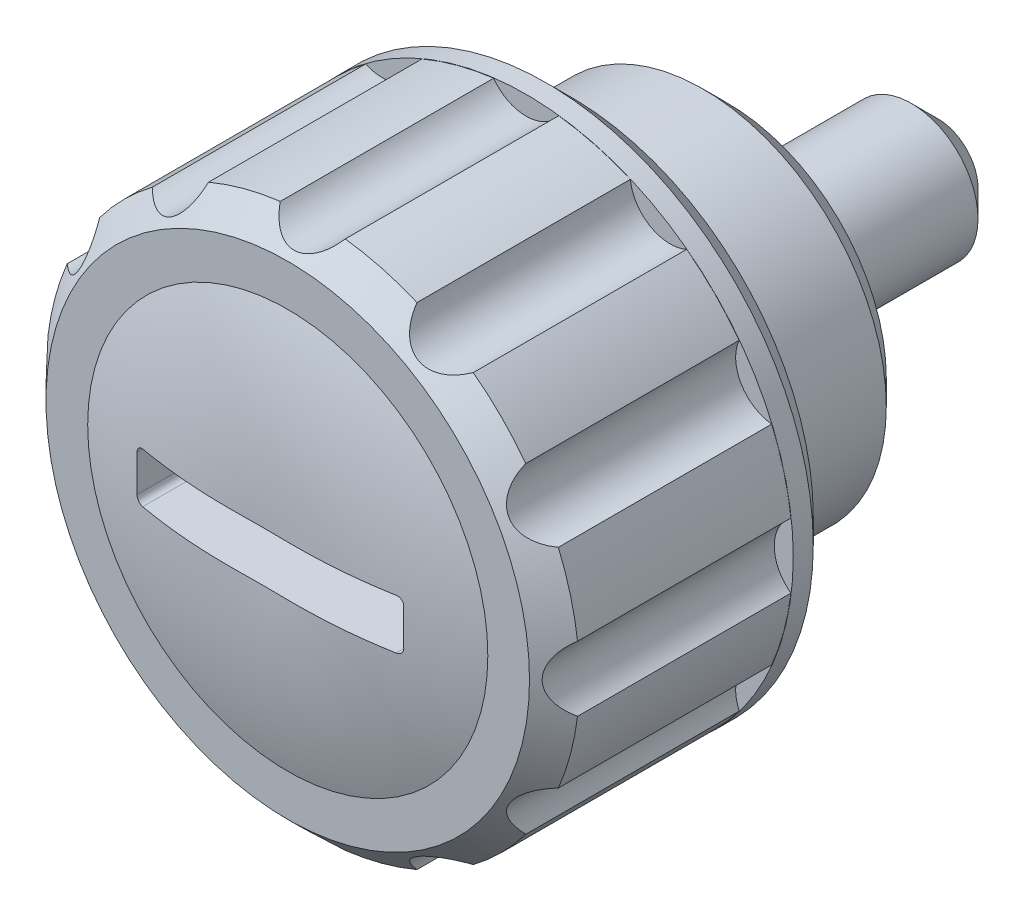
ISO-10303-21;
HEADER;
FILE_DESCRIPTION(('STEP AP214'),'2;1');
FILE_NAME('part.step','',(''),(''),'','','');
FILE_SCHEMA(('AUTOMOTIVE_DESIGN { 1 0 10303 214 1 1 1 1 }'));
ENDSEC;
DATA;
#1=APPLICATION_CONTEXT('core data for automotive mechanical design processes');
#2=APPLICATION_PROTOCOL_DEFINITION('international standard','automotive_design',2000,#1);
#3=PRODUCT_CONTEXT('',#1,'mechanical');
#4=PRODUCT('Part','Part','',(#3));
#5=PRODUCT_RELATED_PRODUCT_CATEGORY('part','',(#4));
#6=PRODUCT_DEFINITION_FORMATION('','',#4);
#7=PRODUCT_DEFINITION_CONTEXT('part definition',#1,'design');
#8=PRODUCT_DEFINITION('design','',#6,#7);
#9=PRODUCT_DEFINITION_SHAPE('','',#8);
#10=(LENGTH_UNIT() NAMED_UNIT(*) SI_UNIT(.MILLI.,.METRE.));
#11=(NAMED_UNIT(*) PLANE_ANGLE_UNIT() SI_UNIT($,.RADIAN.));
#12=(NAMED_UNIT(*) SI_UNIT($,.STERADIAN.) SOLID_ANGLE_UNIT());
#13=UNCERTAINTY_MEASURE_WITH_UNIT(LENGTH_MEASURE(1.E-05),#10,'distance_accuracy_value','');
#14=(GEOMETRIC_REPRESENTATION_CONTEXT(3) GLOBAL_UNCERTAINTY_ASSIGNED_CONTEXT((#13)) GLOBAL_UNIT_ASSIGNED_CONTEXT((#10,
#11,#12)) REPRESENTATION_CONTEXT('',''));
#15=CARTESIAN_POINT('',(0.,0.,0.));
#16=DIRECTION('',(0.,0.,1.));
#17=DIRECTION('',(1.,0.,0.));
#18=AXIS2_PLACEMENT_3D('',#15,#16,#17);
#19=CARTESIAN_POINT('',(0.,0.,-0.703698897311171));
#20=DIRECTION('',(0.,0.,1.));
#21=DIRECTION('',(1.,0.,0.));
#22=AXIS2_PLACEMENT_3D('',#19,#20,#21);
#23=DEGENERATE_TOROIDAL_SURFACE('',#22,1.1776626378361,15.,.T.);
#24=CARTESIAN_POINT('',(0.,0.,13.5));
#25=DIRECTION('',(0.,0.,1.));
#26=DIRECTION('',(1.,0.,0.));
#27=AXIS2_PLACEMENT_3D('',#24,#25,#26);
#28=CIRCLE('',#27,6.);
#29=CARTESIAN_POINT('',(6.,0.,13.5));
#30=VERTEX_POINT('',#29);
#31=EDGE_CURVE('E420',#30,#30,#28,.T.);
#32=ORIENTED_EDGE('',*,*,#31,.T.);
#33=EDGE_LOOP('',(#32));
#34=FACE_BOUND('',#33,.T.);
#35=CARTESIAN_POINT('',(-3.7998,-0.749999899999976,14.0521326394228));
#36=CARTESIAN_POINT('',(-3.81114880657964,-0.750020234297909,14.0500982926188));
#37=CARTESIAN_POINT('',(-3.82250108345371,-0.749057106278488,14.0480843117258));
#38=CARTESIAN_POINT('',(-3.84489426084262,-0.745224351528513,14.0441543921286));
#39=CARTESIAN_POINT('',(-3.85593522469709,-0.742355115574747,14.0422384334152));
#40=CARTESIAN_POINT('',(-3.87740011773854,-0.734767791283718,14.0385596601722));
#41=CARTESIAN_POINT('',(-3.88782359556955,-0.730048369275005,14.0367969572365));
#42=CARTESIAN_POINT('',(-3.90773653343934,-0.718887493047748,14.0334807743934));
#43=CARTESIAN_POINT('',(-3.91722631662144,-0.712446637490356,14.0319272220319));
#44=CARTESIAN_POINT('',(-3.93490505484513,-0.698084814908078,14.0290917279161));
#45=CARTESIAN_POINT('',(-3.9431055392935,-0.690178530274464,14.027807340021));
#46=CARTESIAN_POINT('',(-3.95806529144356,-0.673063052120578,14.025533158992));
#47=CARTESIAN_POINT('',(-3.96482436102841,-0.663853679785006,14.0245434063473));
#48=CARTESIAN_POINT('',(-3.97659283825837,-0.644555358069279,14.0229052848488));
#49=CARTESIAN_POINT('',(-3.98162854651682,-0.634482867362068,14.0222516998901));
#50=CARTESIAN_POINT('',(-3.98994131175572,-0.613624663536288,14.0212843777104));
#51=CARTESIAN_POINT('',(-3.99321964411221,-0.602839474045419,14.0209703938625));
#52=CARTESIAN_POINT('',(-3.99704991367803,-0.584948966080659,14.0207435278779));
#53=CARTESIAN_POINT('',(-3.99816189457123,-0.577959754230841,14.0207251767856));
#54=CARTESIAN_POINT('',(-3.99964030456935,-0.563913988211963,14.0208265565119));
#55=CARTESIAN_POINT('',(-4.00000779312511,-0.556857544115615,14.0209460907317));
#56=CARTESIAN_POINT('',(-3.9999999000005,-0.549800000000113,14.0211342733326));
#57=B_SPLINE_CURVE_WITH_KNOTS('',3,(#35,#36,#37,#38,#39,#40,#41,#42,#43,#44,#45,#46,#47,#48,#49,
#50,#51,#52,#53,#54,#55,#56),.UNSPECIFIED.,.F.,.F.,(4,2,2,2,2,2,2,2,2,2,4),(0.,
0.0345466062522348,0.0690861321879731,0.103650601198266,0.138203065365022,0.172426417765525,
0.206654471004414,0.240334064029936,0.273989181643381,0.295182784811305,0.316346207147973),.UNSPECIFIED.);
#58=CARTESIAN_POINT('',(-3.8,-0.75,14.0520967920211));
#59=VERTEX_POINT('',#58);
#60=CARTESIAN_POINT('',(-4.,-0.55,14.02112896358));
#61=VERTEX_POINT('',#60);
#62=EDGE_CURVE('E531',#59,#61,#57,.T.);
#63=ORIENTED_EDGE('',*,*,#62,.T.);
#64=CARTESIAN_POINT('',(-4.,0.,14.028388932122));
#65=CARTESIAN_POINT('',(-4.,0.339153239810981,14.0283961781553));
#66=CARTESIAN_POINT('',(-4.,0.678323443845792,14.0201840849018));
#67=CARTESIAN_POINT('',(-4.,1.35574448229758,13.9866878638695));
#68=CARTESIAN_POINT('',(-4.,1.69399552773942,13.9614080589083));
#69=CARTESIAN_POINT('',(-4.,2.36814839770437,13.8923714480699));
#70=CARTESIAN_POINT('',(-4.,2.7040529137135,13.8486414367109));
#71=CARTESIAN_POINT('',(-4.,3.37274568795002,13.7413643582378));
#72=CARTESIAN_POINT('',(-4.,3.70553346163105,13.6778142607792));
#73=CARTESIAN_POINT('',(-4.,4.45788889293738,13.5095576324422));
#74=CARTESIAN_POINT('',(-4.,4.87602372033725,13.3983308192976));
#75=CARTESIAN_POINT('',(-4.,5.70161656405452,13.1413580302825));
#76=CARTESIAN_POINT('',(-4.,6.10907328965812,12.9956079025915));
#77=CARTESIAN_POINT('',(-4.,6.91043852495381,12.6696375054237));
#78=CARTESIAN_POINT('',(-4.,7.30433371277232,12.4893844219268));
#79=CARTESIAN_POINT('',(-4.,8.07498519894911,12.0953512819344));
#80=CARTESIAN_POINT('',(-4.,8.45174183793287,11.8815718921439));
#81=CARTESIAN_POINT('',(-4.,9.18281763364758,11.4232419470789));
#82=CARTESIAN_POINT('',(-4.,9.53726091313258,11.1788894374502));
#83=CARTESIAN_POINT('',(-4.,10.2233955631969,10.6600773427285));
#84=CARTESIAN_POINT('',(-4.,10.5550867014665,10.3856174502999));
#85=CARTESIAN_POINT('',(-4.,11.1930381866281,9.8086212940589));
#86=CARTESIAN_POINT('',(-4.,11.4993002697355,9.50608695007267));
#87=CARTESIAN_POINT('',(-4.,12.0839658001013,8.87520844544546));
#88=CARTESIAN_POINT('',(-4.,12.3623701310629,8.54686510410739));
#89=CARTESIAN_POINT('',(-4.,12.8784698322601,7.8806109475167));
#90=CARTESIAN_POINT('',(-4.,13.1173543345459,7.54362037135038));
#91=CARTESIAN_POINT('',(-4.,13.5656684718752,6.85059247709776));
#92=CARTESIAN_POINT('',(-4.,13.7750989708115,6.49455571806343));
#93=CARTESIAN_POINT('',(-4.,14.1629376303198,5.76604322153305));
#94=CARTESIAN_POINT('',(-4.,14.3413507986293,5.39357014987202));
#95=CARTESIAN_POINT('',(-4.,14.6658865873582,4.63480988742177));
#96=CARTESIAN_POINT('',(-4.,14.8120091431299,4.24852266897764));
#97=CARTESIAN_POINT('',(-4.,15.0699099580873,3.46788913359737));
#98=CARTESIAN_POINT('',(-4.,15.1819394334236,3.07362578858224));
#99=CARTESIAN_POINT('',(-4.,15.3723250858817,2.2770527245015));
#100=CARTESIAN_POINT('',(-4.,15.4506814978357,1.87474306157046));
#101=CARTESIAN_POINT('',(-4.,15.5731575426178,1.06492658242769));
#102=CARTESIAN_POINT('',(-4.,15.617275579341,0.657419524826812));
#103=CARTESIAN_POINT('',(-4.,15.6709496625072,-0.159864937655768));
#104=CARTESIAN_POINT('',(-4.,15.6805056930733,-0.569642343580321));
#105=CARTESIAN_POINT('',(-4.,15.665001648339,-1.38774900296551));
#106=CARTESIAN_POINT('',(-4.,15.6400084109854,-1.7960795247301));
#107=CARTESIAN_POINT('',(-4.,15.5557048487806,-2.60918184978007));
#108=CARTESIAN_POINT('',(-4.,15.4963945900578,-3.01395365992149));
#109=CARTESIAN_POINT('',(-4.,15.3438918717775,-3.8170229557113));
#110=CARTESIAN_POINT('',(-4.,15.2507026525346,-4.21532105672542));
#111=CARTESIAN_POINT('',(-4.,15.0311128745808,-5.00265431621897));
#112=CARTESIAN_POINT('',(-4.,14.9047123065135,-5.39168947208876));
#113=CARTESIAN_POINT('',(-4.,14.619619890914,-6.15771427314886));
#114=CARTESIAN_POINT('',(-4.,14.4609300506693,-6.53470466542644));
#115=CARTESIAN_POINT('',(-4.,14.112398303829,-7.27399825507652));
#116=CARTESIAN_POINT('',(-4.,13.9225564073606,-7.63630145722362));
#117=CARTESIAN_POINT('',(-4.,13.5130367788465,-8.34375702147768));
#118=CARTESIAN_POINT('',(-4.,13.2933514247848,-8.68890497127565));
#119=CARTESIAN_POINT('',(-4.,12.825767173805,-9.35952806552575));
#120=CARTESIAN_POINT('',(-4.,12.5778682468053,-9.68500318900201));
#121=CARTESIAN_POINT('',(-4.,12.0550681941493,-10.3147088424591));
#122=CARTESIAN_POINT('',(-4.,11.7801085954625,-10.6188908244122));
#123=CARTESIAN_POINT('',(-4.,11.2056412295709,-11.2031141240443));
#124=CARTESIAN_POINT('',(-4.,10.9061334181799,-11.4831553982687));
#125=CARTESIAN_POINT('',(-4.,10.2849635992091,-12.0170071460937));
#126=CARTESIAN_POINT('',(-4.,9.96331753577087,-12.2708361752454));
#127=CARTESIAN_POINT('',(-4.,9.30001359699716,-12.7508263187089));
#128=CARTESIAN_POINT('',(-4.,8.95835585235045,-12.9769876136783));
#129=CARTESIAN_POINT('',(-4.,8.25506085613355,-13.4017235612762));
#130=CARTESIAN_POINT('',(-4.,7.89330122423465,-13.6000955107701));
#131=CARTESIAN_POINT('',(-4.,7.1546361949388,-13.9662854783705));
#132=CARTESIAN_POINT('',(-4.,6.77773047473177,-14.1341028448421));
#133=CARTESIAN_POINT('',(-4.,6.01113338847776,-14.4386630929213));
#134=CARTESIAN_POINT('',(-4.,5.62142902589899,-14.5753731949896));
#135=CARTESIAN_POINT('',(-4.,4.83241304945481,-14.817363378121));
#136=CARTESIAN_POINT('',(-4.,4.4331021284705,-14.9226457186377));
#137=CARTESIAN_POINT('',(-4.,3.77164652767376,-15.0703302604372));
#138=CARTESIAN_POINT('',(-4.,3.51147362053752,-15.1217585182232));
#139=CARTESIAN_POINT('',(-4.,2.98899804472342,-15.2123395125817));
#140=CARTESIAN_POINT('',(-4.,2.7266952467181,-15.2514914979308));
#141=CARTESIAN_POINT('',(-4.,1.93724201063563,-15.3514509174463));
#142=CARTESIAN_POINT('',(-4.,1.40777675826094,-15.3947116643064));
#143=CARTESIAN_POINT('',(-4.,0.612198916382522,-15.4285188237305));
#144=CARTESIAN_POINT('',(-4.,0.346571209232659,-15.4345998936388));
#145=CARTESIAN_POINT('',(-4.,-0.184756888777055,-15.4366600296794));
#146=CARTESIAN_POINT('',(-4.,-0.450457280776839,-15.4326389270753));
#147=CARTESIAN_POINT('',(-4.,-0.981374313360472,-15.4142959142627));
#148=CARTESIAN_POINT('',(-4.,-1.24659112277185,-15.3999788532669));
#149=CARTESIAN_POINT('',(-4.,-1.7762314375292,-15.3604541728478));
#150=CARTESIAN_POINT('',(-4.,-2.04065492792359,-15.3352463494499));
#151=CARTESIAN_POINT('',(-4.,-2.52470132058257,-15.2783376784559));
#152=CARTESIAN_POINT('',(-4.,-2.74453002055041,-15.248390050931));
#153=CARTESIAN_POINT('',(-4.,-3.18285214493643,-15.1800456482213));
#154=CARTESIAN_POINT('',(-4.,-3.40134562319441,-15.1416492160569));
#155=CARTESIAN_POINT('',(-4.,-4.05419633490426,-15.0133381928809));
#156=CARTESIAN_POINT('',(-4.,-4.48606739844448,-14.9102854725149));
#157=CARTESIAN_POINT('',(-4.,-5.33835432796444,-14.6682914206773));
#158=CARTESIAN_POINT('',(-4.,-5.75879820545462,-14.5294486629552));
#159=CARTESIAN_POINT('',(-4.,-6.58609234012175,-14.2156839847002));
#160=CARTESIAN_POINT('',(-4.,-6.99294114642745,-14.0407582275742));
#161=CARTESIAN_POINT('',(-4.,-7.79138450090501,-13.6547019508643));
#162=CARTESIAN_POINT('',(-4.,-8.18290123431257,-13.4434103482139));
#163=CARTESIAN_POINT('',(-4.,-8.94537896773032,-12.9865110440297));
#164=CARTESIAN_POINT('',(-4.,-9.31634014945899,-12.7409036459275));
#165=CARTESIAN_POINT('',(-4.,-10.0350527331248,-12.2167860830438));
#166=CARTESIAN_POINT('',(-4.,-10.3827705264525,-11.9382298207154));
#167=CARTESIAN_POINT('',(-4.,-11.0514362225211,-11.350662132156));
#168=CARTESIAN_POINT('',(-4.,-11.3723853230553,-11.0416520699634));
#169=CARTESIAN_POINT('',(-4.,-11.9642331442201,-10.4173353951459));
#170=CARTESIAN_POINT('',(-4.,-12.2370447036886,-10.1038391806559));
#171=CARTESIAN_POINT('',(-4.,-12.7549508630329,-9.4547474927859));
#172=CARTESIAN_POINT('',(-4.,-13.0000469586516,-9.11915321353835));
#173=CARTESIAN_POINT('',(-4.,-13.4605522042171,-8.42850547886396));
#174=CARTESIAN_POINT('',(-4.,-13.67598107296,-8.07346517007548));
#175=CARTESIAN_POINT('',(-4.,-14.0757477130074,-7.34628666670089));
#176=CARTESIAN_POINT('',(-4.,-14.2600853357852,-6.97414839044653));
#177=CARTESIAN_POINT('',(-4.,-14.5943069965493,-6.21997693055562));
#178=CARTESIAN_POINT('',(-4.,-14.7445728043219,-5.83811287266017));
#179=CARTESIAN_POINT('',(-4.,-15.0123145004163,-5.06306047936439));
#180=CARTESIAN_POINT('',(-4.,-15.1297907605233,-4.669872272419));
#181=CARTESIAN_POINT('',(-4.,-15.3311166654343,-3.87492033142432));
#182=CARTESIAN_POINT('',(-4.,-15.4149615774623,-3.47315539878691));
#183=CARTESIAN_POINT('',(-4.,-15.5483930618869,-2.66397544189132));
#184=CARTESIAN_POINT('',(-4.,-15.5979796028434,-2.25656041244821));
#185=CARTESIAN_POINT('',(-4.,-15.6624394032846,-1.44020146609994));
#186=CARTESIAN_POINT('',(-4.,-15.6774144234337,-1.03126558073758));
#187=CARTESIAN_POINT('',(-4.,-15.6728420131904,-0.213587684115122));
#188=CARTESIAN_POINT('',(-4.,-15.653294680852,0.19515432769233));
#189=CARTESIAN_POINT('',(-4.,-15.5798200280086,1.00952109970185));
#190=CARTESIAN_POINT('',(-4.,-15.5258939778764,1.41514597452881));
#191=CARTESIAN_POINT('',(-4.,-15.3840519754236,2.22040863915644));
#192=CARTESIAN_POINT('',(-4.,-15.2961360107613,2.62004642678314));
#193=CARTESIAN_POINT('',(-4.,-15.0869932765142,3.41032437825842));
#194=CARTESIAN_POINT('',(-4.,-14.9657808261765,3.8009683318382));
#195=CARTESIAN_POINT('',(-4.,-14.6909025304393,4.57066557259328));
#196=CARTESIAN_POINT('',(-4.,-14.5372367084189,4.94971886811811));
#197=CARTESIAN_POINT('',(-4.,-14.198563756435,5.6935427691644));
#198=CARTESIAN_POINT('',(-4.,-14.0135574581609,6.05831375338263));
#199=CARTESIAN_POINT('',(-4.,-13.6135344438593,6.77101064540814));
#200=CARTESIAN_POINT('',(-4.,-13.3985177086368,7.11893654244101));
#201=CARTESIAN_POINT('',(-4.,-12.9397392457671,7.79592064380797));
#202=CARTESIAN_POINT('',(-4.,-12.695942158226,8.12495488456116));
#203=CARTESIAN_POINT('',(-4.,-12.1815798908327,8.76138756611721));
#204=CARTESIAN_POINT('',(-4.,-11.91101469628,9.068785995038));
#205=CARTESIAN_POINT('',(-4.,-11.3450384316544,9.65985804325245));
#206=CARTESIAN_POINT('',(-4.,-11.049624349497,9.94352877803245));
#207=CARTESIAN_POINT('',(-4.,-10.4361166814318,10.4851767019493));
#208=CARTESIAN_POINT('',(-4.,-10.1180230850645,10.7431538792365));
#209=CARTESIAN_POINT('',(-4.,-9.45975657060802,11.2329803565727));
#210=CARTESIAN_POINT('',(-4.,-9.11947790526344,11.4646875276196));
#211=CARTESIAN_POINT('',(-4.,-8.42081797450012,11.8989645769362));
#212=CARTESIAN_POINT('',(-4.,-8.06243669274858,12.1015344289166));
#213=CARTESIAN_POINT('',(-4.,-7.33043234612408,12.476268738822));
#214=CARTESIAN_POINT('',(-4.,-6.95681985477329,12.6484538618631));
#215=CARTESIAN_POINT('',(-4.,-6.19684574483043,12.961845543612));
#216=CARTESIAN_POINT('',(-4.,-5.81048403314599,13.1030518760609));
#217=CARTESIAN_POINT('',(-4.,-4.98307663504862,13.3686004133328));
#218=CARTESIAN_POINT('',(-4.,-4.54082134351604,13.4891802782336));
#219=CARTESIAN_POINT('',(-4.,-3.64769934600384,13.6923551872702));
#220=CARTESIAN_POINT('',(-4.,-3.19683149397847,13.774945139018));
#221=CARTESIAN_POINT('',(-4.,-2.28933102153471,13.9045907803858));
#222=CARTESIAN_POINT('',(-4.,-1.83269032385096,13.9515893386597));
#223=CARTESIAN_POINT('',(-4.,-1.14623014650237,13.9979727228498));
#224=CARTESIAN_POINT('',(-4.,-0.917138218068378,14.0094147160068));
#225=CARTESIAN_POINT('',(-4.,-0.458700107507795,14.0246202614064));
#226=CARTESIAN_POINT('',(-4.,-0.229353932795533,14.0283840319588));
#227=CARTESIAN_POINT('',(-4.,0.,14.028388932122));
#228=B_SPLINE_CURVE_WITH_KNOTS('',3,(#64,#65,#66,#67,#68,#69,#70,#71,#72,#73,#74,#75,#76,#77,
#78,#79,#80,#81,#82,#83,#84,#85,#86,#87,#88,#89,#90,#91,#92,#93,#94,#95,#96,#97,#98,#99,#100,
#101,#102,#103,#104,#105,#106,#107,#108,#109,#110,#111,#112,#113,#114,#115,#116,#117,#118,#119,
#120,#121,#122,#123,#124,#125,#126,#127,#128,#129,#130,#131,#132,#133,#134,#135,#136,#137,#138,
#139,#140,#141,#142,#143,#144,#145,#146,#147,#148,#149,#150,#151,#152,#153,#154,#155,#156,#157,
#158,#159,#160,#161,#162,#163,#164,#165,#166,#167,#168,#169,#170,#171,#172,#173,#174,#175,#176,
#177,#178,#179,#180,#181,#182,#183,#184,#185,#186,#187,#188,#189,#190,#191,#192,#193,#194,#195,
#196,#197,#198,#199,#200,#201,#202,#203,#204,#205,#206,#207,#208,#209,#210,#211,#212,#213,#214,
#215,#216,#217,#218,#219,#220,#221,#222,#223,#224,#225,#226,#227),.UNSPECIFIED.,.T.,.F.,(4,2,2,
2,2,2,2,2,2,2,2,2,2,2,2,2,2,2,2,2,2,2,2,2,2,2,2,2,2,2,2,2,2,2,2,2,2,2,2,2,2,2,2,2,2,2,2,2,2,2,2,
2,2,2,2,2,2,2,2,2,2,2,2,2,2,2,2,2,2,2,2,2,2,2,2,2,2,2,2,2,2,4),(0.,1.01738294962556,
2.03450831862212,3.05016161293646,4.06597026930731,5.36249424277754,6.6591742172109,
7.95709358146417,9.25498713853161,10.5448707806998,11.8347675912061,13.1245762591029,
14.4143439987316,15.6520836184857,16.8897869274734,18.1272902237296,19.3647959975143,
20.5929491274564,21.8210936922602,23.0492955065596,24.2774978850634,25.5033275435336,
26.7291548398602,27.9548649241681,29.1805753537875,30.4062096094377,31.6318434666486,
32.8577909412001,34.0837397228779,35.3123982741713,36.5410590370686,37.7688439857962,
38.9966209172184,40.2329329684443,41.4692713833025,42.7069066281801,43.9444528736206,
44.7397910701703,45.5351779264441,47.1266553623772,47.9236225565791,48.7206030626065,
49.5172084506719,50.3138287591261,50.9792441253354,51.6446324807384,52.9749769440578,
54.301695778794,55.6285557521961,56.9614518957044,58.2943362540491,59.6291079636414,
60.9638199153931,62.2090674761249,63.4542478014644,64.6985964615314,65.9429510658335,
67.1725857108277,68.4022064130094,69.6320000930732,70.8617949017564,72.0879693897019,
73.3141403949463,74.5402660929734,75.7663922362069,76.9919919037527,78.2175906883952,
79.4431569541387,80.6687240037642,81.8958127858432,83.1229022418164,84.3501406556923,
85.5773796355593,86.8109699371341,88.0445613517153,89.2773105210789,90.510068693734,
91.8834796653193,93.2570746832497,94.632869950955,95.3208993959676,96.0089092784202),.UNSPECIFIED.);
#229=CARTESIAN_POINT('',(-4.,0.55,14.02112896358));
#230=VERTEX_POINT('',#229);
#231=EDGE_CURVE('E230',#61,#230,#228,.T.);
#232=ORIENTED_EDGE('',*,*,#231,.T.);
#233=CARTESIAN_POINT('',(-3.99999989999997,0.5498,14.0211342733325));
#234=CARTESIAN_POINT('',(-4.00002120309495,0.560882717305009,14.0208370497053));
#235=CARTESIAN_POINT('',(-3.99910147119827,0.571967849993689,14.0207119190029));
#236=CARTESIAN_POINT('',(-3.99545102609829,0.59382219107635,14.0208010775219));
#237=CARTESIAN_POINT('',(-3.99272233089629,0.604591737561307,14.021014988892));
#238=CARTESIAN_POINT('',(-3.98552323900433,0.625524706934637,14.0217769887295));
#239=CARTESIAN_POINT('',(-3.98105209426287,0.635687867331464,14.0223252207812));
#240=CARTESIAN_POINT('',(-3.97050578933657,0.655118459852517,14.0237373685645));
#241=CARTESIAN_POINT('',(-3.96443078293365,0.664385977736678,14.0246012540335));
#242=CARTESIAN_POINT('',(-3.95082544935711,0.681812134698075,14.0266217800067));
#243=CARTESIAN_POINT('',(-3.94328885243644,0.689965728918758,14.0277796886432));
#244=CARTESIAN_POINT('',(-3.92699598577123,0.704900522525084,14.030350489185));
#245=CARTESIAN_POINT('',(-3.91823946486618,0.711681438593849,14.0317634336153));
#246=CARTESIAN_POINT('',(-3.89962640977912,0.723780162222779,14.0348229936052));
#247=CARTESIAN_POINT('',(-3.88975612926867,0.729076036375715,14.0364726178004));
#248=CARTESIAN_POINT('',(-3.86929754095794,0.737941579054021,14.0399411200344));
#249=CARTESIAN_POINT('',(-3.858709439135,0.741511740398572,14.0417599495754));
#250=CARTESIAN_POINT('',(-3.84003688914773,0.746119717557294,14.0450054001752));
#251=CARTESIAN_POINT('',(-3.83204943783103,0.747581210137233,14.046405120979));
#252=CARTESIAN_POINT('',(-3.8159747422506,0.749525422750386,14.0492439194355));
#253=CARTESIAN_POINT('',(-3.80788765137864,0.750009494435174,14.0506829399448));
#254=CARTESIAN_POINT('',(-3.79980000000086,0.749999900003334,14.052132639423));
#255=B_SPLINE_CURVE_WITH_KNOTS('',3,(#233,#234,#235,#236,#237,#238,#239,#240,#241,#242,#243,
#244,#245,#246,#247,#248,#249,#250,#251,#252,#253,#254),.UNSPECIFIED.,.F.,.F.,(4,2,2,2,2,2,2,2,
2,2,4),(0.,0.0332152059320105,0.0663934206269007,0.0995858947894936,0.132775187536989,
0.166110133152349,0.199451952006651,0.233262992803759,0.267064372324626,0.291727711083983,
0.316356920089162),.UNSPECIFIED.);
#256=CARTESIAN_POINT('',(-3.79999999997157,0.75,14.0520967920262));
#257=VERTEX_POINT('',#256);
#258=EDGE_CURVE('E485',#230,#257,#255,.T.);
#259=ORIENTED_EDGE('',*,*,#258,.T.);
#260=CARTESIAN_POINT('',(0.,0.75,14.2902033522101));
#261=CARTESIAN_POINT('',(0.062509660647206,0.75,14.2902036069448));
#262=CARTESIAN_POINT('',(0.125019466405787,0.75,14.2904360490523));
#263=CARTESIAN_POINT('',(0.250036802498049,0.75,14.291252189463));
#264=CARTESIAN_POINT('',(0.312544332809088,0.75,14.2918358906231));
#265=CARTESIAN_POINT('',(0.437565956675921,0.75,14.2930988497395));
#266=CARTESIAN_POINT('',(0.500080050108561,0.75,14.2937781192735));
#267=CARTESIAN_POINT('',(0.625113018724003,0.75,14.2949804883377));
#268=CARTESIAN_POINT('',(0.687631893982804,0.75,14.2955035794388));
#269=CARTESIAN_POINT('',(0.875766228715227,0.75,14.2965328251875));
#270=CARTESIAN_POINT('',(1.00138686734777,0.75,14.2964891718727));
#271=CARTESIAN_POINT('',(1.25260493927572,0.75,14.2940460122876));
#272=CARTESIAN_POINT('',(1.37820237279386,0.75,14.2916465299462));
#273=CARTESIAN_POINT('',(1.75485708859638,0.75,14.2803277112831));
#274=CARTESIAN_POINT('',(2.00580900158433,0.75,14.2672884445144));
#275=CARTESIAN_POINT('',(2.50689880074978,0.75,14.2291477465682));
#276=CARTESIAN_POINT('',(2.75703633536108,0.75,14.2040416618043));
#277=CARTESIAN_POINT('',(3.25583549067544,0.75,14.1415504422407));
#278=CARTESIAN_POINT('',(3.5044966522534,0.75,14.1041616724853));
#279=CARTESIAN_POINT('',(4.16871083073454,0.75,13.9873107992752));
#280=CARTESIAN_POINT('',(4.58233519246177,0.75,13.8965497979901));
#281=CARTESIAN_POINT('',(5.40052634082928,0.75,13.6805066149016));
#282=CARTESIAN_POINT('',(5.80509101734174,0.75,13.5552164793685));
#283=CARTESIAN_POINT('',(6.60293944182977,0.75,13.2706758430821));
#284=CARTESIAN_POINT('',(6.99620137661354,0.75,13.1113641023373));
#285=CARTESIAN_POINT('',(7.76780860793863,0.75,12.760031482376));
#286=CARTESIAN_POINT('',(8.14615456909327,0.75,12.5680120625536));
#287=CARTESIAN_POINT('',(8.88446706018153,0.75,12.1530468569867));
#288=CARTESIAN_POINT('',(9.2444697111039,0.75,11.9301653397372));
#289=CARTESIAN_POINT('',(9.9443450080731,0.75,11.4547620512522));
#290=CARTESIAN_POINT('',(10.2842175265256,0.75,11.2022400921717));
#291=CARTESIAN_POINT('',(10.9411846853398,0.75,10.6695279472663));
#292=CARTESIAN_POINT('',(11.2582935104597,0.75,10.3893552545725));
#293=CARTESIAN_POINT('',(11.867695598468,0.75,9.80321084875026));
#294=CARTESIAN_POINT('',(12.1599889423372,0.75,9.49723921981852));
#295=CARTESIAN_POINT('',(12.7167806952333,0.75,8.86269415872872));
#296=CARTESIAN_POINT('',(12.9813643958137,0.75,8.53419556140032));
#297=CARTESIAN_POINT('',(13.4819097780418,0.75,7.85607214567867));
#298=CARTESIAN_POINT('',(13.7178715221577,0.75,7.50644737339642));
#299=CARTESIAN_POINT('',(14.1595322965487,0.75,6.78849443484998));
#300=CARTESIAN_POINT('',(14.3652260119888,0.75,6.42016299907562));
#301=CARTESIAN_POINT('',(14.7448367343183,0.75,5.66747355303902));
#302=CARTESIAN_POINT('',(14.9187537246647,0.75,5.28311553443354));
#303=CARTESIAN_POINT('',(15.2335050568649,0.75,4.50127546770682));
#304=CARTESIAN_POINT('',(15.3743535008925,0.75,4.10379909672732));
#305=CARTESIAN_POINT('',(15.6220611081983,0.75,3.29839291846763));
#306=CARTESIAN_POINT('',(15.7289202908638,0.75,2.89046311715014));
#307=CARTESIAN_POINT('',(15.9078821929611,0.75,2.06708280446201));
#308=CARTESIAN_POINT('',(15.9799876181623,0.75,1.65163288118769));
#309=CARTESIAN_POINT('',(16.0889414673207,0.75,0.816135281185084));
#310=CARTESIAN_POINT('',(16.1257898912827,0.75,0.396087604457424));
#311=CARTESIAN_POINT('',(16.163965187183,0.75,-0.445565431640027));
#312=CARTESIAN_POINT('',(16.1652965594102,0.75,-0.867170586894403));
#313=CARTESIAN_POINT('',(16.1324397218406,0.75,-1.7089944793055));
#314=CARTESIAN_POINT('',(16.0982515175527,0.75,-2.12921321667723));
#315=CARTESIAN_POINT('',(15.994590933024,0.75,-2.96533956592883));
#316=CARTESIAN_POINT('',(15.9251132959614,0.75,-3.38124652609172));
#317=CARTESIAN_POINT('',(15.751365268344,0.75,-4.20572862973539));
#318=CARTESIAN_POINT('',(15.6470948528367,0.75,-4.61430376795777));
#319=CARTESIAN_POINT('',(15.4044819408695,0.75,-5.42128714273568));
#320=CARTESIAN_POINT('',(15.2661335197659,0.75,-5.8196935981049));
#321=CARTESIAN_POINT('',(14.9563586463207,0.75,-6.6034316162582));
#322=CARTESIAN_POINT('',(14.7849322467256,0.75,-6.9887631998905));
#323=CARTESIAN_POINT('',(14.410318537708,0.75,-7.74341593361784));
#324=CARTESIAN_POINT('',(14.2071477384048,0.75,-8.11274527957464));
#325=CARTESIAN_POINT('',(13.7704245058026,0.75,-8.83298393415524));
#326=CARTESIAN_POINT('',(13.5368719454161,0.75,-9.18389316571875));
#327=CARTESIAN_POINT('',(13.0411762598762,0.75,-9.86461934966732));
#328=CARTESIAN_POINT('',(12.7790481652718,0.75,-10.1944472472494));
#329=CARTESIAN_POINT('',(12.2279683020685,0.75,-10.8308662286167));
#330=CARTESIAN_POINT('',(11.9390170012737,0.75,-11.1374577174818));
#331=CARTESIAN_POINT('',(11.3358371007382,0.75,-11.7257264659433));
#332=CARTESIAN_POINT('',(11.0215672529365,0.75,-12.0073614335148));
#333=CARTESIAN_POINT('',(10.3703891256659,0.75,-12.5431585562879));
#334=CARTESIAN_POINT('',(10.0334794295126,0.75,-12.7973189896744));
#335=CARTESIAN_POINT('',(9.33882156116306,0.75,-13.2767706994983));
#336=CARTESIAN_POINT('',(8.98103735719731,0.75,-13.5020097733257));
#337=CARTESIAN_POINT('',(8.24780759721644,0.75,-13.9214489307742));
#338=CARTESIAN_POINT('',(7.87236542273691,0.75,-14.1156549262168));
#339=CARTESIAN_POINT('',(7.10830459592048,0.75,-14.4708441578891));
#340=CARTESIAN_POINT('',(6.71975907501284,0.75,-14.6319846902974));
#341=CARTESIAN_POINT('',(5.93032689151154,0.75,-14.9212008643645));
#342=CARTESIAN_POINT('',(5.52943355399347,0.75,-15.049258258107));
#343=CARTESIAN_POINT('',(4.71037120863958,0.75,-15.2735305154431));
#344=CARTESIAN_POINT('',(4.29201779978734,0.75,-15.3690765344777));
#345=CARTESIAN_POINT('',(3.65997311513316,0.75,-15.485449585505));
#346=CARTESIAN_POINT('',(3.44867138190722,0.75,-15.5197366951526));
#347=CARTESIAN_POINT('',(3.02478880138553,0.75,-15.5793924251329));
#348=CARTESIAN_POINT('',(2.81220789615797,0.75,-15.6047606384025));
#349=CARTESIAN_POINT('',(2.38452719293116,0.75,-15.6468286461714));
#350=CARTESIAN_POINT('',(2.16942066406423,0.75,-15.6634594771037));
#351=CARTESIAN_POINT('',(1.73875062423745,0.75,-15.6880212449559));
#352=CARTESIAN_POINT('',(1.5231871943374,0.75,-15.6959536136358));
#353=CARTESIAN_POINT('',(1.19954465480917,0.75,-15.7021388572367));
#354=CARTESIAN_POINT('',(1.09150789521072,0.75,-15.7032466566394));
#355=CARTESIAN_POINT('',(0.875426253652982,0.75,-15.7039178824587));
#356=CARTESIAN_POINT('',(0.767381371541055,0.75,-15.7034812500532));
#357=CARTESIAN_POINT('',(0.551281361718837,0.75,-15.7017790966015));
#358=CARTESIAN_POINT('',(0.443226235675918,0.75,-15.7005134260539));
#359=CARTESIAN_POINT('',(0.281143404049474,0.75,-15.6989476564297));
#360=CARTESIAN_POINT('',(0.227117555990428,0.75,-15.698481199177));
#361=CARTESIAN_POINT('',(0.119064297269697,0.75,-15.6978197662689));
#362=CARTESIAN_POINT('',(0.0650368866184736,0.75,-15.6976247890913));
#363=CARTESIAN_POINT('',(-0.05800398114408,0.75,-15.6975761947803));
#364=CARTESIAN_POINT('',(-0.127017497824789,0.75,-15.6978322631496));
#365=CARTESIAN_POINT('',(-0.265042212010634,0.75,-15.6987649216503));
#366=CARTESIAN_POINT('',(-0.334053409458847,0.75,-15.6994415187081));
#367=CARTESIAN_POINT('',(-0.47207998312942,0.75,-15.7008610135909));
#368=CARTESIAN_POINT('',(-0.541095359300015,0.75,-15.7016039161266));
#369=CARTESIAN_POINT('',(-0.679127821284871,0.75,-15.7028300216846));
#370=CARTESIAN_POINT('',(-0.748144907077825,0.75,-15.7033132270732));
#371=CARTESIAN_POINT('',(-0.955164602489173,0.75,-15.7040009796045));
#372=CARTESIAN_POINT('',(-1.0931724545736,0.75,-15.7034443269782));
#373=CARTESIAN_POINT('',(-1.36914222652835,0.75,-15.6993084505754));
#374=CARTESIAN_POINT('',(-1.50710414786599,0.75,-15.6957293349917));
#375=CARTESIAN_POINT('',(-1.78256534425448,0.75,-15.685188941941));
#376=CARTESIAN_POINT('',(-1.92006492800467,0.75,-15.6782359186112));
#377=CARTESIAN_POINT('',(-2.19483905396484,0.75,-15.6607772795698));
#378=CARTESIAN_POINT('',(-2.33211359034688,0.75,-15.6502715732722));
#379=CARTESIAN_POINT('',(-2.743559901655,0.75,-15.6132836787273));
#380=CARTESIAN_POINT('',(-3.01726339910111,0.75,-15.581334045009));
#381=CARTESIAN_POINT('',(-3.55992465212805,0.75,-15.5030144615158));
#382=CARTESIAN_POINT('',(-3.82890277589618,0.75,-15.4567848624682));
#383=CARTESIAN_POINT('',(-4.36392755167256,0.75,-15.3498484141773));
#384=CARTESIAN_POINT('',(-4.62997463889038,0.75,-15.2891437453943));
#385=CARTESIAN_POINT('',(-5.15895710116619,0.75,-15.1532282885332));
#386=CARTESIAN_POINT('',(-5.42188447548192,0.75,-15.0779863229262));
#387=CARTESIAN_POINT('',(-5.94322863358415,0.75,-14.9132881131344));
#388=CARTESIAN_POINT('',(-6.20164546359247,0.75,-14.8238320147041));
#389=CARTESIAN_POINT('',(-6.85115229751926,0.75,-14.5789290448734));
#390=CARTESIAN_POINT('',(-7.23867684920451,0.75,-14.4139021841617));
#391=CARTESIAN_POINT('',(-7.99805018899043,0.75,-14.0520702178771));
#392=CARTESIAN_POINT('',(-8.36991500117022,0.75,-13.8552986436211));
#393=CARTESIAN_POINT('',(-9.09777056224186,0.75,-13.4300705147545));
#394=CARTESIAN_POINT('',(-9.45366504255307,0.75,-13.2014490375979));
#395=CARTESIAN_POINT('',(-10.1449857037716,0.75,-12.714880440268));
#396=CARTESIAN_POINT('',(-10.4804049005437,0.75,-12.4569233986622));
#397=CARTESIAN_POINT('',(-11.1277254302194,0.75,-11.9140206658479));
#398=CARTESIAN_POINT('',(-11.4396635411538,0.75,-11.6291188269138));
#399=CARTESIAN_POINT('',(-12.0383542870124,0.75,-11.0340393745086));
#400=CARTESIAN_POINT('',(-12.3251095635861,0.75,-10.7238644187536));
#401=CARTESIAN_POINT('',(-12.870898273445,0.75,-10.0810426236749));
#402=CARTESIAN_POINT('',(-13.1299839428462,0.75,-9.74844013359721));
#403=CARTESIAN_POINT('',(-13.619228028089,0.75,-9.06258526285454));
#404=CARTESIAN_POINT('',(-13.8493856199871,0.75,-8.70933229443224));
#405=CARTESIAN_POINT('',(-14.2791137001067,0.75,-7.98471878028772));
#406=CARTESIAN_POINT('',(-14.4786861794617,0.75,-7.61335941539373));
#407=CARTESIAN_POINT('',(-14.8458413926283,0.75,-6.85515348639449));
#408=CARTESIAN_POINT('',(-15.0134243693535,0.75,-6.46830703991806));
#409=CARTESIAN_POINT('',(-15.3155070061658,0.75,-5.6816225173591));
#410=CARTESIAN_POINT('',(-15.4499855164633,0.75,-5.2817763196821));
#411=CARTESIAN_POINT('',(-15.6847633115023,0.75,-4.47217121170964));
#412=CARTESIAN_POINT('',(-15.7850625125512,0.75,-4.06241227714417));
#413=CARTESIAN_POINT('',(-15.9507352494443,0.75,-3.23605764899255));
#414=CARTESIAN_POINT('',(-16.0161221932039,0.75,-2.81946464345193));
#415=CARTESIAN_POINT('',(-16.1115638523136,0.75,-1.98225120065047));
#416=CARTESIAN_POINT('',(-16.1416186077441,0.75,-1.56163076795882));
#417=CARTESIAN_POINT('',(-16.1661796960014,0.75,-0.719438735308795));
#418=CARTESIAN_POINT('',(-16.1606932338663,0.75,-0.297867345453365));
#419=CARTESIAN_POINT('',(-16.114227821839,0.75,0.543314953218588));
#420=CARTESIAN_POINT('',(-16.0732488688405,0.75,0.962925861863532));
#421=CARTESIAN_POINT('',(-15.9560905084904,0.75,1.79720001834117));
#422=CARTESIAN_POINT('',(-15.8799114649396,0.75,2.21186331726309));
#423=CARTESIAN_POINT('',(-15.6928948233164,0.75,3.03329916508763));
#424=CARTESIAN_POINT('',(-15.582057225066,0.75,3.44007171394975));
#425=CARTESIAN_POINT('',(-15.3264932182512,0.75,4.24289288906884));
#426=CARTESIAN_POINT('',(-15.181761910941,0.75,4.63893995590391));
#427=CARTESIAN_POINT('',(-14.8594487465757,0.75,5.41743335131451));
#428=CARTESIAN_POINT('',(-14.68186687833,0.75,5.79987967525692));
#429=CARTESIAN_POINT('',(-14.2950896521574,0.75,6.54850360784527));
#430=CARTESIAN_POINT('',(-14.0858900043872,0.75,6.91467900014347));
#431=CARTESIAN_POINT('',(-13.6373836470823,0.75,7.62810226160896));
#432=CARTESIAN_POINT('',(-13.3980769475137,0.75,7.97535013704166));
#433=CARTESIAN_POINT('',(-12.8911539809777,0.75,8.64832469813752));
#434=CARTESIAN_POINT('',(-12.6235482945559,0.75,8.97405935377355));
#435=CARTESIAN_POINT('',(-12.0618570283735,0.75,9.60183607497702));
#436=CARTESIAN_POINT('',(-11.767771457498,0.75,9.9038781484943));
#437=CARTESIAN_POINT('',(-11.1552973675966,0.75,10.4820455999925));
#438=CARTESIAN_POINT('',(-10.8369156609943,0.75,10.758178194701));
#439=CARTESIAN_POINT('',(-10.1780402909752,0.75,11.2826657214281));
#440=CARTESIAN_POINT('',(-9.83754661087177,0.75,11.5310206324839));
#441=CARTESIAN_POINT('',(-9.13645925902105,0.75,11.9984683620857));
#442=CARTESIAN_POINT('',(-8.775842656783,0.75,12.2175267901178));
#443=CARTESIAN_POINT('',(-8.03744530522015,0.75,12.6244922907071));
#444=CARTESIAN_POINT('',(-7.65966465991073,0.75,12.8123995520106));
#445=CARTESIAN_POINT('',(-6.88907462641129,0.75,13.1559939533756));
#446=CARTESIAN_POINT('',(-6.49624456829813,0.75,13.3116347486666));
#447=CARTESIAN_POINT('',(-5.69887180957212,0.75,13.589295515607));
#448=CARTESIAN_POINT('',(-5.29432853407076,0.75,13.7113138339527));
#449=CARTESIAN_POINT('',(-4.47763909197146,0.75,13.9206164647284));
#450=CARTESIAN_POINT('',(-4.06552036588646,0.75,14.0080072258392));
#451=CARTESIAN_POINT('',(-3.44313498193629,0.75,14.1131515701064));
#452=CARTESIAN_POINT('',(-3.2349769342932,0.75,14.1438756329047));
#453=CARTESIAN_POINT('',(-2.81757605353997,0.75,14.1967187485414));
#454=CARTESIAN_POINT('',(-2.60833331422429,0.75,14.2188385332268));
#455=CARTESIAN_POINT('',(-2.19967651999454,0.75,14.2537079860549));
#456=CARTESIAN_POINT('',(-2.00029743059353,0.75,14.2668729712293));
#457=CARTESIAN_POINT('',(-1.60124974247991,0.75,14.2858621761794));
#458=CARTESIAN_POINT('',(-1.40158124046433,0.75,14.291688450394));
#459=CARTESIAN_POINT('',(-1.10202038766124,0.75,14.2957506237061));
#460=CARTESIAN_POINT('',(-1.00214989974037,0.75,14.2963250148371));
#461=CARTESIAN_POINT('',(-0.80240752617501,0.75,14.296275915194));
#462=CARTESIAN_POINT('',(-0.702535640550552,0.75,14.2956523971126));
#463=CARTESIAN_POINT('',(-0.502793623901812,0.75,14.2938528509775));
#464=CARTESIAN_POINT('',(-0.402923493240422,0.75,14.2926767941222));
#465=CARTESIAN_POINT('',(-0.2031790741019,0.75,14.290858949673));
#466=CARTESIAN_POINT('',(-0.103304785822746,0.75,14.2902171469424));
#467=CARTESIAN_POINT('',(-0.00228680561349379,0.75,14.2902034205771));
#468=CARTESIAN_POINT('',(-0.0011434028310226,0.75,14.2902033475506));
#469=CARTESIAN_POINT('',(0.,0.75,14.2902033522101));
#470=B_SPLINE_CURVE_WITH_KNOTS('',3,(#260,#261,#262,#263,#264,#265,#266,#267,#268,#269,#270,
#271,#272,#273,#274,#275,#276,#277,#278,#279,#280,#281,#282,#283,#284,#285,#286,#287,#288,#289,
#290,#291,#292,#293,#294,#295,#296,#297,#298,#299,#300,#301,#302,#303,#304,#305,#306,#307,#308,
#309,#310,#311,#312,#313,#314,#315,#316,#317,#318,#319,#320,#321,#322,#323,#324,#325,#326,#327,
#328,#329,#330,#331,#332,#333,#334,#335,#336,#337,#338,#339,#340,#341,#342,#343,#344,#345,#346,
#347,#348,#349,#350,#351,#352,#353,#354,#355,#356,#357,#358,#359,#360,#361,#362,#363,#364,#365,
#366,#367,#368,#369,#370,#371,#372,#373,#374,#375,#376,#377,#378,#379,#380,#381,#382,#383,#384,
#385,#386,#387,#388,#389,#390,#391,#392,#393,#394,#395,#396,#397,#398,#399,#400,#401,#402,#403,
#404,#405,#406,#407,#408,#409,#410,#411,#412,#413,#414,#415,#416,#417,#418,#419,#420,#421,#422,
#423,#424,#425,#426,#427,#428,#429,#430,#431,#432,#433,#434,#435,#436,#437,#438,#439,#440,#441,
#442,#443,#444,#445,#446,#447,#448,#449,#450,#451,#452,#453,#454,#455,#456,#457,#458,#459,#460,
#461,#462,#463,#464,#465,#466,#467,#468,#469),.UNSPECIFIED.,.T.,.F.,(4,2,2,2,2,2,2,2,2,2,2,2,2,
2,2,2,2,2,2,2,2,2,2,2,2,2,2,2,2,2,2,2,2,2,2,2,2,2,2,2,2,2,2,2,2,2,2,2,2,2,2,2,2,2,2,2,2,2,2,2,2,
2,2,2,2,2,2,2,2,2,2,2,2,2,2,2,2,2,2,2,2,2,2,2,2,2,2,2,2,2,2,2,2,2,2,2,2,2,2,2,2,2,2,2,4),(0.,
0.187528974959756,0.375059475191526,0.562612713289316,0.750176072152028,1.12702058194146,
1.50386126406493,2.25744605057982,3.0113216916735,3.76542063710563,5.034211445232,
6.30329476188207,7.57468202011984,8.84601256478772,10.1147343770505,11.3834642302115,
12.651396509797,13.9193246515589,15.1832276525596,16.4471278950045,17.7112498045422,
18.9753723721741,20.2389548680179,21.5025366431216,22.7660200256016,24.029503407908,
25.292826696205,26.556149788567,27.8196611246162,29.0831733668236,30.3469054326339,
31.6106354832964,32.873710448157,34.1367906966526,35.3992097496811,36.6616067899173,
37.9261037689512,39.1906799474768,40.4575075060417,41.7240934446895,42.9845067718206,
44.2456138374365,45.5312858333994,46.1733270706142,46.8153976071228,47.4624625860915,
48.109421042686,48.4335381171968,48.7576675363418,49.081855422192,49.2439386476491,
49.4060209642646,49.613060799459,49.8201040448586,50.0271620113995,50.2342180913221,
50.6482198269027,51.0622067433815,51.4751859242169,51.8881756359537,52.7144278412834,
53.5328045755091,54.3510581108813,55.1710864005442,55.9911062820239,57.2531212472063,
58.5138117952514,59.7812913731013,61.0492009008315,62.3150813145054,63.580828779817,
64.8441428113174,66.1074928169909,67.3707605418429,68.6340186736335,69.8980817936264,
71.1621480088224,72.425728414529,73.6893073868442,74.9526302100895,76.2159531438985,
77.4792630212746,78.7425729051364,80.0060654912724,81.2695585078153,82.5332231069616,
83.7968872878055,85.060080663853,86.3232736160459,87.5861136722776,88.8489546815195,
90.1132653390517,91.3775683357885,92.6436748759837,93.909843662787,95.1720893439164,
95.8031823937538,96.4342217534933,97.0335229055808,97.632656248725,97.932266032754,
98.2318826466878,98.5315148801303,98.831138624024,98.8345688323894),.UNSPECIFIED.);
#471=CARTESIAN_POINT('',(3.8,0.75,14.0520967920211));
#472=VERTEX_POINT('',#471);
#473=EDGE_CURVE('E496',#257,#472,#470,.T.);
#474=ORIENTED_EDGE('',*,*,#473,.T.);
#475=CARTESIAN_POINT('',(3.7998,0.749999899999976,14.0521326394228));
#476=CARTESIAN_POINT('',(3.81114880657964,0.750020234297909,14.0500982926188));
#477=CARTESIAN_POINT('',(3.82250108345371,0.749057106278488,14.0480843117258));
#478=CARTESIAN_POINT('',(3.84489426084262,0.745224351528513,14.0441543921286));
#479=CARTESIAN_POINT('',(3.85593522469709,0.742355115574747,14.0422384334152));
#480=CARTESIAN_POINT('',(3.87740011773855,0.734767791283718,14.0385596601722));
#481=CARTESIAN_POINT('',(3.88782359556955,0.730048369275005,14.0367969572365));
#482=CARTESIAN_POINT('',(3.90773653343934,0.718887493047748,14.0334807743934));
#483=CARTESIAN_POINT('',(3.91722631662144,0.712446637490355,14.0319272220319));
#484=CARTESIAN_POINT('',(3.93490505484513,0.698084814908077,14.0290917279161));
#485=CARTESIAN_POINT('',(3.9431055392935,0.690178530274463,14.027807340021));
#486=CARTESIAN_POINT('',(3.95806529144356,0.673063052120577,14.025533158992));
#487=CARTESIAN_POINT('',(3.96482436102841,0.663853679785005,14.0245434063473));
#488=CARTESIAN_POINT('',(3.97659283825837,0.644555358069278,14.0229052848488));
#489=CARTESIAN_POINT('',(3.98162854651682,0.634482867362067,14.0222516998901));
#490=CARTESIAN_POINT('',(3.98994131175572,0.613624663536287,14.0212843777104));
#491=CARTESIAN_POINT('',(3.99321964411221,0.602839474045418,14.0209703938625));
#492=CARTESIAN_POINT('',(3.99704991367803,0.584948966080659,14.0207435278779));
#493=CARTESIAN_POINT('',(3.99816189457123,0.577959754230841,14.0207251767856));
#494=CARTESIAN_POINT('',(3.99964030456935,0.563913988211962,14.0208265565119));
#495=CARTESIAN_POINT('',(4.00000779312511,0.556857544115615,14.0209460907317));
#496=CARTESIAN_POINT('',(3.9999999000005,0.549800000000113,14.0211342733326));
#497=B_SPLINE_CURVE_WITH_KNOTS('',3,(#475,#476,#477,#478,#479,#480,#481,#482,#483,#484,#485,
#486,#487,#488,#489,#490,#491,#492,#493,#494,#495,#496),.UNSPECIFIED.,.F.,.F.,(4,2,2,2,2,2,2,2,
2,2,4),(0.,0.0345466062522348,0.0690861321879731,0.103650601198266,0.138203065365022,
0.172426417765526,0.206654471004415,0.240334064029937,0.273989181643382,0.295182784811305,
0.316346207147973),.UNSPECIFIED.);
#498=CARTESIAN_POINT('',(4.,0.55,14.02112896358));
#499=VERTEX_POINT('',#498);
#500=EDGE_CURVE('E503',#472,#499,#497,.T.);
#501=ORIENTED_EDGE('',*,*,#500,.T.);
#502=CARTESIAN_POINT('',(4.,0.,14.028388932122));
#503=CARTESIAN_POINT('',(4.,-0.339153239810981,14.0283961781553));
#504=CARTESIAN_POINT('',(4.,-0.678323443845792,14.0201840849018));
#505=CARTESIAN_POINT('',(4.,-1.35574448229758,13.9866878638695));
#506=CARTESIAN_POINT('',(4.,-1.69399552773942,13.9614080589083));
#507=CARTESIAN_POINT('',(4.,-2.36814839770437,13.8923714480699));
#508=CARTESIAN_POINT('',(4.,-2.7040529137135,13.8486414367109));
#509=CARTESIAN_POINT('',(4.,-3.37274568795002,13.7413643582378));
#510=CARTESIAN_POINT('',(4.,-3.70553346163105,13.6778142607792));
#511=CARTESIAN_POINT('',(4.,-4.45788889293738,13.5095576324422));
#512=CARTESIAN_POINT('',(4.,-4.87602372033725,13.3983308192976));
#513=CARTESIAN_POINT('',(4.,-5.70161656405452,13.1413580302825));
#514=CARTESIAN_POINT('',(4.,-6.10907328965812,12.9956079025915));
#515=CARTESIAN_POINT('',(4.,-6.91043852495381,12.6696375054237));
#516=CARTESIAN_POINT('',(4.,-7.30433371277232,12.4893844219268));
#517=CARTESIAN_POINT('',(4.,-8.07498519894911,12.0953512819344));
#518=CARTESIAN_POINT('',(4.,-8.45174183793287,11.8815718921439));
#519=CARTESIAN_POINT('',(4.,-9.18281763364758,11.4232419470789));
#520=CARTESIAN_POINT('',(4.,-9.53726091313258,11.1788894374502));
#521=CARTESIAN_POINT('',(4.,-10.2233955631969,10.6600773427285));
#522=CARTESIAN_POINT('',(4.,-10.5550867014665,10.3856174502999));
#523=CARTESIAN_POINT('',(4.,-11.1930381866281,9.8086212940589));
#524=CARTESIAN_POINT('',(4.,-11.4993002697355,9.50608695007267));
#525=CARTESIAN_POINT('',(4.,-12.0839658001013,8.87520844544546));
#526=CARTESIAN_POINT('',(4.,-12.3623701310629,8.54686510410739));
#527=CARTESIAN_POINT('',(4.,-12.8784698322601,7.8806109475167));
#528=CARTESIAN_POINT('',(4.,-13.1173543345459,7.54362037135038));
#529=CARTESIAN_POINT('',(4.,-13.5656684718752,6.85059247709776));
#530=CARTESIAN_POINT('',(4.,-13.7750989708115,6.49455571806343));
#531=CARTESIAN_POINT('',(4.,-14.1629376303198,5.76604322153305));
#532=CARTESIAN_POINT('',(4.,-14.3413507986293,5.39357014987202));
#533=CARTESIAN_POINT('',(4.,-14.6658865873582,4.63480988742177));
#534=CARTESIAN_POINT('',(4.,-14.8120091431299,4.24852266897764));
#535=CARTESIAN_POINT('',(4.,-15.0699099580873,3.46788913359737));
#536=CARTESIAN_POINT('',(4.,-15.1819394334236,3.07362578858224));
#537=CARTESIAN_POINT('',(4.,-15.3723250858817,2.2770527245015));
#538=CARTESIAN_POINT('',(4.,-15.4506814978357,1.87474306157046));
#539=CARTESIAN_POINT('',(4.,-15.5731575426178,1.06492658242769));
#540=CARTESIAN_POINT('',(4.,-15.617275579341,0.657419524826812));
#541=CARTESIAN_POINT('',(4.,-15.6709496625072,-0.159864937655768));
#542=CARTESIAN_POINT('',(4.,-15.6805056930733,-0.569642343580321));
#543=CARTESIAN_POINT('',(4.,-15.665001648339,-1.38774900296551));
#544=CARTESIAN_POINT('',(4.,-15.6400084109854,-1.7960795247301));
#545=CARTESIAN_POINT('',(4.,-15.5557048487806,-2.60918184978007));
#546=CARTESIAN_POINT('',(4.,-15.4963945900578,-3.01395365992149));
#547=CARTESIAN_POINT('',(4.,-15.3438918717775,-3.8170229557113));
#548=CARTESIAN_POINT('',(4.,-15.2507026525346,-4.21532105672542));
#549=CARTESIAN_POINT('',(4.,-15.0311128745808,-5.00265431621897));
#550=CARTESIAN_POINT('',(4.,-14.9047123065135,-5.39168947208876));
#551=CARTESIAN_POINT('',(4.,-14.619619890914,-6.15771427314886));
#552=CARTESIAN_POINT('',(4.,-14.4609300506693,-6.53470466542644));
#553=CARTESIAN_POINT('',(4.,-14.112398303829,-7.27399825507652));
#554=CARTESIAN_POINT('',(4.,-13.9225564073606,-7.63630145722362));
#555=CARTESIAN_POINT('',(4.,-13.5130367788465,-8.34375702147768));
#556=CARTESIAN_POINT('',(4.,-13.2933514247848,-8.68890497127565));
#557=CARTESIAN_POINT('',(4.,-12.825767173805,-9.35952806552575));
#558=CARTESIAN_POINT('',(4.,-12.5778682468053,-9.68500318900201));
#559=CARTESIAN_POINT('',(4.,-12.0550681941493,-10.3147088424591));
#560=CARTESIAN_POINT('',(4.,-11.7801085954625,-10.6188908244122));
#561=CARTESIAN_POINT('',(4.,-11.2056412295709,-11.2031141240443));
#562=CARTESIAN_POINT('',(4.,-10.9061334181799,-11.4831553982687));
#563=CARTESIAN_POINT('',(4.,-10.2849635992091,-12.0170071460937));
#564=CARTESIAN_POINT('',(4.,-9.96331753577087,-12.2708361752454));
#565=CARTESIAN_POINT('',(4.,-9.30001359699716,-12.7508263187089));
#566=CARTESIAN_POINT('',(4.,-8.95835585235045,-12.9769876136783));
#567=CARTESIAN_POINT('',(4.,-8.25506085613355,-13.4017235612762));
#568=CARTESIAN_POINT('',(4.,-7.89330122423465,-13.6000955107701));
#569=CARTESIAN_POINT('',(4.,-7.1546361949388,-13.9662854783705));
#570=CARTESIAN_POINT('',(4.,-6.77773047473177,-14.1341028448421));
#571=CARTESIAN_POINT('',(4.,-6.01113338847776,-14.4386630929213));
#572=CARTESIAN_POINT('',(4.,-5.62142902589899,-14.5753731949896));
#573=CARTESIAN_POINT('',(4.,-4.83241304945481,-14.817363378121));
#574=CARTESIAN_POINT('',(4.,-4.4331021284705,-14.9226457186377));
#575=CARTESIAN_POINT('',(4.,-3.77164652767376,-15.0703302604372));
#576=CARTESIAN_POINT('',(4.,-3.51147362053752,-15.1217585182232));
#577=CARTESIAN_POINT('',(4.,-2.98899804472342,-15.2123395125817));
#578=CARTESIAN_POINT('',(4.,-2.7266952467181,-15.2514914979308));
#579=CARTESIAN_POINT('',(4.,-1.93724201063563,-15.3514509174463));
#580=CARTESIAN_POINT('',(4.,-1.40777675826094,-15.3947116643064));
#581=CARTESIAN_POINT('',(4.,-0.612198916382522,-15.4285188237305));
#582=CARTESIAN_POINT('',(4.,-0.346571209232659,-15.4345998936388));
#583=CARTESIAN_POINT('',(4.,0.184756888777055,-15.4366600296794));
#584=CARTESIAN_POINT('',(4.,0.450457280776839,-15.4326389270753));
#585=CARTESIAN_POINT('',(4.,0.981374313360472,-15.4142959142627));
#586=CARTESIAN_POINT('',(4.,1.24659112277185,-15.3999788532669));
#587=CARTESIAN_POINT('',(4.,1.7762314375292,-15.3604541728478));
#588=CARTESIAN_POINT('',(4.,2.04065492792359,-15.3352463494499));
#589=CARTESIAN_POINT('',(4.,2.52470132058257,-15.2783376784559));
#590=CARTESIAN_POINT('',(4.,2.74453002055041,-15.248390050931));
#591=CARTESIAN_POINT('',(4.,3.18285214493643,-15.1800456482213));
#592=CARTESIAN_POINT('',(4.,3.40134562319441,-15.1416492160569));
#593=CARTESIAN_POINT('',(4.,4.05419633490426,-15.0133381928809));
#594=CARTESIAN_POINT('',(4.,4.48606739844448,-14.9102854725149));
#595=CARTESIAN_POINT('',(4.,5.33835432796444,-14.6682914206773));
#596=CARTESIAN_POINT('',(4.,5.75879820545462,-14.5294486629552));
#597=CARTESIAN_POINT('',(4.,6.58609234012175,-14.2156839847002));
#598=CARTESIAN_POINT('',(4.,6.99294114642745,-14.0407582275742));
#599=CARTESIAN_POINT('',(4.,7.79138450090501,-13.6547019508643));
#600=CARTESIAN_POINT('',(4.,8.18290123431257,-13.4434103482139));
#601=CARTESIAN_POINT('',(4.,8.94537896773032,-12.9865110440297));
#602=CARTESIAN_POINT('',(4.,9.31634014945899,-12.7409036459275));
#603=CARTESIAN_POINT('',(4.,10.0350527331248,-12.2167860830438));
#604=CARTESIAN_POINT('',(4.,10.3827705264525,-11.9382298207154));
#605=CARTESIAN_POINT('',(4.,11.0514362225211,-11.350662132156));
#606=CARTESIAN_POINT('',(4.,11.3723853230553,-11.0416520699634));
#607=CARTESIAN_POINT('',(4.,11.9642331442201,-10.4173353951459));
#608=CARTESIAN_POINT('',(4.,12.2370447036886,-10.1038391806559));
#609=CARTESIAN_POINT('',(4.,12.7549508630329,-9.4547474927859));
#610=CARTESIAN_POINT('',(4.,13.0000469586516,-9.11915321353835));
#611=CARTESIAN_POINT('',(4.,13.4605522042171,-8.42850547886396));
#612=CARTESIAN_POINT('',(4.,13.67598107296,-8.07346517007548));
#613=CARTESIAN_POINT('',(4.,14.0757477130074,-7.34628666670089));
#614=CARTESIAN_POINT('',(4.,14.2600853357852,-6.97414839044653));
#615=CARTESIAN_POINT('',(4.,14.5943069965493,-6.21997693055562));
#616=CARTESIAN_POINT('',(4.,14.7445728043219,-5.83811287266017));
#617=CARTESIAN_POINT('',(4.,15.0123145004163,-5.06306047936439));
#618=CARTESIAN_POINT('',(4.,15.1297907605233,-4.669872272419));
#619=CARTESIAN_POINT('',(4.,15.3311166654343,-3.87492033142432));
#620=CARTESIAN_POINT('',(4.,15.4149615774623,-3.47315539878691));
#621=CARTESIAN_POINT('',(4.,15.5483930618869,-2.66397544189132));
#622=CARTESIAN_POINT('',(4.,15.5979796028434,-2.25656041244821));
#623=CARTESIAN_POINT('',(4.,15.6624394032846,-1.44020146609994));
#624=CARTESIAN_POINT('',(4.,15.6774144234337,-1.03126558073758));
#625=CARTESIAN_POINT('',(4.,15.6728420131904,-0.213587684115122));
#626=CARTESIAN_POINT('',(4.,15.653294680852,0.19515432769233));
#627=CARTESIAN_POINT('',(4.,15.5798200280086,1.00952109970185));
#628=CARTESIAN_POINT('',(4.,15.5258939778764,1.41514597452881));
#629=CARTESIAN_POINT('',(4.,15.3840519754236,2.22040863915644));
#630=CARTESIAN_POINT('',(4.,15.2961360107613,2.62004642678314));
#631=CARTESIAN_POINT('',(4.,15.0869932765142,3.41032437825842));
#632=CARTESIAN_POINT('',(4.,14.9657808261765,3.8009683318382));
#633=CARTESIAN_POINT('',(4.,14.6909025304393,4.57066557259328));
#634=CARTESIAN_POINT('',(4.,14.5372367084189,4.94971886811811));
#635=CARTESIAN_POINT('',(4.,14.198563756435,5.6935427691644));
#636=CARTESIAN_POINT('',(4.,14.0135574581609,6.05831375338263));
#637=CARTESIAN_POINT('',(4.,13.6135344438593,6.77101064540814));
#638=CARTESIAN_POINT('',(4.,13.3985177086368,7.11893654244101));
#639=CARTESIAN_POINT('',(4.,12.9397392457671,7.79592064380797));
#640=CARTESIAN_POINT('',(4.,12.695942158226,8.12495488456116));
#641=CARTESIAN_POINT('',(4.,12.1815798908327,8.76138756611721));
#642=CARTESIAN_POINT('',(4.,11.91101469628,9.068785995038));
#643=CARTESIAN_POINT('',(4.,11.3450384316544,9.65985804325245));
#644=CARTESIAN_POINT('',(4.,11.049624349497,9.94352877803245));
#645=CARTESIAN_POINT('',(4.,10.4361166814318,10.4851767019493));
#646=CARTESIAN_POINT('',(4.,10.1180230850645,10.7431538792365));
#647=CARTESIAN_POINT('',(4.,9.45975657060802,11.2329803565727));
#648=CARTESIAN_POINT('',(4.,9.11947790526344,11.4646875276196));
#649=CARTESIAN_POINT('',(4.,8.42081797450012,11.8989645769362));
#650=CARTESIAN_POINT('',(4.,8.06243669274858,12.1015344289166));
#651=CARTESIAN_POINT('',(4.,7.33043234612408,12.476268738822));
#652=CARTESIAN_POINT('',(4.,6.95681985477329,12.6484538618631));
#653=CARTESIAN_POINT('',(4.,6.19684574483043,12.961845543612));
#654=CARTESIAN_POINT('',(4.,5.81048403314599,13.1030518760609));
#655=CARTESIAN_POINT('',(4.,4.98307663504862,13.3686004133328));
#656=CARTESIAN_POINT('',(4.,4.54082134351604,13.4891802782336));
#657=CARTESIAN_POINT('',(4.,3.64769934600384,13.6923551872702));
#658=CARTESIAN_POINT('',(4.,3.19683149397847,13.774945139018));
#659=CARTESIAN_POINT('',(4.,2.28933102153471,13.9045907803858));
#660=CARTESIAN_POINT('',(4.,1.83269032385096,13.9515893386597));
#661=CARTESIAN_POINT('',(4.,1.14623014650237,13.9979727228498));
#662=CARTESIAN_POINT('',(4.,0.917138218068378,14.0094147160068));
#663=CARTESIAN_POINT('',(4.,0.458700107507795,14.0246202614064));
#664=CARTESIAN_POINT('',(4.,0.229353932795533,14.0283840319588));
#665=CARTESIAN_POINT('',(4.,0.,14.028388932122));
#666=B_SPLINE_CURVE_WITH_KNOTS('',3,(#502,#503,#504,#505,#506,#507,#508,#509,#510,#511,#512,
#513,#514,#515,#516,#517,#518,#519,#520,#521,#522,#523,#524,#525,#526,#527,#528,#529,#530,#531,
#532,#533,#534,#535,#536,#537,#538,#539,#540,#541,#542,#543,#544,#545,#546,#547,#548,#549,#550,
#551,#552,#553,#554,#555,#556,#557,#558,#559,#560,#561,#562,#563,#564,#565,#566,#567,#568,#569,
#570,#571,#572,#573,#574,#575,#576,#577,#578,#579,#580,#581,#582,#583,#584,#585,#586,#587,#588,
#589,#590,#591,#592,#593,#594,#595,#596,#597,#598,#599,#600,#601,#602,#603,#604,#605,#606,#607,
#608,#609,#610,#611,#612,#613,#614,#615,#616,#617,#618,#619,#620,#621,#622,#623,#624,#625,#626,
#627,#628,#629,#630,#631,#632,#633,#634,#635,#636,#637,#638,#639,#640,#641,#642,#643,#644,#645,
#646,#647,#648,#649,#650,#651,#652,#653,#654,#655,#656,#657,#658,#659,#660,#661,#662,#663,#664,
#665),.UNSPECIFIED.,.T.,.F.,(4,2,2,2,2,2,2,2,2,2,2,2,2,2,2,2,2,2,2,2,2,2,2,2,2,2,2,2,2,2,2,2,2,
2,2,2,2,2,2,2,2,2,2,2,2,2,2,2,2,2,2,2,2,2,2,2,2,2,2,2,2,2,2,2,2,2,2,2,2,2,2,2,2,2,2,2,2,2,2,2,2,
4),(0.,1.01738294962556,2.03450831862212,3.05016161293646,4.06597026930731,5.36249424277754,
6.6591742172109,7.95709358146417,9.25498713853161,10.5448707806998,11.8347675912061,
13.1245762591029,14.4143439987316,15.6520836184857,16.8897869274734,18.1272902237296,
19.3647959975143,20.5929491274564,21.8210936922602,23.0492955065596,24.2774978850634,
25.5033275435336,26.7291548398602,27.9548649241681,29.1805753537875,30.4062096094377,
31.6318434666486,32.8577909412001,34.0837397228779,35.3123982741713,36.5410590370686,
37.7688439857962,38.9966209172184,40.2329329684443,41.4692713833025,42.7069066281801,
43.9444528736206,44.7397910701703,45.5351779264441,47.1266553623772,47.9236225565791,
48.7206030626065,49.5172084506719,50.3138287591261,50.9792441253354,51.6446324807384,
52.9749769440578,54.301695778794,55.6285557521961,56.9614518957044,58.2943362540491,
59.6291079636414,60.9638199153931,62.2090674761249,63.4542478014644,64.6985964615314,
65.9429510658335,67.1725857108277,68.4022064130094,69.6320000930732,70.8617949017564,
72.0879693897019,73.3141403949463,74.5402660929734,75.7663922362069,76.9919919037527,
78.2175906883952,79.4431569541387,80.6687240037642,81.8958127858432,83.1229022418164,
84.3501406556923,85.5773796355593,86.8109699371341,88.0445613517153,89.2773105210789,
90.510068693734,91.8834796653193,93.2570746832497,94.632869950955,95.3208993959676,
96.0089092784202),.UNSPECIFIED.);
#667=CARTESIAN_POINT('',(4.,-0.55,14.0211289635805));
#668=VERTEX_POINT('',#667);
#669=EDGE_CURVE('E511',#499,#668,#666,.T.);
#670=ORIENTED_EDGE('',*,*,#669,.T.);
#671=CARTESIAN_POINT('',(3.99999989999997,-0.5498,14.0211342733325));
#672=CARTESIAN_POINT('',(4.00002120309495,-0.560882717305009,14.0208370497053));
#673=CARTESIAN_POINT('',(3.99910147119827,-0.571967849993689,14.0207119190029));
#674=CARTESIAN_POINT('',(3.99545102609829,-0.59382219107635,14.0208010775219));
#675=CARTESIAN_POINT('',(3.99272233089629,-0.604591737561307,14.021014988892));
#676=CARTESIAN_POINT('',(3.98552323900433,-0.625524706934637,14.0217769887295));
#677=CARTESIAN_POINT('',(3.98105209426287,-0.635687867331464,14.0223252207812));
#678=CARTESIAN_POINT('',(3.97050578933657,-0.655118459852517,14.0237373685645));
#679=CARTESIAN_POINT('',(3.96443078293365,-0.664385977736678,14.0246012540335));
#680=CARTESIAN_POINT('',(3.95082544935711,-0.681812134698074,14.0266217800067));
#681=CARTESIAN_POINT('',(3.94328885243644,-0.689965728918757,14.0277796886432));
#682=CARTESIAN_POINT('',(3.92699598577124,-0.704900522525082,14.030350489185));
#683=CARTESIAN_POINT('',(3.91823946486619,-0.711681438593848,14.0317634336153));
#684=CARTESIAN_POINT('',(3.89962640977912,-0.723780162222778,14.0348229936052));
#685=CARTESIAN_POINT('',(3.88975612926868,-0.729076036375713,14.0364726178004));
#686=CARTESIAN_POINT('',(3.86929754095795,-0.73794157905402,14.0399411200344));
#687=CARTESIAN_POINT('',(3.858709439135,-0.741511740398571,14.0417599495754));
#688=CARTESIAN_POINT('',(3.84003688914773,-0.746119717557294,14.0450054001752));
#689=CARTESIAN_POINT('',(3.83204943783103,-0.747581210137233,14.046405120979));
#690=CARTESIAN_POINT('',(3.81597474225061,-0.749525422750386,14.0492439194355));
#691=CARTESIAN_POINT('',(3.80788765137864,-0.750009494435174,14.0506829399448));
#692=CARTESIAN_POINT('',(3.79980000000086,-0.749999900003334,14.052132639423));
#693=B_SPLINE_CURVE_WITH_KNOTS('',3,(#671,#672,#673,#674,#675,#676,#677,#678,#679,#680,#681,
#682,#683,#684,#685,#686,#687,#688,#689,#690,#691,#692),.UNSPECIFIED.,.F.,.F.,(4,2,2,2,2,2,2,2,
2,2,4),(0.,0.0332152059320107,0.0663934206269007,0.0995858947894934,0.132775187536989,
0.166110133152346,0.199451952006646,0.233262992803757,0.267064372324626,0.291727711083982,
0.316356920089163),.UNSPECIFIED.);
#694=CARTESIAN_POINT('',(3.8,-0.75,14.0520967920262));
#695=VERTEX_POINT('',#694);
#696=EDGE_CURVE('E518',#668,#695,#693,.T.);
#697=ORIENTED_EDGE('',*,*,#696,.T.);
#698=CARTESIAN_POINT('',(0.,-0.75,14.2902033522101));
#699=CARTESIAN_POINT('',(-0.062509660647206,-0.75,14.2902036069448));
#700=CARTESIAN_POINT('',(-0.125019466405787,-0.75,14.2904360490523));
#701=CARTESIAN_POINT('',(-0.250036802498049,-0.75,14.291252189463));
#702=CARTESIAN_POINT('',(-0.312544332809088,-0.75,14.2918358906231));
#703=CARTESIAN_POINT('',(-0.437565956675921,-0.75,14.2930988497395));
#704=CARTESIAN_POINT('',(-0.500080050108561,-0.75,14.2937781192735));
#705=CARTESIAN_POINT('',(-0.625113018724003,-0.75,14.2949804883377));
#706=CARTESIAN_POINT('',(-0.687631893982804,-0.75,14.2955035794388));
#707=CARTESIAN_POINT('',(-0.875766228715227,-0.75,14.2965328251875));
#708=CARTESIAN_POINT('',(-1.00138686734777,-0.75,14.2964891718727));
#709=CARTESIAN_POINT('',(-1.25260493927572,-0.75,14.2940460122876));
#710=CARTESIAN_POINT('',(-1.37820237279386,-0.75,14.2916465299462));
#711=CARTESIAN_POINT('',(-1.75485708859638,-0.75,14.2803277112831));
#712=CARTESIAN_POINT('',(-2.00580900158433,-0.75,14.2672884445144));
#713=CARTESIAN_POINT('',(-2.50689880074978,-0.75,14.2291477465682));
#714=CARTESIAN_POINT('',(-2.75703633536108,-0.75,14.2040416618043));
#715=CARTESIAN_POINT('',(-3.25583549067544,-0.75,14.1415504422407));
#716=CARTESIAN_POINT('',(-3.5044966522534,-0.75,14.1041616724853));
#717=CARTESIAN_POINT('',(-4.16871083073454,-0.75,13.9873107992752));
#718=CARTESIAN_POINT('',(-4.58233519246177,-0.75,13.8965497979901));
#719=CARTESIAN_POINT('',(-5.40052634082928,-0.75,13.6805066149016));
#720=CARTESIAN_POINT('',(-5.80509101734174,-0.75,13.5552164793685));
#721=CARTESIAN_POINT('',(-6.60293944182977,-0.75,13.2706758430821));
#722=CARTESIAN_POINT('',(-6.99620137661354,-0.75,13.1113641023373));
#723=CARTESIAN_POINT('',(-7.76780860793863,-0.75,12.760031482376));
#724=CARTESIAN_POINT('',(-8.14615456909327,-0.75,12.5680120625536));
#725=CARTESIAN_POINT('',(-8.88446706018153,-0.75,12.1530468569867));
#726=CARTESIAN_POINT('',(-9.2444697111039,-0.75,11.9301653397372));
#727=CARTESIAN_POINT('',(-9.9443450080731,-0.75,11.4547620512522));
#728=CARTESIAN_POINT('',(-10.2842175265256,-0.75,11.2022400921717));
#729=CARTESIAN_POINT('',(-10.9411846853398,-0.75,10.6695279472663));
#730=CARTESIAN_POINT('',(-11.2582935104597,-0.75,10.3893552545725));
#731=CARTESIAN_POINT('',(-11.867695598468,-0.75,9.80321084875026));
#732=CARTESIAN_POINT('',(-12.1599889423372,-0.75,9.49723921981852));
#733=CARTESIAN_POINT('',(-12.7167806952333,-0.75,8.86269415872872));
#734=CARTESIAN_POINT('',(-12.9813643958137,-0.75,8.53419556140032));
#735=CARTESIAN_POINT('',(-13.4819097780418,-0.75,7.85607214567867));
#736=CARTESIAN_POINT('',(-13.7178715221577,-0.75,7.50644737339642));
#737=CARTESIAN_POINT('',(-14.1595322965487,-0.75,6.78849443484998));
#738=CARTESIAN_POINT('',(-14.3652260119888,-0.75,6.42016299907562));
#739=CARTESIAN_POINT('',(-14.7448367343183,-0.75,5.66747355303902));
#740=CARTESIAN_POINT('',(-14.9187537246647,-0.75,5.28311553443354));
#741=CARTESIAN_POINT('',(-15.2335050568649,-0.75,4.50127546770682));
#742=CARTESIAN_POINT('',(-15.3743535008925,-0.75,4.10379909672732));
#743=CARTESIAN_POINT('',(-15.6220611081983,-0.75,3.29839291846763));
#744=CARTESIAN_POINT('',(-15.7289202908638,-0.75,2.89046311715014));
#745=CARTESIAN_POINT('',(-15.9078821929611,-0.75,2.06708280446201));
#746=CARTESIAN_POINT('',(-15.9799876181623,-0.75,1.65163288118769));
#747=CARTESIAN_POINT('',(-16.0889414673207,-0.75,0.816135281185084));
#748=CARTESIAN_POINT('',(-16.1257898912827,-0.75,0.396087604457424));
#749=CARTESIAN_POINT('',(-16.163965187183,-0.75,-0.445565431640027));
#750=CARTESIAN_POINT('',(-16.1652965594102,-0.75,-0.867170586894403));
#751=CARTESIAN_POINT('',(-16.1324397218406,-0.75,-1.7089944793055));
#752=CARTESIAN_POINT('',(-16.0982515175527,-0.75,-2.12921321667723));
#753=CARTESIAN_POINT('',(-15.994590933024,-0.75,-2.96533956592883));
#754=CARTESIAN_POINT('',(-15.9251132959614,-0.75,-3.38124652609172));
#755=CARTESIAN_POINT('',(-15.751365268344,-0.75,-4.20572862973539));
#756=CARTESIAN_POINT('',(-15.6470948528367,-0.75,-4.61430376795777));
#757=CARTESIAN_POINT('',(-15.4044819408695,-0.75,-5.42128714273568));
#758=CARTESIAN_POINT('',(-15.2661335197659,-0.75,-5.8196935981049));
#759=CARTESIAN_POINT('',(-14.9563586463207,-0.75,-6.6034316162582));
#760=CARTESIAN_POINT('',(-14.7849322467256,-0.75,-6.9887631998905));
#761=CARTESIAN_POINT('',(-14.410318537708,-0.75,-7.74341593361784));
#762=CARTESIAN_POINT('',(-14.2071477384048,-0.75,-8.11274527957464));
#763=CARTESIAN_POINT('',(-13.7704245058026,-0.75,-8.83298393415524));
#764=CARTESIAN_POINT('',(-13.5368719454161,-0.75,-9.18389316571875));
#765=CARTESIAN_POINT('',(-13.0411762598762,-0.75,-9.86461934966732));
#766=CARTESIAN_POINT('',(-12.7790481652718,-0.75,-10.1944472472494));
#767=CARTESIAN_POINT('',(-12.2279683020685,-0.75,-10.8308662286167));
#768=CARTESIAN_POINT('',(-11.9390170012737,-0.75,-11.1374577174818));
#769=CARTESIAN_POINT('',(-11.3358371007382,-0.75,-11.7257264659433));
#770=CARTESIAN_POINT('',(-11.0215672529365,-0.75,-12.0073614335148));
#771=CARTESIAN_POINT('',(-10.3703891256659,-0.75,-12.5431585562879));
#772=CARTESIAN_POINT('',(-10.0334794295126,-0.75,-12.7973189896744));
#773=CARTESIAN_POINT('',(-9.33882156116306,-0.75,-13.2767706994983));
#774=CARTESIAN_POINT('',(-8.98103735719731,-0.75,-13.5020097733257));
#775=CARTESIAN_POINT('',(-8.24780759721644,-0.75,-13.9214489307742));
#776=CARTESIAN_POINT('',(-7.87236542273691,-0.75,-14.1156549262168));
#777=CARTESIAN_POINT('',(-7.10830459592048,-0.75,-14.4708441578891));
#778=CARTESIAN_POINT('',(-6.71975907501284,-0.75,-14.6319846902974));
#779=CARTESIAN_POINT('',(-5.93032689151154,-0.75,-14.9212008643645));
#780=CARTESIAN_POINT('',(-5.52943355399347,-0.75,-15.049258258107));
#781=CARTESIAN_POINT('',(-4.71037120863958,-0.75,-15.2735305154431));
#782=CARTESIAN_POINT('',(-4.29201779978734,-0.75,-15.3690765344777));
#783=CARTESIAN_POINT('',(-3.65997311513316,-0.75,-15.485449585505));
#784=CARTESIAN_POINT('',(-3.44867138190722,-0.75,-15.5197366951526));
#785=CARTESIAN_POINT('',(-3.02478880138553,-0.75,-15.5793924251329));
#786=CARTESIAN_POINT('',(-2.81220789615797,-0.75,-15.6047606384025));
#787=CARTESIAN_POINT('',(-2.38452719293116,-0.75,-15.6468286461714));
#788=CARTESIAN_POINT('',(-2.16942066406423,-0.75,-15.6634594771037));
#789=CARTESIAN_POINT('',(-1.73875062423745,-0.75,-15.6880212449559));
#790=CARTESIAN_POINT('',(-1.5231871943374,-0.75,-15.6959536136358));
#791=CARTESIAN_POINT('',(-1.19954465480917,-0.75,-15.7021388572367));
#792=CARTESIAN_POINT('',(-1.09150789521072,-0.75,-15.7032466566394));
#793=CARTESIAN_POINT('',(-0.875426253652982,-0.75,-15.7039178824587));
#794=CARTESIAN_POINT('',(-0.767381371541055,-0.75,-15.7034812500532));
#795=CARTESIAN_POINT('',(-0.551281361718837,-0.75,-15.7017790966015));
#796=CARTESIAN_POINT('',(-0.443226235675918,-0.75,-15.7005134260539));
#797=CARTESIAN_POINT('',(-0.281143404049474,-0.75,-15.6989476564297));
#798=CARTESIAN_POINT('',(-0.227117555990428,-0.75,-15.698481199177));
#799=CARTESIAN_POINT('',(-0.119064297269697,-0.75,-15.6978197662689));
#800=CARTESIAN_POINT('',(-0.0650368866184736,-0.75,-15.6976247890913));
#801=CARTESIAN_POINT('',(0.05800398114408,-0.75,-15.6975761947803));
#802=CARTESIAN_POINT('',(0.127017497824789,-0.75,-15.6978322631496));
#803=CARTESIAN_POINT('',(0.265042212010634,-0.75,-15.6987649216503));
#804=CARTESIAN_POINT('',(0.334053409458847,-0.75,-15.6994415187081));
#805=CARTESIAN_POINT('',(0.47207998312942,-0.75,-15.7008610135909));
#806=CARTESIAN_POINT('',(0.541095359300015,-0.75,-15.7016039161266));
#807=CARTESIAN_POINT('',(0.679127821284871,-0.75,-15.7028300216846));
#808=CARTESIAN_POINT('',(0.748144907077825,-0.75,-15.7033132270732));
#809=CARTESIAN_POINT('',(0.955164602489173,-0.75,-15.7040009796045));
#810=CARTESIAN_POINT('',(1.0931724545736,-0.75,-15.7034443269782));
#811=CARTESIAN_POINT('',(1.36914222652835,-0.75,-15.6993084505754));
#812=CARTESIAN_POINT('',(1.50710414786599,-0.75,-15.6957293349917));
#813=CARTESIAN_POINT('',(1.78256534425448,-0.75,-15.685188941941));
#814=CARTESIAN_POINT('',(1.92006492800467,-0.75,-15.6782359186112));
#815=CARTESIAN_POINT('',(2.19483905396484,-0.75,-15.6607772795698));
#816=CARTESIAN_POINT('',(2.33211359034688,-0.75,-15.6502715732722));
#817=CARTESIAN_POINT('',(2.743559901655,-0.75,-15.6132836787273));
#818=CARTESIAN_POINT('',(3.01726339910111,-0.75,-15.581334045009));
#819=CARTESIAN_POINT('',(3.55992465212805,-0.75,-15.5030144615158));
#820=CARTESIAN_POINT('',(3.82890277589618,-0.75,-15.4567848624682));
#821=CARTESIAN_POINT('',(4.36392755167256,-0.75,-15.3498484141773));
#822=CARTESIAN_POINT('',(4.62997463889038,-0.75,-15.2891437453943));
#823=CARTESIAN_POINT('',(5.15895710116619,-0.75,-15.1532282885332));
#824=CARTESIAN_POINT('',(5.42188447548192,-0.75,-15.0779863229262));
#825=CARTESIAN_POINT('',(5.94322863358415,-0.75,-14.9132881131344));
#826=CARTESIAN_POINT('',(6.20164546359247,-0.75,-14.8238320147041));
#827=CARTESIAN_POINT('',(6.85115229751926,-0.75,-14.5789290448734));
#828=CARTESIAN_POINT('',(7.23867684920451,-0.75,-14.4139021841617));
#829=CARTESIAN_POINT('',(7.99805018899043,-0.75,-14.0520702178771));
#830=CARTESIAN_POINT('',(8.36991500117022,-0.75,-13.8552986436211));
#831=CARTESIAN_POINT('',(9.09777056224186,-0.75,-13.4300705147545));
#832=CARTESIAN_POINT('',(9.45366504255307,-0.75,-13.2014490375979));
#833=CARTESIAN_POINT('',(10.1449857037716,-0.75,-12.714880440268));
#834=CARTESIAN_POINT('',(10.4804049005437,-0.75,-12.4569233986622));
#835=CARTESIAN_POINT('',(11.1277254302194,-0.75,-11.9140206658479));
#836=CARTESIAN_POINT('',(11.4396635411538,-0.75,-11.6291188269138));
#837=CARTESIAN_POINT('',(12.0383542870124,-0.75,-11.0340393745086));
#838=CARTESIAN_POINT('',(12.3251095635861,-0.75,-10.7238644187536));
#839=CARTESIAN_POINT('',(12.870898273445,-0.75,-10.0810426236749));
#840=CARTESIAN_POINT('',(13.1299839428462,-0.75,-9.74844013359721));
#841=CARTESIAN_POINT('',(13.619228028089,-0.75,-9.06258526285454));
#842=CARTESIAN_POINT('',(13.8493856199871,-0.75,-8.70933229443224));
#843=CARTESIAN_POINT('',(14.2791137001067,-0.75,-7.98471878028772));
#844=CARTESIAN_POINT('',(14.4786861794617,-0.75,-7.61335941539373));
#845=CARTESIAN_POINT('',(14.8458413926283,-0.75,-6.85515348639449));
#846=CARTESIAN_POINT('',(15.0134243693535,-0.75,-6.46830703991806));
#847=CARTESIAN_POINT('',(15.3155070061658,-0.75,-5.6816225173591));
#848=CARTESIAN_POINT('',(15.4499855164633,-0.75,-5.2817763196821));
#849=CARTESIAN_POINT('',(15.6847633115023,-0.75,-4.47217121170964));
#850=CARTESIAN_POINT('',(15.7850625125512,-0.75,-4.06241227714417));
#851=CARTESIAN_POINT('',(15.9507352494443,-0.75,-3.23605764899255));
#852=CARTESIAN_POINT('',(16.0161221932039,-0.75,-2.81946464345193));
#853=CARTESIAN_POINT('',(16.1115638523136,-0.75,-1.98225120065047));
#854=CARTESIAN_POINT('',(16.1416186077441,-0.75,-1.56163076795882));
#855=CARTESIAN_POINT('',(16.1661796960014,-0.75,-0.719438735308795));
#856=CARTESIAN_POINT('',(16.1606932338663,-0.75,-0.297867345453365));
#857=CARTESIAN_POINT('',(16.114227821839,-0.75,0.543314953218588));
#858=CARTESIAN_POINT('',(16.0732488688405,-0.75,0.962925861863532));
#859=CARTESIAN_POINT('',(15.9560905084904,-0.75,1.79720001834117));
#860=CARTESIAN_POINT('',(15.8799114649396,-0.75,2.21186331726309));
#861=CARTESIAN_POINT('',(15.6928948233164,-0.75,3.03329916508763));
#862=CARTESIAN_POINT('',(15.582057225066,-0.75,3.44007171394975));
#863=CARTESIAN_POINT('',(15.3264932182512,-0.75,4.24289288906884));
#864=CARTESIAN_POINT('',(15.181761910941,-0.75,4.63893995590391));
#865=CARTESIAN_POINT('',(14.8594487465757,-0.75,5.41743335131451));
#866=CARTESIAN_POINT('',(14.68186687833,-0.75,5.79987967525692));
#867=CARTESIAN_POINT('',(14.2950896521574,-0.75,6.54850360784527));
#868=CARTESIAN_POINT('',(14.0858900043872,-0.75,6.91467900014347));
#869=CARTESIAN_POINT('',(13.6373836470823,-0.75,7.62810226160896));
#870=CARTESIAN_POINT('',(13.3980769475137,-0.75,7.97535013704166));
#871=CARTESIAN_POINT('',(12.8911539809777,-0.75,8.64832469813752));
#872=CARTESIAN_POINT('',(12.6235482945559,-0.75,8.97405935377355));
#873=CARTESIAN_POINT('',(12.0618570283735,-0.75,9.60183607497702));
#874=CARTESIAN_POINT('',(11.767771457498,-0.75,9.9038781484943));
#875=CARTESIAN_POINT('',(11.1552973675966,-0.75,10.4820455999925));
#876=CARTESIAN_POINT('',(10.8369156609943,-0.75,10.758178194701));
#877=CARTESIAN_POINT('',(10.1780402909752,-0.75,11.2826657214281));
#878=CARTESIAN_POINT('',(9.83754661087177,-0.75,11.5310206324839));
#879=CARTESIAN_POINT('',(9.13645925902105,-0.75,11.9984683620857));
#880=CARTESIAN_POINT('',(8.775842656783,-0.75,12.2175267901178));
#881=CARTESIAN_POINT('',(8.03744530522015,-0.75,12.6244922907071));
#882=CARTESIAN_POINT('',(7.65966465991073,-0.75,12.8123995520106));
#883=CARTESIAN_POINT('',(6.88907462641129,-0.75,13.1559939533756));
#884=CARTESIAN_POINT('',(6.49624456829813,-0.75,13.3116347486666));
#885=CARTESIAN_POINT('',(5.69887180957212,-0.75,13.589295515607));
#886=CARTESIAN_POINT('',(5.29432853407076,-0.75,13.7113138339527));
#887=CARTESIAN_POINT('',(4.47763909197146,-0.75,13.9206164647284));
#888=CARTESIAN_POINT('',(4.06552036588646,-0.75,14.0080072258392));
#889=CARTESIAN_POINT('',(3.44313498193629,-0.75,14.1131515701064));
#890=CARTESIAN_POINT('',(3.2349769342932,-0.75,14.1438756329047));
#891=CARTESIAN_POINT('',(2.81757605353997,-0.75,14.1967187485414));
#892=CARTESIAN_POINT('',(2.60833331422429,-0.75,14.2188385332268));
#893=CARTESIAN_POINT('',(2.19967651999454,-0.75,14.2537079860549));
#894=CARTESIAN_POINT('',(2.00029743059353,-0.75,14.2668729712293));
#895=CARTESIAN_POINT('',(1.60124974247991,-0.75,14.2858621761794));
#896=CARTESIAN_POINT('',(1.40158124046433,-0.75,14.291688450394));
#897=CARTESIAN_POINT('',(1.10202038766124,-0.75,14.2957506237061));
#898=CARTESIAN_POINT('',(1.00214989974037,-0.75,14.2963250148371));
#899=CARTESIAN_POINT('',(0.80240752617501,-0.75,14.296275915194));
#900=CARTESIAN_POINT('',(0.702535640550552,-0.75,14.2956523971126));
#901=CARTESIAN_POINT('',(0.502793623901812,-0.75,14.2938528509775));
#902=CARTESIAN_POINT('',(0.402923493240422,-0.75,14.2926767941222));
#903=CARTESIAN_POINT('',(0.2031790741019,-0.75,14.290858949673));
#904=CARTESIAN_POINT('',(0.103304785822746,-0.75,14.2902171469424));
#905=CARTESIAN_POINT('',(0.00228680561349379,-0.75,14.2902034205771));
#906=CARTESIAN_POINT('',(0.0011434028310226,-0.75,14.2902033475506));
#907=CARTESIAN_POINT('',(0.,-0.75,14.2902033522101));
#908=B_SPLINE_CURVE_WITH_KNOTS('',3,(#698,#699,#700,#701,#702,#703,#704,#705,#706,#707,#708,
#709,#710,#711,#712,#713,#714,#715,#716,#717,#718,#719,#720,#721,#722,#723,#724,#725,#726,#727,
#728,#729,#730,#731,#732,#733,#734,#735,#736,#737,#738,#739,#740,#741,#742,#743,#744,#745,#746,
#747,#748,#749,#750,#751,#752,#753,#754,#755,#756,#757,#758,#759,#760,#761,#762,#763,#764,#765,
#766,#767,#768,#769,#770,#771,#772,#773,#774,#775,#776,#777,#778,#779,#780,#781,#782,#783,#784,
#785,#786,#787,#788,#789,#790,#791,#792,#793,#794,#795,#796,#797,#798,#799,#800,#801,#802,#803,
#804,#805,#806,#807,#808,#809,#810,#811,#812,#813,#814,#815,#816,#817,#818,#819,#820,#821,#822,
#823,#824,#825,#826,#827,#828,#829,#830,#831,#832,#833,#834,#835,#836,#837,#838,#839,#840,#841,
#842,#843,#844,#845,#846,#847,#848,#849,#850,#851,#852,#853,#854,#855,#856,#857,#858,#859,#860,
#861,#862,#863,#864,#865,#866,#867,#868,#869,#870,#871,#872,#873,#874,#875,#876,#877,#878,#879,
#880,#881,#882,#883,#884,#885,#886,#887,#888,#889,#890,#891,#892,#893,#894,#895,#896,#897,#898,
#899,#900,#901,#902,#903,#904,#905,#906,#907),.UNSPECIFIED.,.T.,.F.,(4,2,2,2,2,2,2,2,2,2,2,2,2,
2,2,2,2,2,2,2,2,2,2,2,2,2,2,2,2,2,2,2,2,2,2,2,2,2,2,2,2,2,2,2,2,2,2,2,2,2,2,2,2,2,2,2,2,2,2,2,2,
2,2,2,2,2,2,2,2,2,2,2,2,2,2,2,2,2,2,2,2,2,2,2,2,2,2,2,2,2,2,2,2,2,2,2,2,2,2,2,2,2,2,2,4),(0.,
0.187528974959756,0.375059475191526,0.562612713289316,0.750176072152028,1.12702058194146,
1.50386126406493,2.25744605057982,3.0113216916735,3.76542063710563,5.034211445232,
6.30329476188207,7.57468202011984,8.84601256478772,10.1147343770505,11.3834642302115,
12.651396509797,13.9193246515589,15.1832276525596,16.4471278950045,17.7112498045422,
18.9753723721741,20.2389548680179,21.5025366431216,22.7660200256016,24.029503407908,
25.292826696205,26.556149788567,27.8196611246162,29.0831733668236,30.3469054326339,
31.6106354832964,32.873710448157,34.1367906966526,35.3992097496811,36.6616067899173,
37.9261037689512,39.1906799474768,40.4575075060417,41.7240934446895,42.9845067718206,
44.2456138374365,45.5312858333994,46.1733270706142,46.8153976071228,47.4624625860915,
48.109421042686,48.4335381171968,48.7576675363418,49.081855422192,49.2439386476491,
49.4060209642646,49.613060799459,49.8201040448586,50.0271620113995,50.2342180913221,
50.6482198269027,51.0622067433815,51.4751859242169,51.8881756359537,52.7144278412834,
53.5328045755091,54.3510581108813,55.1710864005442,55.9911062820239,57.2531212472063,
58.5138117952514,59.7812913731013,61.0492009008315,62.3150813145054,63.580828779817,
64.8441428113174,66.1074928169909,67.3707605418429,68.6340186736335,69.8980817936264,
71.1621480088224,72.425728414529,73.6893073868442,74.9526302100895,76.2159531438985,
77.4792630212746,78.7425729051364,80.0060654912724,81.2695585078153,82.5332231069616,
83.7968872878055,85.060080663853,86.3232736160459,87.5861136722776,88.8489546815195,
90.1132653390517,91.3775683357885,92.6436748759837,93.909843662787,95.1720893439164,
95.8031823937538,96.4342217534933,97.0335229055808,97.632656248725,97.932266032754,
98.2318826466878,98.5315148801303,98.831138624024,98.8345688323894),.UNSPECIFIED.);
#909=EDGE_CURVE('E525',#695,#59,#908,.T.);
#910=ORIENTED_EDGE('',*,*,#909,.T.);
#911=EDGE_LOOP('',(#63,#232,#259,#474,#501,#670,#697,#910));
#912=FACE_BOUND('',#911,.T.);
#913=ADVANCED_FACE('F14',(#34,#912),#23,.T.);
#914=CARTESIAN_POINT('',(0.,0.,0.));
#915=DIRECTION('',(0.,0.,1.));
#916=DIRECTION('',(1.,0.,0.));
#917=AXIS2_PLACEMENT_3D('',#914,#915,#916);
#918=PLANE('',#917);
#919=CARTESIAN_POINT('',(0.,0.,0.));
#920=DIRECTION('',(0.,0.,1.));
#921=DIRECTION('',(1.,0.,0.));
#922=AXIS2_PLACEMENT_3D('',#919,#920,#921);
#923=CIRCLE('',#922,2.66666666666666);
#924=CARTESIAN_POINT('',(2.66666666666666,0.,0.));
#925=VERTEX_POINT('',#924);
#926=EDGE_CURVE('E447',#925,#925,#923,.T.);
#927=ORIENTED_EDGE('',*,*,#926,.F.);
#928=EDGE_LOOP('',(#927));
#929=FACE_BOUND('',#928,.T.);
#930=CARTESIAN_POINT('',(0.,0.,0.));
#931=DIRECTION('',(0.,0.,1.));
#932=DIRECTION('',(1.,0.,0.));
#933=AXIS2_PLACEMENT_3D('',#930,#931,#932);
#934=CIRCLE('',#933,2.);
#935=CARTESIAN_POINT('',(2.,0.,0.));
#936=VERTEX_POINT('',#935);
#937=EDGE_CURVE('E249',#936,#936,#934,.T.);
#938=ORIENTED_EDGE('',*,*,#937,.T.);
#939=EDGE_LOOP('',(#938));
#940=FACE_BOUND('',#939,.T.);
#941=ADVANCED_FACE('F479',(#929,#940),#918,.F.);
#942=CARTESIAN_POINT('',(0.,0.,14.25));
#943=DIRECTION('',(0.,0.,1.));
#944=DIRECTION('',(1.,0.,0.));
#945=AXIS2_PLACEMENT_3D('',#942,#943,#944);
#946=CYLINDRICAL_SURFACE('',#945,2.66666666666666);
#947=CARTESIAN_POINT('',(0.,0.,0.3));
#948=DIRECTION('',(0.,0.,1.));
#949=DIRECTION('',(1.,0.,0.));
#950=AXIS2_PLACEMENT_3D('',#947,#948,#949);
#951=CIRCLE('',#950,2.66666666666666);
#952=CARTESIAN_POINT('',(2.66666666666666,0.,0.3));
#953=VERTEX_POINT('',#952);
#954=EDGE_CURVE('E444',#953,#953,#951,.T.);
#955=ORIENTED_EDGE('',*,*,#954,.F.);
#956=EDGE_LOOP('',(#955));
#957=FACE_BOUND('',#956,.T.);
#958=ORIENTED_EDGE('',*,*,#926,.T.);
#959=EDGE_LOOP('',(#958));
#960=FACE_BOUND('',#959,.T.);
#961=ADVANCED_FACE('F1136',(#957,#960),#946,.T.);
#962=CARTESIAN_POINT('',(0.,2.66666666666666,0.3));
#963=DIRECTION('',(0.,0.,1.));
#964=DIRECTION('',(1.,0.,0.));
#965=AXIS2_PLACEMENT_3D('',#962,#963,#964);
#966=PLANE('',#965);
#967=CARTESIAN_POINT('',(0.,0.,0.3));
#968=DIRECTION('',(0.,0.,1.));
#969=DIRECTION('',(1.,0.,0.));
#970=AXIS2_PLACEMENT_3D('',#967,#968,#969);
#971=CIRCLE('',#970,4.75);
#972=CARTESIAN_POINT('',(4.75,0.,0.3));
#973=VERTEX_POINT('',#972);
#974=EDGE_CURVE('E441',#973,#973,#971,.T.);
#975=ORIENTED_EDGE('',*,*,#974,.F.);
#976=EDGE_LOOP('',(#975));
#977=FACE_BOUND('',#976,.T.);
#978=ORIENTED_EDGE('',*,*,#954,.T.);
#979=EDGE_LOOP('',(#978));
#980=FACE_BOUND('',#979,.T.);
#981=ADVANCED_FACE('F1127',(#977,#980),#966,.F.);
#982=CARTESIAN_POINT('',(0.,0.,0.3));
#983=DIRECTION('',(0.,0.,1.));
#984=DIRECTION('',(1.,0.,0.));
#985=AXIS2_PLACEMENT_3D('',#982,#983,#984);
#986=CONICAL_SURFACE('',#985,4.75,0.785398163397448);
#987=CARTESIAN_POINT('',(0.,0.,1.05));
#988=DIRECTION('',(0.,0.,1.));
#989=DIRECTION('',(1.,0.,0.));
#990=AXIS2_PLACEMENT_3D('',#987,#988,#989);
#991=CIRCLE('',#990,5.5);
#992=CARTESIAN_POINT('',(5.5,0.,1.05));
#993=VERTEX_POINT('',#992);
#994=EDGE_CURVE('E438',#993,#993,#991,.T.);
#995=ORIENTED_EDGE('',*,*,#994,.F.);
#996=EDGE_LOOP('',(#995));
#997=FACE_BOUND('',#996,.T.);
#998=ORIENTED_EDGE('',*,*,#974,.T.);
#999=EDGE_LOOP('',(#998));
#1000=FACE_BOUND('',#999,.T.);
#1001=ADVANCED_FACE('F1118',(#997,#1000),#986,.T.);
#1002=CARTESIAN_POINT('',(0.,0.,14.25));
#1003=DIRECTION('',(0.,0.,1.));
#1004=DIRECTION('',(1.,0.,0.));
#1005=AXIS2_PLACEMENT_3D('',#1002,#1003,#1004);
#1006=CYLINDRICAL_SURFACE('',#1005,5.5);
#1007=CARTESIAN_POINT('',(0.,0.,5.));
#1008=DIRECTION('',(0.,0.,1.));
#1009=DIRECTION('',(1.,0.,0.));
#1010=AXIS2_PLACEMENT_3D('',#1007,#1008,#1009);
#1011=CIRCLE('',#1010,5.5);
#1012=CARTESIAN_POINT('',(5.5,0.,5.));
#1013=VERTEX_POINT('',#1012);
#1014=EDGE_CURVE('E435',#1013,#1013,#1011,.T.);
#1015=ORIENTED_EDGE('',*,*,#1014,.F.);
#1016=EDGE_LOOP('',(#1015));
#1017=FACE_BOUND('',#1016,.T.);
#1018=ORIENTED_EDGE('',*,*,#994,.T.);
#1019=EDGE_LOOP('',(#1018));
#1020=FACE_BOUND('',#1019,.T.);
#1021=ADVANCED_FACE('F1109',(#1017,#1020),#1006,.T.);
#1022=CARTESIAN_POINT('',(0.,5.5,5.));
#1023=DIRECTION('',(0.,0.,1.));
#1024=DIRECTION('',(1.,0.,0.));
#1025=AXIS2_PLACEMENT_3D('',#1022,#1023,#1024);
#1026=PLANE('',#1025);
#1027=CARTESIAN_POINT('',(0.,0.,5.));
#1028=DIRECTION('',(0.,0.,1.));
#1029=DIRECTION('',(1.,0.,0.));
#1030=AXIS2_PLACEMENT_3D('',#1027,#1028,#1029);
#1031=CIRCLE('',#1030,5.78947368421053);
#1032=CARTESIAN_POINT('',(5.78947368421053,0.,5.));
#1033=VERTEX_POINT('',#1032);
#1034=EDGE_CURVE('E432',#1033,#1033,#1031,.T.);
#1035=ORIENTED_EDGE('',*,*,#1034,.F.);
#1036=EDGE_LOOP('',(#1035));
#1037=FACE_BOUND('',#1036,.T.);
#1038=ORIENTED_EDGE('',*,*,#1014,.T.);
#1039=EDGE_LOOP('',(#1038));
#1040=FACE_BOUND('',#1039,.T.);
#1041=ADVANCED_FACE('F1100',(#1037,#1040),#1026,.F.);
#1042=CARTESIAN_POINT('',(0.,0.,14.25));
#1043=DIRECTION('',(0.,0.,1.));
#1044=DIRECTION('',(1.,0.,0.));
#1045=AXIS2_PLACEMENT_3D('',#1042,#1043,#1044);
#1046=CYLINDRICAL_SURFACE('',#1045,5.78947368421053);
#1047=CARTESIAN_POINT('',(0.,0.,9.25));
#1048=DIRECTION('',(0.,0.,1.));
#1049=DIRECTION('',(1.,0.,0.));
#1050=AXIS2_PLACEMENT_3D('',#1047,#1048,#1049);
#1051=CIRCLE('',#1050,5.78947368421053);
#1052=CARTESIAN_POINT('',(5.78947368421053,0.,9.25));
#1053=VERTEX_POINT('',#1052);
#1054=EDGE_CURVE('E429',#1053,#1053,#1051,.T.);
#1055=ORIENTED_EDGE('',*,*,#1054,.F.);
#1056=EDGE_LOOP('',(#1055));
#1057=FACE_BOUND('',#1056,.T.);
#1058=ORIENTED_EDGE('',*,*,#1034,.T.);
#1059=EDGE_LOOP('',(#1058));
#1060=FACE_BOUND('',#1059,.T.);
#1061=ADVANCED_FACE('F1091',(#1057,#1060),#1046,.T.);
#1062=CARTESIAN_POINT('',(0.,5.78947368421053,9.25));
#1063=DIRECTION('',(0.,0.,1.));
#1064=DIRECTION('',(1.,0.,0.));
#1065=AXIS2_PLACEMENT_3D('',#1062,#1063,#1064);
#1066=PLANE('',#1065);
#1067=CARTESIAN_POINT('',(0.,0.,9.25));
#1068=DIRECTION('',(0.,0.,1.));
#1069=DIRECTION('',(1.,0.,0.));
#1070=AXIS2_PLACEMENT_3D('',#1067,#1068,#1069);
#1071=CIRCLE('',#1070,6.95652173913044);
#1072=CARTESIAN_POINT('',(6.95652173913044,0.,9.25));
#1073=VERTEX_POINT('',#1072);
#1074=EDGE_CURVE('E426',#1073,#1073,#1071,.T.);
#1075=ORIENTED_EDGE('',*,*,#1074,.F.);
#1076=EDGE_LOOP('',(#1075));
#1077=FACE_BOUND('',#1076,.T.);
#1078=ORIENTED_EDGE('',*,*,#1054,.T.);
#1079=EDGE_LOOP('',(#1078));
#1080=FACE_BOUND('',#1079,.T.);
#1081=ADVANCED_FACE('F1083',(#1077,#1080),#1066,.F.);
#1082=CARTESIAN_POINT('',(0.,0.,14.25));
#1083=DIRECTION('',(0.,0.,1.));
#1084=DIRECTION('',(1.,0.,0.));
#1085=AXIS2_PLACEMENT_3D('',#1082,#1083,#1084);
#1086=CYLINDRICAL_SURFACE('',#1085,6.95652173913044);
#1087=CARTESIAN_POINT('',(0.,0.,5.));
#1088=DIRECTION('',(0.,0.,1.));
#1089=DIRECTION('',(1.,0.,0.));
#1090=AXIS2_PLACEMENT_3D('',#1087,#1088,#1089);
#1091=CIRCLE('',#1090,6.95652173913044);
#1092=CARTESIAN_POINT('',(6.95652173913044,0.,5.));
#1093=VERTEX_POINT('',#1092);
#1094=EDGE_CURVE('E287',#1093,#1093,#1091,.T.);
#1095=ORIENTED_EDGE('',*,*,#1094,.F.);
#1096=EDGE_LOOP('',(#1095));
#1097=FACE_BOUND('',#1096,.T.);
#1098=ORIENTED_EDGE('',*,*,#1074,.T.);
#1099=EDGE_LOOP('',(#1098));
#1100=FACE_BOUND('',#1099,.T.);
#1101=ADVANCED_FACE('F560',(#1097,#1100),#1086,.F.);
#1102=CARTESIAN_POINT('',(0.,6.95652173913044,6.35));
#1103=DIRECTION('',(0.,0.,1.));
#1104=DIRECTION('',(1.,0.,0.));
#1105=AXIS2_PLACEMENT_3D('',#1102,#1103,#1104);
#1106=PLANE('',#1105);
#1107=CARTESIAN_POINT('',(0.,0.,6.35));
#1108=DIRECTION('',(0.,0.,1.));
#1109=DIRECTION('',(1.,0.,0.));
#1110=AXIS2_PLACEMENT_3D('',#1107,#1108,#1109);
#1111=CIRCLE('',#1110,8.01);
#1112=CARTESIAN_POINT('',(8.01,0.,6.35));
#1113=VERTEX_POINT('',#1112);
#1114=EDGE_CURVE('E284',#1113,#1113,#1111,.T.);
#1115=ORIENTED_EDGE('',*,*,#1114,.T.);
#1116=EDGE_LOOP('',(#1115));
#1117=FACE_BOUND('',#1116,.T.);
#1118=CARTESIAN_POINT('',(-8.64,0.,6.35));
#1119=DIRECTION('',(0.,0.,1.));
#1120=DIRECTION('',(1.,0.,0.));
#1121=AXIS2_PLACEMENT_3D('',#1118,#1119,#1120);
#1122=CIRCLE('',#1121,1.2);
#1123=CARTESIAN_POINT('',(-7.94037037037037,-0.974945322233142,6.35));
#1124=VERTEX_POINT('',#1123);
#1125=CARTESIAN_POINT('',(-7.94037037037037,0.974945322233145,6.35));
#1126=VERTEX_POINT('',#1125);
#1127=EDGE_CURVE('E415',#1124,#1126,#1122,.T.);
#1128=ORIENTED_EDGE('',*,*,#1127,.T.);
#1129=CARTESIAN_POINT('',(0.,0.,6.35));
#1130=DIRECTION('',(0.,0.,1.));
#1131=DIRECTION('',(1.,0.,0.));
#1132=AXIS2_PLACEMENT_3D('',#1129,#1130,#1131);
#1133=CIRCLE('',#1132,8.);
#1134=CARTESIAN_POINT('',(-7.36403511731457,3.12585776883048,6.35));
#1135=VERTEX_POINT('',#1134);
#1136=EDGE_CURVE('E413',#1135,#1126,#1133,.T.);
#1137=ORIENTED_EDGE('',*,*,#1136,.F.);
#1138=CARTESIAN_POINT('',(-7.48245948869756,4.32,6.35));
#1139=DIRECTION('',(0.,0.,1.));
#1140=DIRECTION('',(1.,0.,0.));
#1141=AXIS2_PLACEMENT_3D('',#1138,#1139,#1140);
#1142=CIRCLE('',#1141,1.2);
#1143=CARTESIAN_POINT('',(-6.38908979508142,4.8145126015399,6.35));
#1144=VERTEX_POINT('',#1143);
#1145=EDGE_CURVE('E410',#1135,#1144,#1142,.T.);
#1146=ORIENTED_EDGE('',*,*,#1145,.T.);
#1147=CARTESIAN_POINT('',(0.,0.,6.35));
#1148=DIRECTION('',(0.,0.,1.));
#1149=DIRECTION('',(1.,0.,0.));
#1150=AXIS2_PLACEMENT_3D('',#1147,#1148,#1149);
#1151=CIRCLE('',#1150,8.);
#1152=CARTESIAN_POINT('',(-4.8145126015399,6.38908979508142,6.35));
#1153=VERTEX_POINT('',#1152);
#1154=EDGE_CURVE('E408',#1153,#1144,#1151,.T.);
#1155=ORIENTED_EDGE('',*,*,#1154,.F.);
#1156=CARTESIAN_POINT('',(-4.32,7.48245948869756,6.35));
#1157=DIRECTION('',(0.,0.,1.));
#1158=DIRECTION('',(1.,0.,0.));
#1159=AXIS2_PLACEMENT_3D('',#1156,#1157,#1158);
#1160=CIRCLE('',#1159,1.2);
#1161=CARTESIAN_POINT('',(-3.12585776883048,7.36403511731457,6.35));
#1162=VERTEX_POINT('',#1161);
#1163=EDGE_CURVE('E405',#1153,#1162,#1160,.T.);
#1164=ORIENTED_EDGE('',*,*,#1163,.T.);
#1165=CARTESIAN_POINT('',(0.,1.26634813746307E-13,6.35));
#1166=DIRECTION('',(0.,0.,1.));
#1167=DIRECTION('',(1.,0.,0.));
#1168=AXIS2_PLACEMENT_3D('',#1165,#1166,#1167);
#1169=CIRCLE('',#1168,7.99999999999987);
#1170=CARTESIAN_POINT('',(-0.974945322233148,7.94037037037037,6.35));
#1171=VERTEX_POINT('',#1170);
#1172=EDGE_CURVE('E403',#1171,#1162,#1169,.T.);
#1173=ORIENTED_EDGE('',*,*,#1172,.F.);
#1174=CARTESIAN_POINT('',(0.,8.64,6.35));
#1175=DIRECTION('',(0.,0.,1.));
#1176=DIRECTION('',(1.,0.,0.));
#1177=AXIS2_PLACEMENT_3D('',#1174,#1175,#1176);
#1178=CIRCLE('',#1177,1.2);
#1179=CARTESIAN_POINT('',(0.974945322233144,7.94037037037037,6.35));
#1180=VERTEX_POINT('',#1179);
#1181=EDGE_CURVE('E401',#1171,#1180,#1178,.T.);
#1182=ORIENTED_EDGE('',*,*,#1181,.T.);
#1183=CARTESIAN_POINT('',(0.,0.,6.35));
#1184=DIRECTION('',(0.,0.,1.));
#1185=DIRECTION('',(1.,0.,0.));
#1186=AXIS2_PLACEMENT_3D('',#1183,#1184,#1185);
#1187=CIRCLE('',#1186,8.);
#1188=CARTESIAN_POINT('',(3.12585776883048,7.36403511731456,6.35));
#1189=VERTEX_POINT('',#1188);
#1190=EDGE_CURVE('E398',#1189,#1180,#1187,.T.);
#1191=ORIENTED_EDGE('',*,*,#1190,.F.);
#1192=CARTESIAN_POINT('',(4.32,7.48245948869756,6.35));
#1193=DIRECTION('',(0.,0.,1.));
#1194=DIRECTION('',(1.,0.,0.));
#1195=AXIS2_PLACEMENT_3D('',#1192,#1193,#1194);
#1196=CIRCLE('',#1195,1.2);
#1197=CARTESIAN_POINT('',(4.8145126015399,6.38908979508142,6.35));
#1198=VERTEX_POINT('',#1197);
#1199=EDGE_CURVE('E395',#1189,#1198,#1196,.T.);
#1200=ORIENTED_EDGE('',*,*,#1199,.T.);
#1201=CARTESIAN_POINT('',(0.,0.,6.35));
#1202=DIRECTION('',(0.,0.,1.));
#1203=DIRECTION('',(1.,0.,0.));
#1204=AXIS2_PLACEMENT_3D('',#1201,#1202,#1203);
#1205=CIRCLE('',#1204,7.9999999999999);
#1206=CARTESIAN_POINT('',(6.38908979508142,4.81451260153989,6.35));
#1207=VERTEX_POINT('',#1206);
#1208=EDGE_CURVE('E393',#1207,#1198,#1205,.T.);
#1209=ORIENTED_EDGE('',*,*,#1208,.F.);
#1210=CARTESIAN_POINT('',(7.48245948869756,4.32,6.35));
#1211=DIRECTION('',(0.,0.,1.));
#1212=DIRECTION('',(1.,0.,0.));
#1213=AXIS2_PLACEMENT_3D('',#1210,#1211,#1212);
#1214=CIRCLE('',#1213,1.2);
#1215=CARTESIAN_POINT('',(7.36403511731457,3.12585776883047,6.35));
#1216=VERTEX_POINT('',#1215);
#1217=EDGE_CURVE('E390',#1207,#1216,#1214,.T.);
#1218=ORIENTED_EDGE('',*,*,#1217,.T.);
#1219=CARTESIAN_POINT('',(1.12757025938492E-13,0.,6.35));
#1220=DIRECTION('',(0.,0.,1.));
#1221=DIRECTION('',(1.,0.,0.));
#1222=AXIS2_PLACEMENT_3D('',#1219,#1220,#1221);
#1223=CIRCLE('',#1222,7.99999999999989);
#1224=CARTESIAN_POINT('',(7.94037037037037,0.97494532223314,6.35));
#1225=VERTEX_POINT('',#1224);
#1226=EDGE_CURVE('E388',#1225,#1216,#1223,.T.);
#1227=ORIENTED_EDGE('',*,*,#1226,.F.);
#1228=CARTESIAN_POINT('',(8.64,0.,6.35));
#1229=DIRECTION('',(0.,0.,1.));
#1230=DIRECTION('',(1.,0.,0.));
#1231=AXIS2_PLACEMENT_3D('',#1228,#1229,#1230);
#1232=CIRCLE('',#1231,1.2);
#1233=CARTESIAN_POINT('',(7.94037037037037,-0.974945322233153,6.35));
#1234=VERTEX_POINT('',#1233);
#1235=EDGE_CURVE('E385',#1225,#1234,#1232,.T.);
#1236=ORIENTED_EDGE('',*,*,#1235,.T.);
#1237=CARTESIAN_POINT('',(1.17093834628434E-13,0.,6.35));
#1238=DIRECTION('',(0.,0.,1.));
#1239=DIRECTION('',(1.,0.,0.));
#1240=AXIS2_PLACEMENT_3D('',#1237,#1238,#1239);
#1241=CIRCLE('',#1240,7.99999999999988);
#1242=CARTESIAN_POINT('',(7.36403511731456,-3.12585776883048,6.35));
#1243=VERTEX_POINT('',#1242);
#1244=EDGE_CURVE('E383',#1243,#1234,#1241,.T.);
#1245=ORIENTED_EDGE('',*,*,#1244,.F.);
#1246=CARTESIAN_POINT('',(7.48245948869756,-4.32,6.35));
#1247=DIRECTION('',(0.,0.,1.));
#1248=DIRECTION('',(1.,0.,0.));
#1249=AXIS2_PLACEMENT_3D('',#1246,#1247,#1248);
#1250=CIRCLE('',#1249,1.2);
#1251=CARTESIAN_POINT('',(6.38908979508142,-4.8145126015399,6.35));
#1252=VERTEX_POINT('',#1251);
#1253=EDGE_CURVE('E380',#1243,#1252,#1250,.T.);
#1254=ORIENTED_EDGE('',*,*,#1253,.T.);
#1255=CARTESIAN_POINT('',(0.,0.,6.35));
#1256=DIRECTION('',(0.,0.,1.));
#1257=DIRECTION('',(1.,0.,0.));
#1258=AXIS2_PLACEMENT_3D('',#1255,#1256,#1257);
#1259=CIRCLE('',#1258,8.);
#1260=CARTESIAN_POINT('',(4.81451260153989,-6.38908979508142,6.35));
#1261=VERTEX_POINT('',#1260);
#1262=EDGE_CURVE('E378',#1261,#1252,#1259,.T.);
#1263=ORIENTED_EDGE('',*,*,#1262,.F.);
#1264=CARTESIAN_POINT('',(4.32,-7.48245948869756,6.35));
#1265=DIRECTION('',(0.,0.,1.));
#1266=DIRECTION('',(1.,0.,0.));
#1267=AXIS2_PLACEMENT_3D('',#1264,#1265,#1266);
#1268=CIRCLE('',#1267,1.2);
#1269=CARTESIAN_POINT('',(3.12585776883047,-7.36403511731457,6.35));
#1270=VERTEX_POINT('',#1269);
#1271=EDGE_CURVE('E375',#1261,#1270,#1268,.T.);
#1272=ORIENTED_EDGE('',*,*,#1271,.T.);
#1273=CARTESIAN_POINT('',(0.,-1.54390389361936E-13,6.35));
#1274=DIRECTION('',(0.,0.,1.));
#1275=DIRECTION('',(1.,0.,0.));
#1276=AXIS2_PLACEMENT_3D('',#1273,#1274,#1275);
#1277=CIRCLE('',#1276,7.99999999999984);
#1278=CARTESIAN_POINT('',(0.974945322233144,-7.94037037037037,6.35));
#1279=VERTEX_POINT('',#1278);
#1280=EDGE_CURVE('E373',#1279,#1270,#1277,.T.);
#1281=ORIENTED_EDGE('',*,*,#1280,.F.);
#1282=CARTESIAN_POINT('',(0.,-8.64,6.35));
#1283=DIRECTION('',(0.,0.,1.));
#1284=DIRECTION('',(1.,0.,0.));
#1285=AXIS2_PLACEMENT_3D('',#1282,#1283,#1284);
#1286=CIRCLE('',#1285,1.2);
#1287=CARTESIAN_POINT('',(-0.974945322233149,-7.94037037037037,6.35));
#1288=VERTEX_POINT('',#1287);
#1289=EDGE_CURVE('E370',#1279,#1288,#1286,.T.);
#1290=ORIENTED_EDGE('',*,*,#1289,.T.);
#1291=CARTESIAN_POINT('',(0.,0.,6.35));
#1292=DIRECTION('',(0.,0.,1.));
#1293=DIRECTION('',(1.,0.,0.));
#1294=AXIS2_PLACEMENT_3D('',#1291,#1292,#1293);
#1295=CIRCLE('',#1294,8.);
#1296=CARTESIAN_POINT('',(-3.12585776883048,-7.36403511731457,6.35));
#1297=VERTEX_POINT('',#1296);
#1298=EDGE_CURVE('E368',#1297,#1288,#1295,.T.);
#1299=ORIENTED_EDGE('',*,*,#1298,.F.);
#1300=CARTESIAN_POINT('',(-4.32,-7.48245948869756,6.35));
#1301=DIRECTION('',(0.,0.,1.));
#1302=DIRECTION('',(1.,0.,0.));
#1303=AXIS2_PLACEMENT_3D('',#1300,#1301,#1302);
#1304=CIRCLE('',#1303,1.2);
#1305=CARTESIAN_POINT('',(-4.8145126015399,-6.38908979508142,6.35));
#1306=VERTEX_POINT('',#1305);
#1307=EDGE_CURVE('E365',#1297,#1306,#1304,.T.);
#1308=ORIENTED_EDGE('',*,*,#1307,.T.);
#1309=CARTESIAN_POINT('',(0.,0.,6.35));
#1310=DIRECTION('',(0.,0.,1.));
#1311=DIRECTION('',(1.,0.,0.));
#1312=AXIS2_PLACEMENT_3D('',#1309,#1310,#1311);
#1313=CIRCLE('',#1312,8.);
#1314=CARTESIAN_POINT('',(-6.38908979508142,-4.81451260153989,6.35));
#1315=VERTEX_POINT('',#1314);
#1316=EDGE_CURVE('E363',#1315,#1306,#1313,.T.);
#1317=ORIENTED_EDGE('',*,*,#1316,.F.);
#1318=CARTESIAN_POINT('',(-7.48245948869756,-4.32,6.35));
#1319=DIRECTION('',(0.,0.,1.));
#1320=DIRECTION('',(1.,0.,0.));
#1321=AXIS2_PLACEMENT_3D('',#1318,#1319,#1320);
#1322=CIRCLE('',#1321,1.2);
#1323=CARTESIAN_POINT('',(-7.36403511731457,-3.12585776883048,6.35));
#1324=VERTEX_POINT('',#1323);
#1325=EDGE_CURVE('E360',#1315,#1324,#1322,.T.);
#1326=ORIENTED_EDGE('',*,*,#1325,.T.);
#1327=CARTESIAN_POINT('',(-1.52655665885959E-13,0.,6.35));
#1328=DIRECTION('',(0.,0.,1.));
#1329=DIRECTION('',(1.,0.,0.));
#1330=AXIS2_PLACEMENT_3D('',#1327,#1328,#1329);
#1331=CIRCLE('',#1330,7.99999999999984);
#1332=EDGE_CURVE('E418',#1124,#1324,#1331,.T.);
#1333=ORIENTED_EDGE('',*,*,#1332,.F.);
#1334=EDGE_LOOP('',(#1128,#1137,#1146,#1155,#1164,#1173,#1182,#1191,#1200,#1209,#1218,#1227,
#1236,#1245,#1254,#1263,#1272,#1281,#1290,#1299,#1308,#1317,#1326,#1333));
#1335=FACE_BOUND('',#1334,.T.);
#1336=ADVANCED_FACE('F557',(#1117,#1335),#1106,.T.);
#1337=CARTESIAN_POINT('',(0.,7.26,5.));
#1338=DIRECTION('',(0.,0.,-1.));
#1339=DIRECTION('',(-1.,0.,0.));
#1340=AXIS2_PLACEMENT_3D('',#1337,#1338,#1339);
#1341=PLANE('',#1340);
#1342=ORIENTED_EDGE('',*,*,#1094,.T.);
#1343=EDGE_LOOP('',(#1342));
#1344=FACE_BOUND('',#1343,.T.);
#1345=CARTESIAN_POINT('',(0.,0.,5.));
#1346=DIRECTION('',(0.,0.,1.));
#1347=DIRECTION('',(1.,0.,0.));
#1348=AXIS2_PLACEMENT_3D('',#1345,#1346,#1347);
#1349=CIRCLE('',#1348,7.26);
#1350=CARTESIAN_POINT('',(7.26,0.,5.));
#1351=VERTEX_POINT('',#1350);
#1352=EDGE_CURVE('E233',#1351,#1351,#1349,.T.);
#1353=ORIENTED_EDGE('',*,*,#1352,.F.);
#1354=EDGE_LOOP('',(#1353));
#1355=FACE_BOUND('',#1354,.T.);
#1356=ADVANCED_FACE('F555',(#1344,#1355),#1341,.T.);
#1357=CARTESIAN_POINT('',(0.,0.,13.5));
#1358=DIRECTION('',(0.,0.,1.));
#1359=DIRECTION('',(1.,0.,0.));
#1360=AXIS2_PLACEMENT_3D('',#1357,#1358,#1359);
#1361=CYLINDRICAL_SURFACE('',#1360,8.01);
#1362=CARTESIAN_POINT('',(0.,0.,5.75));
#1363=DIRECTION('',(0.,0.,1.));
#1364=DIRECTION('',(1.,0.,0.));
#1365=AXIS2_PLACEMENT_3D('',#1362,#1363,#1364);
#1366=CIRCLE('',#1365,8.01);
#1367=CARTESIAN_POINT('',(8.01,0.,5.75));
#1368=VERTEX_POINT('',#1367);
#1369=EDGE_CURVE('E281',#1368,#1368,#1366,.T.);
#1370=ORIENTED_EDGE('',*,*,#1369,.T.);
#1371=EDGE_LOOP('',(#1370));
#1372=FACE_BOUND('',#1371,.T.);
#1373=ORIENTED_EDGE('',*,*,#1114,.F.);
#1374=EDGE_LOOP('',(#1373));
#1375=FACE_BOUND('',#1374,.T.);
#1376=ADVANCED_FACE('F551',(#1372,#1375),#1361,.T.);
#1377=CARTESIAN_POINT('',(0.,0.,5.75));
#1378=DIRECTION('',(0.,0.,1.));
#1379=DIRECTION('',(1.,0.,0.));
#1380=AXIS2_PLACEMENT_3D('',#1377,#1378,#1379);
#1381=CONICAL_SURFACE('',#1380,8.01,0.785398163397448);
#1382=ORIENTED_EDGE('',*,*,#1352,.T.);
#1383=EDGE_LOOP('',(#1382));
#1384=FACE_BOUND('',#1383,.T.);
#1385=ORIENTED_EDGE('',*,*,#1369,.F.);
#1386=EDGE_LOOP('',(#1385));
#1387=FACE_BOUND('',#1386,.T.);
#1388=ADVANCED_FACE('F548',(#1384,#1387),#1381,.T.);
#1389=CARTESIAN_POINT('',(0.,7.25,13.5));
#1390=DIRECTION('',(0.,0.,-1.));
#1391=DIRECTION('',(-1.,0.,0.));
#1392=AXIS2_PLACEMENT_3D('',#1389,#1390,#1391);
#1393=PLANE('',#1392);
#1394=ORIENTED_EDGE('',*,*,#31,.F.);
#1395=EDGE_LOOP('',(#1394));
#1396=FACE_BOUND('',#1395,.T.);
#1397=CARTESIAN_POINT('',(0.,0.,13.5));
#1398=DIRECTION('',(0.,0.,1.));
#1399=DIRECTION('',(1.,0.,0.));
#1400=AXIS2_PLACEMENT_3D('',#1397,#1398,#1399);
#1401=CIRCLE('',#1400,7.25);
#1402=CARTESIAN_POINT('',(7.25,0.,13.5));
#1403=VERTEX_POINT('',#1402);
#1404=EDGE_CURVE('E423',#1403,#1403,#1401,.T.);
#1405=ORIENTED_EDGE('',*,*,#1404,.T.);
#1406=EDGE_LOOP('',(#1405));
#1407=FACE_BOUND('',#1406,.T.);
#1408=ADVANCED_FACE('F481',(#1396,#1407),#1393,.F.);
#1409=CARTESIAN_POINT('',(0.,0.,11.75));
#1410=DIRECTION('',(0.,0.,-1.));
#1411=DIRECTION('',(-1.,0.,0.));
#1412=AXIS2_PLACEMENT_3D('',#1409,#1410,#1411);
#1413=CONICAL_SURFACE('',#1412,9.,0.785398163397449);
#1414=ORIENTED_EDGE('',*,*,#1404,.F.);
#1415=EDGE_LOOP('',(#1414));
#1416=FACE_BOUND('',#1415,.T.);
#1417=CARTESIAN_POINT('',(0.,0.,12.75));
#1418=DIRECTION('',(0.,0.,-1.));
#1419=DIRECTION('',(-1.,0.,0.));
#1420=AXIS2_PLACEMENT_3D('',#1417,#1418,#1419);
#1421=CIRCLE('',#1420,8.);
#1422=CARTESIAN_POINT('',(-7.94037037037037,0.974945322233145,12.75));
#1423=VERTEX_POINT('',#1422);
#1424=CARTESIAN_POINT('',(-7.36403511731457,3.12585776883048,12.75));
#1425=VERTEX_POINT('',#1424);
#1426=EDGE_CURVE('E578',#1423,#1425,#1421,.T.);
#1427=ORIENTED_EDGE('',*,*,#1426,.F.);
#1428=CARTESIAN_POINT('',(-7.94057037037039,0.975088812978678,12.7497840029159));
#1429=CARTESIAN_POINT('',(-7.90968957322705,0.952923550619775,12.7831310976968));
#1430=CARTESIAN_POINT('',(-7.87946053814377,0.929030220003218,12.815989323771));
#1431=CARTESIAN_POINT('',(-7.82052659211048,0.877502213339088,12.880430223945));
#1432=CARTESIAN_POINT('',(-7.79182855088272,0.849852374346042,12.9120070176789));
#1433=CARTESIAN_POINT('',(-7.73603175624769,0.790271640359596,12.9737542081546));
#1434=CARTESIAN_POINT('',(-7.70896282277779,0.758283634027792,13.0038970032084));
#1435=CARTESIAN_POINT('',(-7.657447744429,0.690224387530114,13.0615719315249));
#1436=CARTESIAN_POINT('',(-7.63299674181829,0.654160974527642,13.0891088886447));
#1437=CARTESIAN_POINT('',(-7.58587103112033,0.575368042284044,13.14243759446));
#1438=CARTESIAN_POINT('',(-7.56340444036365,0.532362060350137,13.1680109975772));
#1439=CARTESIAN_POINT('',(-7.52319538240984,0.441802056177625,13.2139702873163));
#1440=CARTESIAN_POINT('',(-7.50543466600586,0.39426660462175,13.234376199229));
#1441=CARTESIAN_POINT('',(-7.4755126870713,0.294469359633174,13.2688527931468));
#1442=CARTESIAN_POINT('',(-7.46342608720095,0.242154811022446,13.2828389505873));
#1443=CARTESIAN_POINT('',(-7.4463699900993,0.134851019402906,13.3025992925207));
#1444=CARTESIAN_POINT('',(-7.44139401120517,0.0798642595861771,13.3083809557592));
#1445=CARTESIAN_POINT('',(-7.43928370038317,-0.0222726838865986,13.3108320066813));
#1446=CARTESIAN_POINT('',(-7.44109699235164,-0.0693771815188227,13.3087243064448));
#1447=CARTESIAN_POINT('',(-7.45011649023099,-0.162353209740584,13.298259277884));
#1448=CARTESIAN_POINT('',(-7.45732376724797,-0.208224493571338,13.2899007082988));
#1449=CARTESIAN_POINT('',(-7.47617158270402,-0.295679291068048,13.2681047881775));
#1450=CARTESIAN_POINT('',(-7.48761944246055,-0.33736136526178,13.254888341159));
#1451=CARTESIAN_POINT('',(-7.5142876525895,-0.41781591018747,13.2242092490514));
#1452=CARTESIAN_POINT('',(-7.52950854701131,-0.456587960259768,13.2067459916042));
#1453=CARTESIAN_POINT('',(-7.57250068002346,-0.551817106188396,13.1576288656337));
#1454=CARTESIAN_POINT('',(-7.60252148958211,-0.60598836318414,13.1235111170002));
#1455=CARTESIAN_POINT('',(-7.66819773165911,-0.706562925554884,13.0494651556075));
#1456=CARTESIAN_POINT('',(-7.70387590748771,-0.752933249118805,13.0095135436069));
#1457=CARTESIAN_POINT('',(-7.77253186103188,-0.830468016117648,12.9332916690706));
#1458=CARTESIAN_POINT('',(-7.80484143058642,-0.862867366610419,12.8976514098));
#1459=CARTESIAN_POINT('',(-7.87136090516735,-0.922583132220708,12.824796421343));
#1460=CARTESIAN_POINT('',(-7.90554979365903,-0.949944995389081,12.7875999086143));
#1461=CARTESIAN_POINT('',(-7.94057037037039,-0.975088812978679,12.7497840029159));
#1462=B_SPLINE_CURVE_WITH_KNOTS('',3,(#1428,#1429,#1430,#1431,#1432,#1433,#1434,#1435,#1436,
#1437,#1438,#1439,#1440,#1441,#1442,#1443,#1444,#1445,#1446,#1447,#1448,#1449,#1450,#1451,#1452,
#1453,#1454,#1455,#1456,#1457,#1458,#1459,#1460,#1461),.UNSPECIFIED.,.F.,.F.,(4,2,2,2,2,2,2,2,2,
2,2,2,2,2,2,2,4),(0.,0.151717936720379,0.304067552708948,0.458663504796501,0.612967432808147,
0.77696595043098,0.940318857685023,1.10576483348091,1.27105990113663,1.41187037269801,
1.55270881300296,1.68780653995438,1.82292375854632,2.03386670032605,2.24568022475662,
2.41940268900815,2.59147151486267),.UNSPECIFIED.);
#1463=CARTESIAN_POINT('',(-7.94037037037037,-0.974945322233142,12.75));
#1464=VERTEX_POINT('',#1463);
#1465=EDGE_CURVE('E571',#1423,#1464,#1462,.T.);
#1466=ORIENTED_EDGE('',*,*,#1465,.T.);
#1467=CARTESIAN_POINT('',(0.,0.,12.7500000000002));
#1468=DIRECTION('',(0.,0.,-1.));
#1469=DIRECTION('',(-1.,0.,0.));
#1470=AXIS2_PLACEMENT_3D('',#1467,#1468,#1469);
#1471=CIRCLE('',#1470,7.99999999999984);
#1472=CARTESIAN_POINT('',(-7.36403511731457,-3.12585776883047,12.75));
#1473=VERTEX_POINT('',#1472);
#1474=EDGE_CURVE('E615',#1473,#1464,#1471,.T.);
#1475=ORIENTED_EDGE('',*,*,#1474,.F.);
#1476=CARTESIAN_POINT('',(-7.36423511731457,-3.1258379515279,12.7498236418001));
#1477=CARTESIAN_POINT('',(-7.32640866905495,-3.1295946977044,12.783170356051));
#1478=CARTESIAN_POINT('',(-7.28828265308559,-3.13517392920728,12.8160281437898));
#1479=CARTESIAN_POINT('',(-7.2114799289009,-3.15033469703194,12.8804680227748));
#1480=CARTESIAN_POINT('',(-7.17280158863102,-3.15993280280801,12.91204423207));
#1481=CARTESIAN_POINT('',(-7.0946894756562,-3.18363635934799,12.9737900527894));
#1482=CARTESIAN_POINT('',(-7.05525297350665,-3.19780618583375,13.0039320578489));
#1483=CARTESIAN_POINT('',(-6.97660992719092,-3.23099360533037,13.0616051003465));
#1484=CARTESIAN_POINT('',(-6.9374030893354,-3.25000198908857,13.0891409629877));
#1485=CARTESIAN_POINT('',(-6.85719662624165,-3.29467930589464,13.142465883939));
#1486=CARTESIAN_POINT('',(-6.81623899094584,-3.32069148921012,13.1680367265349));
#1487=CARTESIAN_POINT('',(-6.73614117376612,-3.37901622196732,13.2139908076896));
#1488=CARTESIAN_POINT('',(-6.69699447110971,-3.4113035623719,13.2343940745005));
#1489=CARTESIAN_POINT('',(-6.62118746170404,-3.48277049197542,13.2688653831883));
#1490=CARTESIAN_POINT('',(-6.584565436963,-3.52203308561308,13.2828489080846));
#1491=CARTESIAN_POINT('',(-6.51614768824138,-3.60643240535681,13.3026043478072));
#1492=CARTESIAN_POINT('',(-6.48434759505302,-3.65156374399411,13.3083837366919));
#1493=CARTESIAN_POINT('',(-6.43145576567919,-3.7389606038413,13.310831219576));
#1494=CARTESIAN_POINT('',(-6.40947559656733,-3.780660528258,13.3087220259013));
#1495=CARTESIAN_POINT('',(-6.37080198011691,-3.8656886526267,13.2982544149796));
#1496=CARTESIAN_POINT('',(-6.35410958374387,-3.90901717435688,13.2898947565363));
#1497=CARTESIAN_POINT('',(-6.32670722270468,-3.99417866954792,13.2680967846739));
#1498=CARTESIAN_POINT('',(-6.31578128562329,-4.03600067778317,13.2548791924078));
#1499=CARTESIAN_POINT('',(-6.29865129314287,-4.11901098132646,13.2241979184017));
#1500=CARTESIAN_POINT('',(-6.29244792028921,-4.16019918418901,13.2067336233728));
#1501=CARTESIAN_POINT('',(-6.28206793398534,-4.26416787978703,13.1576132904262));
#1502=CARTESIAN_POINT('',(-6.28098265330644,-4.32609340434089,13.1234932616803));
#1503=CARTESIAN_POINT('',(-6.28757607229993,-4.44603409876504,13.0494427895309));
#1504=CARTESIAN_POINT('',(-6.29529095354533,-4.50403207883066,13.0094889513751));
#1505=CARTESIAN_POINT('',(-6.3159824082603,-4.6054964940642,12.9332722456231));
#1506=CARTESIAN_POINT('',(-6.32776150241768,-4.64969914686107,12.8976400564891));
#1507=CARTESIAN_POINT('',(-6.35550491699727,-4.73465428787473,12.8248019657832));
#1508=CARTESIAN_POINT('',(-6.37142834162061,-4.77543560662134,12.7876142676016));
#1509=CARTESIAN_POINT('',(-6.38918027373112,-4.81471260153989,12.7498073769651));
#1510=B_SPLINE_CURVE_WITH_KNOTS('',3,(#1476,#1477,#1478,#1479,#1480,#1481,#1482,#1483,#1484,
#1485,#1486,#1487,#1488,#1489,#1490,#1491,#1492,#1493,#1494,#1495,#1496,#1497,#1498,#1499,#1500,
#1501,#1502,#1503,#1504,#1505,#1506,#1507,#1508,#1509),.UNSPECIFIED.,.F.,.F.,(4,2,2,2,2,2,2,2,2,
2,2,2,2,2,2,2,4),(0.,0.151718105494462,0.304067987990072,0.458664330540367,0.612968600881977,
0.776960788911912,0.940307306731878,1.10574664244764,1.27103516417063,1.41184239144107,
1.55267758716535,1.68777657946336,1.82289509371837,2.03384499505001,2.24566534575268,
2.41934716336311,2.59137612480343),.UNSPECIFIED.);
#1511=CARTESIAN_POINT('',(-6.38908979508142,-4.81451260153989,12.75));
#1512=VERTEX_POINT('',#1511);
#1513=EDGE_CURVE('E450',#1473,#1512,#1510,.T.);
#1514=ORIENTED_EDGE('',*,*,#1513,.T.);
#1515=CARTESIAN_POINT('',(0.,0.,12.75));
#1516=DIRECTION('',(0.,0.,-1.));
#1517=DIRECTION('',(-1.,0.,0.));
#1518=AXIS2_PLACEMENT_3D('',#1515,#1516,#1517);
#1519=CIRCLE('',#1518,8.);
#1520=CARTESIAN_POINT('',(-4.8145126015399,-6.38908979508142,12.75));
#1521=VERTEX_POINT('',#1520);
#1522=EDGE_CURVE('E459',#1521,#1512,#1519,.T.);
#1523=ORIENTED_EDGE('',*,*,#1522,.F.);
#1524=CARTESIAN_POINT('',(-4.8147126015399,-6.38918027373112,12.7498073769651));
#1525=CARTESIAN_POINT('',(-4.78007595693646,-6.37352002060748,12.7831542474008));
#1526=CARTESIAN_POINT('',(-4.74426863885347,-6.35928827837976,12.8160122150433));
#1527=CARTESIAN_POINT('',(-4.67017594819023,-6.33401548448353,12.8804525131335));
#1528=CARTESIAN_POINT('',(-4.63188087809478,-6.32298796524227,12.9120289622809));
#1529=CARTESIAN_POINT('',(-4.55238285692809,-6.30445860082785,12.973775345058));
#1530=CARTESIAN_POINT('',(-4.51114535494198,-6.29701113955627,13.0039176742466));
#1531=CARTESIAN_POINT('',(-4.42644559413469,-6.28642938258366,13.0615914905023));
#1532=CARTESIAN_POINT('',(-4.38298768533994,-6.28328696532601,13.0891278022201));
#1533=CARTESIAN_POINT('',(-4.29118817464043,-6.28187376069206,13.1424542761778));
#1534=CARTESIAN_POINT('',(-4.24271126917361,-6.28392131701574,13.1680261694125));
#1535=CARTESIAN_POINT('',(-4.14418105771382,-6.29438152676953,13.2139823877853));
#1536=CARTESIAN_POINT('',(-4.09413470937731,-6.30276908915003,13.234386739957));
#1537=CARTESIAN_POINT('',(-3.99274893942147,-6.32675643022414,13.2688602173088));
#1538=CARTESIAN_POINT('',(-3.94140116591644,-6.34244723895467,13.2828448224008));
#1539=CARTESIAN_POINT('',(-3.83994807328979,-6.38132941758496,13.3026022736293));
#1540=CARTESIAN_POINT('',(-3.78984166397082,-6.40451393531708,13.3083825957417));
#1541=CARTESIAN_POINT('',(-3.70033582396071,-6.45375547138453,13.3108315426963));
#1542=CARTESIAN_POINT('',(-3.66044977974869,-6.47887837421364,13.3087229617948));
#1543=CARTESIAN_POINT('',(-3.58444196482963,-6.53317784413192,13.2982564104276));
#1544=CARTESIAN_POINT('',(-3.54832094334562,-6.56235521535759,13.2898971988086));
#1545=CARTESIAN_POINT('',(-3.48200812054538,-6.62240574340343,13.2681000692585));
#1546=CARTESIAN_POINT('',(-3.45163470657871,-6.65316137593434,13.2548829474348));
#1547=CARTESIAN_POINT('',(-3.39529396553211,-6.71648483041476,13.2242025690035));
#1548=CARTESIAN_POINT('',(-3.36932727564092,-6.74905291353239,13.2067386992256));
#1549=CARTESIAN_POINT('',(-3.30835313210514,-6.83390135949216,13.1576196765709));
#1550=CARTESIAN_POINT('',(-3.27645022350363,-6.88698697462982,13.1235005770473));
#1551=CARTESIAN_POINT('',(-3.22218923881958,-6.99415380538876,13.0494519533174));
#1552=CARTESIAN_POINT('',(-3.19987109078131,-7.04823822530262,13.0094990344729));
#1553=CARTESIAN_POINT('',(-3.16705734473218,-7.14645323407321,12.9332841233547));
#1554=CARTESIAN_POINT('',(-3.15515658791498,-7.19062265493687,12.8976528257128));
#1555=CARTESIAN_POINT('',(-3.13670454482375,-7.2780662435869,12.824816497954));
#1556=CARTESIAN_POINT('',(-3.13010342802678,-7.32134493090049,12.7876296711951));
#1557=CARTESIAN_POINT('',(-3.1258379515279,-7.36423511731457,12.7498236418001));
#1558=B_SPLINE_CURVE_WITH_KNOTS('',3,(#1524,#1525,#1526,#1527,#1528,#1529,#1530,#1531,#1532,
#1533,#1534,#1535,#1536,#1537,#1538,#1539,#1540,#1541,#1542,#1543,#1544,#1545,#1546,#1547,#1548,
#1549,#1550,#1551,#1552,#1553,#1554,#1555,#1556,#1557),.UNSPECIFIED.,.F.,.F.,(4,2,2,2,2,2,2,2,2,
2,2,2,2,2,2,2,4),(0.,0.15171803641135,0.304067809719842,0.458663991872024,0.612968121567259,
0.7769629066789,0.940312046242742,1.10575410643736,1.27104531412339,1.4118538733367,
1.55269039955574,1.68778886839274,1.8229068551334,2.03385393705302,2.24567145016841,
2.41935018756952,2.59137610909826),.UNSPECIFIED.);
#1559=CARTESIAN_POINT('',(-3.12585776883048,-7.36403511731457,12.75));
#1560=VERTEX_POINT('',#1559);
#1561=EDGE_CURVE('E738',#1521,#1560,#1558,.T.);
#1562=ORIENTED_EDGE('',*,*,#1561,.T.);
#1563=CARTESIAN_POINT('',(0.,0.,12.75));
#1564=DIRECTION('',(0.,0.,-1.));
#1565=DIRECTION('',(-1.,0.,0.));
#1566=AXIS2_PLACEMENT_3D('',#1563,#1564,#1565);
#1567=CIRCLE('',#1566,8.);
#1568=CARTESIAN_POINT('',(-0.974945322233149,-7.94037037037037,12.75));
#1569=VERTEX_POINT('',#1568);
#1570=EDGE_CURVE('E725',#1569,#1560,#1567,.T.);
#1571=ORIENTED_EDGE('',*,*,#1570,.F.);
#1572=CARTESIAN_POINT('',(-0.975088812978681,-7.94057037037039,12.7497840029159));
#1573=CARTESIAN_POINT('',(-0.952923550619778,-7.90968957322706,12.7831310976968));
#1574=CARTESIAN_POINT('',(-0.929030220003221,-7.87946053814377,12.815989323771));
#1575=CARTESIAN_POINT('',(-0.877502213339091,-7.82052659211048,12.880430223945));
#1576=CARTESIAN_POINT('',(-0.849852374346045,-7.79182855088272,12.9120070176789));
#1577=CARTESIAN_POINT('',(-0.7902716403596,-7.73603175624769,12.9737542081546));
#1578=CARTESIAN_POINT('',(-0.758283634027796,-7.70896282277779,13.0038970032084));
#1579=CARTESIAN_POINT('',(-0.690224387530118,-7.657447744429,13.0615719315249));
#1580=CARTESIAN_POINT('',(-0.654160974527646,-7.63299674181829,13.0891088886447));
#1581=CARTESIAN_POINT('',(-0.575368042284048,-7.58587103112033,13.14243759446));
#1582=CARTESIAN_POINT('',(-0.532362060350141,-7.56340444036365,13.1680109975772));
#1583=CARTESIAN_POINT('',(-0.441802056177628,-7.52319538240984,13.2139702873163));
#1584=CARTESIAN_POINT('',(-0.394266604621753,-7.50543466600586,13.234376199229));
#1585=CARTESIAN_POINT('',(-0.294469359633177,-7.4755126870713,13.2688527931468));
#1586=CARTESIAN_POINT('',(-0.242154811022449,-7.46342608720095,13.2828389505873));
#1587=CARTESIAN_POINT('',(-0.134851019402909,-7.4463699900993,13.3025992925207));
#1588=CARTESIAN_POINT('',(-0.0798642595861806,-7.44139401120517,13.3083809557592));
#1589=CARTESIAN_POINT('',(0.0222726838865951,-7.43928370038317,13.3108320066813));
#1590=CARTESIAN_POINT('',(0.0693771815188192,-7.44109699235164,13.3087243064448));
#1591=CARTESIAN_POINT('',(0.162353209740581,-7.45011649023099,13.298259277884));
#1592=CARTESIAN_POINT('',(0.208224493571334,-7.45732376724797,13.2899007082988));
#1593=CARTESIAN_POINT('',(0.295679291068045,-7.47617158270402,13.2681047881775));
#1594=CARTESIAN_POINT('',(0.337361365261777,-7.48761944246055,13.254888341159));
#1595=CARTESIAN_POINT('',(0.417815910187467,-7.5142876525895,13.2242092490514));
#1596=CARTESIAN_POINT('',(0.456587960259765,-7.52950854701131,13.2067459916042));
#1597=CARTESIAN_POINT('',(0.551817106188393,-7.57250068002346,13.1576288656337));
#1598=CARTESIAN_POINT('',(0.605988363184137,-7.60252148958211,13.1235111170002));
#1599=CARTESIAN_POINT('',(0.70656292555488,-7.66819773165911,13.0494651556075));
#1600=CARTESIAN_POINT('',(0.752933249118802,-7.70387590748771,13.0095135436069));
#1601=CARTESIAN_POINT('',(0.830468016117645,-7.77253186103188,12.9332916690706));
#1602=CARTESIAN_POINT('',(0.862867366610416,-7.80484143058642,12.8976514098));
#1603=CARTESIAN_POINT('',(0.922583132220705,-7.87136090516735,12.824796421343));
#1604=CARTESIAN_POINT('',(0.949944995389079,-7.90554979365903,12.7875999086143));
#1605=CARTESIAN_POINT('',(0.975088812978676,-7.94057037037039,12.7497840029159));
#1606=B_SPLINE_CURVE_WITH_KNOTS('',3,(#1572,#1573,#1574,#1575,#1576,#1577,#1578,#1579,#1580,
#1581,#1582,#1583,#1584,#1585,#1586,#1587,#1588,#1589,#1590,#1591,#1592,#1593,#1594,#1595,#1596,
#1597,#1598,#1599,#1600,#1601,#1602,#1603,#1604,#1605),.UNSPECIFIED.,.F.,.F.,(4,2,2,2,2,2,2,2,2,
2,2,2,2,2,2,2,4),(0.,0.151717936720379,0.304067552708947,0.4586635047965,0.612967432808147,
0.77696595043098,0.940318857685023,1.10576483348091,1.27105990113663,1.41187037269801,
1.55270881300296,1.68780653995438,1.82292375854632,2.03386670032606,2.24568022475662,
2.41940268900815,2.59147151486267),.UNSPECIFIED.);
#1607=CARTESIAN_POINT('',(0.974945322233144,-7.94037037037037,12.75));
#1608=VERTEX_POINT('',#1607);
#1609=EDGE_CURVE('E718',#1569,#1608,#1606,.T.);
#1610=ORIENTED_EDGE('',*,*,#1609,.T.);
#1611=CARTESIAN_POINT('',(0.,0.,12.7500000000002));
#1612=DIRECTION('',(0.,0.,-1.));
#1613=DIRECTION('',(-1.,0.,0.));
#1614=AXIS2_PLACEMENT_3D('',#1611,#1612,#1613);
#1615=CIRCLE('',#1614,7.99999999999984);
#1616=CARTESIAN_POINT('',(3.12585776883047,-7.36403511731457,12.7500000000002));
#1617=VERTEX_POINT('',#1616);
#1618=EDGE_CURVE('E716',#1617,#1608,#1615,.T.);
#1619=ORIENTED_EDGE('',*,*,#1618,.F.);
#1620=CARTESIAN_POINT('',(3.12583795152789,-7.36423511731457,12.7498236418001));
#1621=CARTESIAN_POINT('',(3.1295946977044,-7.32640866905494,12.7831703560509));
#1622=CARTESIAN_POINT('',(3.13517392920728,-7.28828265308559,12.8160281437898));
#1623=CARTESIAN_POINT('',(3.15033469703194,-7.2114799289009,12.8804680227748));
#1624=CARTESIAN_POINT('',(3.15993280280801,-7.17280158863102,12.91204423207));
#1625=CARTESIAN_POINT('',(3.18363635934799,-7.0946894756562,12.9737900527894));
#1626=CARTESIAN_POINT('',(3.19780618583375,-7.05525297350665,13.0039320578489));
#1627=CARTESIAN_POINT('',(3.23099360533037,-6.97660992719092,13.0616051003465));
#1628=CARTESIAN_POINT('',(3.25000198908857,-6.9374030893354,13.0891409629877));
#1629=CARTESIAN_POINT('',(3.29467930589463,-6.85719662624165,13.142465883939));
#1630=CARTESIAN_POINT('',(3.32069148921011,-6.81623899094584,13.1680367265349));
#1631=CARTESIAN_POINT('',(3.37901622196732,-6.73614117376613,13.2139908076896));
#1632=CARTESIAN_POINT('',(3.4113035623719,-6.69699447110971,13.2343940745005));
#1633=CARTESIAN_POINT('',(3.48277049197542,-6.62118746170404,13.2688653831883));
#1634=CARTESIAN_POINT('',(3.52203308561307,-6.584565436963,13.2828489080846));
#1635=CARTESIAN_POINT('',(3.6064324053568,-6.51614768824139,13.3026043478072));
#1636=CARTESIAN_POINT('',(3.6515637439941,-6.48434759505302,13.3083837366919));
#1637=CARTESIAN_POINT('',(3.7389606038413,-6.43145576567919,13.310831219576));
#1638=CARTESIAN_POINT('',(3.78066052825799,-6.40947559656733,13.3087220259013));
#1639=CARTESIAN_POINT('',(3.8656886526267,-6.37080198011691,13.2982544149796));
#1640=CARTESIAN_POINT('',(3.90901717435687,-6.35410958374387,13.2898947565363));
#1641=CARTESIAN_POINT('',(3.99417866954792,-6.32670722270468,13.2680967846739));
#1642=CARTESIAN_POINT('',(4.03600067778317,-6.31578128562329,13.2548791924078));
#1643=CARTESIAN_POINT('',(4.11901098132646,-6.29865129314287,13.2241979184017));
#1644=CARTESIAN_POINT('',(4.16019918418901,-6.29244792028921,13.2067336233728));
#1645=CARTESIAN_POINT('',(4.26416787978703,-6.28206793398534,13.1576132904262));
#1646=CARTESIAN_POINT('',(4.32609340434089,-6.28098265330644,13.1234932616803));
#1647=CARTESIAN_POINT('',(4.44603409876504,-6.28757607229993,13.0494427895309));
#1648=CARTESIAN_POINT('',(4.50403207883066,-6.29529095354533,13.0094889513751));
#1649=CARTESIAN_POINT('',(4.6054964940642,-6.3159824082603,12.9332722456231));
#1650=CARTESIAN_POINT('',(4.64969914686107,-6.32776150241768,12.8976400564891));
#1651=CARTESIAN_POINT('',(4.73465428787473,-6.35550491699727,12.8248019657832));
#1652=CARTESIAN_POINT('',(4.77543560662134,-6.37142834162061,12.7876142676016));
#1653=CARTESIAN_POINT('',(4.81471260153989,-6.38918027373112,12.7498073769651));
#1654=B_SPLINE_CURVE_WITH_KNOTS('',3,(#1620,#1621,#1622,#1623,#1624,#1625,#1626,#1627,#1628,
#1629,#1630,#1631,#1632,#1633,#1634,#1635,#1636,#1637,#1638,#1639,#1640,#1641,#1642,#1643,#1644,
#1645,#1646,#1647,#1648,#1649,#1650,#1651,#1652,#1653),.UNSPECIFIED.,.F.,.F.,(4,2,2,2,2,2,2,2,2,
2,2,2,2,2,2,2,4),(0.,0.151718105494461,0.304067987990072,0.458664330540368,0.612968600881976,
0.776960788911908,0.940307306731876,1.10574664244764,1.27103516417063,1.41184239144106,
1.55267758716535,1.68777657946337,1.82289509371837,2.03384499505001,2.24566534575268,
2.41934716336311,2.59137612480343),.UNSPECIFIED.);
#1655=CARTESIAN_POINT('',(4.81451260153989,-6.38908979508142,12.75));
#1656=VERTEX_POINT('',#1655);
#1657=EDGE_CURVE('E709',#1617,#1656,#1654,.T.);
#1658=ORIENTED_EDGE('',*,*,#1657,.T.);
#1659=CARTESIAN_POINT('',(0.,0.,12.75));
#1660=DIRECTION('',(0.,0.,-1.));
#1661=DIRECTION('',(-1.,0.,0.));
#1662=AXIS2_PLACEMENT_3D('',#1659,#1660,#1661);
#1663=CIRCLE('',#1662,8.);
#1664=CARTESIAN_POINT('',(6.38908979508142,-4.8145126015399,12.75));
#1665=VERTEX_POINT('',#1664);
#1666=EDGE_CURVE('E691',#1665,#1656,#1663,.T.);
#1667=ORIENTED_EDGE('',*,*,#1666,.F.);
#1668=CARTESIAN_POINT('',(6.38918027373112,-4.8147126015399,12.7498073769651));
#1669=CARTESIAN_POINT('',(6.37352002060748,-4.78007595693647,12.7831542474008));
#1670=CARTESIAN_POINT('',(6.35928827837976,-4.74426863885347,12.8160122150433));
#1671=CARTESIAN_POINT('',(6.33401548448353,-4.67017594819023,12.8804525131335));
#1672=CARTESIAN_POINT('',(6.32298796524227,-4.63188087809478,12.9120289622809));
#1673=CARTESIAN_POINT('',(6.30445860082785,-4.55238285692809,12.973775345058));
#1674=CARTESIAN_POINT('',(6.29701113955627,-4.51114535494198,13.0039176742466));
#1675=CARTESIAN_POINT('',(6.28642938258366,-4.4264455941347,13.0615914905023));
#1676=CARTESIAN_POINT('',(6.283286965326,-4.38298768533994,13.0891278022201));
#1677=CARTESIAN_POINT('',(6.28187376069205,-4.29118817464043,13.1424542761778));
#1678=CARTESIAN_POINT('',(6.28392131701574,-4.24271126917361,13.1680261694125));
#1679=CARTESIAN_POINT('',(6.29438152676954,-4.14418105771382,13.2139823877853));
#1680=CARTESIAN_POINT('',(6.30276908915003,-4.09413470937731,13.234386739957));
#1681=CARTESIAN_POINT('',(6.32675643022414,-3.99274893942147,13.2688602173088));
#1682=CARTESIAN_POINT('',(6.34244723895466,-3.94140116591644,13.2828448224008));
#1683=CARTESIAN_POINT('',(6.38132941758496,-3.8399480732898,13.3026022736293));
#1684=CARTESIAN_POINT('',(6.40451393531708,-3.78984166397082,13.3083825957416));
#1685=CARTESIAN_POINT('',(6.45375547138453,-3.70033582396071,13.3108315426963));
#1686=CARTESIAN_POINT('',(6.47887837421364,-3.66044977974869,13.3087229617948));
#1687=CARTESIAN_POINT('',(6.53317784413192,-3.58444196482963,13.2982564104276));
#1688=CARTESIAN_POINT('',(6.56235521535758,-3.54832094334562,13.2898971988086));
#1689=CARTESIAN_POINT('',(6.62240574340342,-3.48200812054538,13.2681000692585));
#1690=CARTESIAN_POINT('',(6.65316137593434,-3.45163470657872,13.2548829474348));
#1691=CARTESIAN_POINT('',(6.71648483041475,-3.39529396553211,13.2242025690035));
#1692=CARTESIAN_POINT('',(6.74905291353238,-3.36932727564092,13.2067386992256));
#1693=CARTESIAN_POINT('',(6.83390135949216,-3.30835313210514,13.1576196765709));
#1694=CARTESIAN_POINT('',(6.88698697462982,-3.27645022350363,13.1235005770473));
#1695=CARTESIAN_POINT('',(6.99415380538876,-3.22218923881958,13.0494519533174));
#1696=CARTESIAN_POINT('',(7.04823822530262,-3.19987109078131,13.0094990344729));
#1697=CARTESIAN_POINT('',(7.14645323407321,-3.16705734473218,12.9332841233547));
#1698=CARTESIAN_POINT('',(7.19062265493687,-3.15515658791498,12.8976528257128));
#1699=CARTESIAN_POINT('',(7.2780662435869,-3.13670454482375,12.824816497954));
#1700=CARTESIAN_POINT('',(7.32134493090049,-3.13010342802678,12.7876296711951));
#1701=CARTESIAN_POINT('',(7.36423511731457,-3.1258379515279,12.7498236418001));
#1702=B_SPLINE_CURVE_WITH_KNOTS('',3,(#1668,#1669,#1670,#1671,#1672,#1673,#1674,#1675,#1676,
#1677,#1678,#1679,#1680,#1681,#1682,#1683,#1684,#1685,#1686,#1687,#1688,#1689,#1690,#1691,#1692,
#1693,#1694,#1695,#1696,#1697,#1698,#1699,#1700,#1701),.UNSPECIFIED.,.F.,.F.,(4,2,2,2,2,2,2,2,2,
2,2,2,2,2,2,2,4),(0.,0.151718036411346,0.304067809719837,0.458663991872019,0.612968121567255,
0.7769629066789,0.940312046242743,1.10575410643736,1.27104531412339,1.4118538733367,
1.55269039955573,1.68778886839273,1.82290685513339,2.03385393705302,2.24567145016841,
2.41935018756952,2.59137610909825),.UNSPECIFIED.);
#1703=CARTESIAN_POINT('',(7.36403511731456,-3.12585776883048,12.75));
#1704=VERTEX_POINT('',#1703);
#1705=EDGE_CURVE('E684',#1665,#1704,#1702,.T.);
#1706=ORIENTED_EDGE('',*,*,#1705,.T.);
#1707=CARTESIAN_POINT('',(0.,0.,12.7500000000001));
#1708=DIRECTION('',(0.,0.,-1.));
#1709=DIRECTION('',(-1.,0.,0.));
#1710=AXIS2_PLACEMENT_3D('',#1707,#1708,#1709);
#1711=CIRCLE('',#1710,7.99999999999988);
#1712=CARTESIAN_POINT('',(7.94037037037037,-0.974945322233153,12.7500000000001));
#1713=VERTEX_POINT('',#1712);
#1714=EDGE_CURVE('E682',#1713,#1704,#1711,.T.);
#1715=ORIENTED_EDGE('',*,*,#1714,.F.);
#1716=CARTESIAN_POINT('',(7.94057037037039,-0.975088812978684,12.7497840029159));
#1717=CARTESIAN_POINT('',(7.90968957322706,-0.952923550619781,12.7831310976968));
#1718=CARTESIAN_POINT('',(7.87946053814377,-0.929030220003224,12.815989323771));
#1719=CARTESIAN_POINT('',(7.82052659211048,-0.877502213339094,12.880430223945));
#1720=CARTESIAN_POINT('',(7.79182855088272,-0.849852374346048,12.9120070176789));
#1721=CARTESIAN_POINT('',(7.73603175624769,-0.790271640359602,12.9737542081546));
#1722=CARTESIAN_POINT('',(7.70896282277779,-0.758283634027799,13.0038970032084));
#1723=CARTESIAN_POINT('',(7.657447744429,-0.690224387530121,13.0615719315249));
#1724=CARTESIAN_POINT('',(7.63299674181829,-0.65416097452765,13.0891088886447));
#1725=CARTESIAN_POINT('',(7.58587103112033,-0.575368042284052,13.14243759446));
#1726=CARTESIAN_POINT('',(7.56340444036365,-0.532362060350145,13.1680109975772));
#1727=CARTESIAN_POINT('',(7.52319538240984,-0.441802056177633,13.2139702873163));
#1728=CARTESIAN_POINT('',(7.50543466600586,-0.394266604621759,13.234376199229));
#1729=CARTESIAN_POINT('',(7.4755126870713,-0.294469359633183,13.2688527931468));
#1730=CARTESIAN_POINT('',(7.46342608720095,-0.242154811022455,13.2828389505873));
#1731=CARTESIAN_POINT('',(7.4463699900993,-0.134851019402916,13.3025992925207));
#1732=CARTESIAN_POINT('',(7.44139401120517,-0.0798642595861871,13.3083809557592));
#1733=CARTESIAN_POINT('',(7.43928370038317,0.0222726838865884,13.3108320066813));
#1734=CARTESIAN_POINT('',(7.44109699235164,0.0693771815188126,13.3087243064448));
#1735=CARTESIAN_POINT('',(7.45011649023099,0.162353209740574,13.298259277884));
#1736=CARTESIAN_POINT('',(7.45732376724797,0.208224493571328,13.2899007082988));
#1737=CARTESIAN_POINT('',(7.47617158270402,0.295679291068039,13.2681047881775));
#1738=CARTESIAN_POINT('',(7.48761944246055,0.337361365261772,13.254888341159));
#1739=CARTESIAN_POINT('',(7.5142876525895,0.417815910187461,13.2242092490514));
#1740=CARTESIAN_POINT('',(7.52950854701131,0.456587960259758,13.2067459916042));
#1741=CARTESIAN_POINT('',(7.57250068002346,0.551817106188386,13.1576288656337));
#1742=CARTESIAN_POINT('',(7.60252148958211,0.605988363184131,13.1235111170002));
#1743=CARTESIAN_POINT('',(7.6681977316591,0.706562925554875,13.0494651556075));
#1744=CARTESIAN_POINT('',(7.70387590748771,0.752933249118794,13.0095135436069));
#1745=CARTESIAN_POINT('',(7.77253186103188,0.830468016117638,12.9332916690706));
#1746=CARTESIAN_POINT('',(7.80484143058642,0.862867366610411,12.8976514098));
#1747=CARTESIAN_POINT('',(7.87136090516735,0.922583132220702,12.824796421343));
#1748=CARTESIAN_POINT('',(7.90554979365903,0.949944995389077,12.7875999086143));
#1749=CARTESIAN_POINT('',(7.94057037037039,0.975088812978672,12.7497840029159));
#1750=B_SPLINE_CURVE_WITH_KNOTS('',3,(#1716,#1717,#1718,#1719,#1720,#1721,#1722,#1723,#1724,
#1725,#1726,#1727,#1728,#1729,#1730,#1731,#1732,#1733,#1734,#1735,#1736,#1737,#1738,#1739,#1740,
#1741,#1742,#1743,#1744,#1745,#1746,#1747,#1748,#1749),.UNSPECIFIED.,.F.,.F.,(4,2,2,2,2,2,2,2,2,
2,2,2,2,2,2,2,4),(0.,0.151717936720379,0.304067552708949,0.4586635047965,0.612967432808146,
0.776965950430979,0.940318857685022,1.1057648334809,1.27105990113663,1.41187037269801,
1.55270881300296,1.68780653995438,1.82292375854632,2.03386670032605,2.24568022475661,
2.41940268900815,2.59147151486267),.UNSPECIFIED.);
#1751=CARTESIAN_POINT('',(7.94037037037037,0.97494532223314,12.75));
#1752=VERTEX_POINT('',#1751);
#1753=EDGE_CURVE('E675',#1713,#1752,#1750,.T.);
#1754=ORIENTED_EDGE('',*,*,#1753,.T.);
#1755=CARTESIAN_POINT('',(0.,0.,12.7500000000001));
#1756=DIRECTION('',(0.,0.,-1.));
#1757=DIRECTION('',(-1.,0.,0.));
#1758=AXIS2_PLACEMENT_3D('',#1755,#1756,#1757);
#1759=CIRCLE('',#1758,7.99999999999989);
#1760=CARTESIAN_POINT('',(7.36403511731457,3.12585776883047,12.7500000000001));
#1761=VERTEX_POINT('',#1760);
#1762=EDGE_CURVE('E657',#1761,#1752,#1759,.T.);
#1763=ORIENTED_EDGE('',*,*,#1762,.F.);
#1764=CARTESIAN_POINT('',(7.36423511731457,3.12583795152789,12.7498236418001));
#1765=CARTESIAN_POINT('',(7.32640866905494,3.1295946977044,12.7831703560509));
#1766=CARTESIAN_POINT('',(7.28828265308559,3.13517392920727,12.8160281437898));
#1767=CARTESIAN_POINT('',(7.2114799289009,3.15033469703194,12.8804680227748));
#1768=CARTESIAN_POINT('',(7.17280158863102,3.15993280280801,12.91204423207));
#1769=CARTESIAN_POINT('',(7.0946894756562,3.18363635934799,12.9737900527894));
#1770=CARTESIAN_POINT('',(7.05525297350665,3.19780618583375,13.0039320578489));
#1771=CARTESIAN_POINT('',(6.97660992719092,3.23099360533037,13.0616051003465));
#1772=CARTESIAN_POINT('',(6.9374030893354,3.25000198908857,13.0891409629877));
#1773=CARTESIAN_POINT('',(6.85719662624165,3.29467930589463,13.142465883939));
#1774=CARTESIAN_POINT('',(6.81623899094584,3.32069148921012,13.1680367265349));
#1775=CARTESIAN_POINT('',(6.73614117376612,3.37901622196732,13.2139908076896));
#1776=CARTESIAN_POINT('',(6.6969944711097,3.4113035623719,13.2343940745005));
#1777=CARTESIAN_POINT('',(6.62118746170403,3.48277049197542,13.2688653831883));
#1778=CARTESIAN_POINT('',(6.584565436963,3.52203308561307,13.2828489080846));
#1779=CARTESIAN_POINT('',(6.51614768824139,3.60643240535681,13.3026043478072));
#1780=CARTESIAN_POINT('',(6.48434759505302,3.6515637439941,13.3083837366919));
#1781=CARTESIAN_POINT('',(6.43145576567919,3.7389606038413,13.310831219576));
#1782=CARTESIAN_POINT('',(6.40947559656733,3.78066052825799,13.3087220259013));
#1783=CARTESIAN_POINT('',(6.37080198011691,3.8656886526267,13.2982544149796));
#1784=CARTESIAN_POINT('',(6.35410958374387,3.90901717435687,13.2898947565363));
#1785=CARTESIAN_POINT('',(6.32670722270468,3.99417866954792,13.2680967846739));
#1786=CARTESIAN_POINT('',(6.31578128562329,4.03600067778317,13.2548791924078));
#1787=CARTESIAN_POINT('',(6.29865129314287,4.11901098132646,13.2241979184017));
#1788=CARTESIAN_POINT('',(6.29244792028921,4.16019918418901,13.2067336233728));
#1789=CARTESIAN_POINT('',(6.28206793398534,4.26416787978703,13.1576132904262));
#1790=CARTESIAN_POINT('',(6.28098265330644,4.32609340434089,13.1234932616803));
#1791=CARTESIAN_POINT('',(6.28757607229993,4.44603409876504,13.0494427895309));
#1792=CARTESIAN_POINT('',(6.29529095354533,4.50403207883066,13.0094889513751));
#1793=CARTESIAN_POINT('',(6.3159824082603,4.6054964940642,12.9332722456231));
#1794=CARTESIAN_POINT('',(6.32776150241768,4.64969914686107,12.8976400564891));
#1795=CARTESIAN_POINT('',(6.35550491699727,4.73465428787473,12.8248019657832));
#1796=CARTESIAN_POINT('',(6.37142834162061,4.77543560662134,12.7876142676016));
#1797=CARTESIAN_POINT('',(6.38918027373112,4.81471260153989,12.7498073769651));
#1798=B_SPLINE_CURVE_WITH_KNOTS('',3,(#1764,#1765,#1766,#1767,#1768,#1769,#1770,#1771,#1772,
#1773,#1774,#1775,#1776,#1777,#1778,#1779,#1780,#1781,#1782,#1783,#1784,#1785,#1786,#1787,#1788,
#1789,#1790,#1791,#1792,#1793,#1794,#1795,#1796,#1797),.UNSPECIFIED.,.F.,.F.,(4,2,2,2,2,2,2,2,2,
2,2,2,2,2,2,2,4),(0.,0.151718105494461,0.30406798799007,0.458664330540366,0.612968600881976,
0.776960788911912,0.940307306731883,1.10574664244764,1.27103516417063,1.41184239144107,
1.55267758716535,1.68777657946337,1.82289509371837,2.03384499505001,2.24566534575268,
2.41934716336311,2.59137612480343),.UNSPECIFIED.);
#1799=CARTESIAN_POINT('',(6.38908979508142,4.81451260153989,12.75));
#1800=VERTEX_POINT('',#1799);
#1801=EDGE_CURVE('E650',#1761,#1800,#1798,.T.);
#1802=ORIENTED_EDGE('',*,*,#1801,.T.);
#1803=CARTESIAN_POINT('',(0.,0.,12.75));
#1804=DIRECTION('',(0.,0.,-1.));
#1805=DIRECTION('',(-1.,0.,0.));
#1806=AXIS2_PLACEMENT_3D('',#1803,#1804,#1805);
#1807=CIRCLE('',#1806,7.9999999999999);
#1808=CARTESIAN_POINT('',(4.8145126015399,6.38908979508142,12.75));
#1809=VERTEX_POINT('',#1808);
#1810=EDGE_CURVE('E648',#1809,#1800,#1807,.T.);
#1811=ORIENTED_EDGE('',*,*,#1810,.F.);
#1812=CARTESIAN_POINT('',(4.8147126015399,6.38918027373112,12.7498073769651));
#1813=CARTESIAN_POINT('',(4.78007595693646,6.37352002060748,12.7831542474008));
#1814=CARTESIAN_POINT('',(4.74426863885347,6.35928827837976,12.8160122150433));
#1815=CARTESIAN_POINT('',(4.67017594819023,6.33401548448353,12.8804525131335));
#1816=CARTESIAN_POINT('',(4.63188087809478,6.32298796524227,12.9120289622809));
#1817=CARTESIAN_POINT('',(4.55238285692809,6.30445860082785,12.973775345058));
#1818=CARTESIAN_POINT('',(4.51114535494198,6.29701113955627,13.0039176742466));
#1819=CARTESIAN_POINT('',(4.4264455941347,6.28642938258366,13.0615914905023));
#1820=CARTESIAN_POINT('',(4.38298768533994,6.283286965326,13.0891278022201));
#1821=CARTESIAN_POINT('',(4.29118817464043,6.28187376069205,13.1424542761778));
#1822=CARTESIAN_POINT('',(4.24271126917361,6.28392131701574,13.1680261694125));
#1823=CARTESIAN_POINT('',(4.14418105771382,6.29438152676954,13.2139823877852));
#1824=CARTESIAN_POINT('',(4.09413470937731,6.30276908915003,13.234386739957));
#1825=CARTESIAN_POINT('',(3.99274893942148,6.32675643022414,13.2688602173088));
#1826=CARTESIAN_POINT('',(3.94140116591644,6.34244723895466,13.2828448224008));
#1827=CARTESIAN_POINT('',(3.8399480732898,6.38132941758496,13.3026022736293));
#1828=CARTESIAN_POINT('',(3.78984166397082,6.40451393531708,13.3083825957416));
#1829=CARTESIAN_POINT('',(3.70033582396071,6.45375547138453,13.3108315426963));
#1830=CARTESIAN_POINT('',(3.66044977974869,6.47887837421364,13.3087229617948));
#1831=CARTESIAN_POINT('',(3.58444196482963,6.53317784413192,13.2982564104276));
#1832=CARTESIAN_POINT('',(3.54832094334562,6.56235521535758,13.2898971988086));
#1833=CARTESIAN_POINT('',(3.48200812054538,6.62240574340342,13.2681000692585));
#1834=CARTESIAN_POINT('',(3.45163470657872,6.65316137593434,13.2548829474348));
#1835=CARTESIAN_POINT('',(3.39529396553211,6.71648483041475,13.2242025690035));
#1836=CARTESIAN_POINT('',(3.36932727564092,6.74905291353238,13.2067386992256));
#1837=CARTESIAN_POINT('',(3.30835313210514,6.83390135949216,13.1576196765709));
#1838=CARTESIAN_POINT('',(3.27645022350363,6.88698697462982,13.1235005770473));
#1839=CARTESIAN_POINT('',(3.22218923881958,6.99415380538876,13.0494519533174));
#1840=CARTESIAN_POINT('',(3.19987109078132,7.04823822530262,13.0094990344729));
#1841=CARTESIAN_POINT('',(3.16705734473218,7.14645323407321,12.9332841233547));
#1842=CARTESIAN_POINT('',(3.15515658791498,7.19062265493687,12.8976528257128));
#1843=CARTESIAN_POINT('',(3.13670454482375,7.2780662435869,12.8248164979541));
#1844=CARTESIAN_POINT('',(3.13010342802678,7.32134493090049,12.7876296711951));
#1845=CARTESIAN_POINT('',(3.1258379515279,7.36423511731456,12.7498236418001));
#1846=B_SPLINE_CURVE_WITH_KNOTS('',3,(#1812,#1813,#1814,#1815,#1816,#1817,#1818,#1819,#1820,
#1821,#1822,#1823,#1824,#1825,#1826,#1827,#1828,#1829,#1830,#1831,#1832,#1833,#1834,#1835,#1836,
#1837,#1838,#1839,#1840,#1841,#1842,#1843,#1844,#1845),.UNSPECIFIED.,.F.,.F.,(4,2,2,2,2,2,2,2,2,
2,2,2,2,2,2,2,4),(0.,0.151718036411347,0.304067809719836,0.458663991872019,0.612968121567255,
0.776962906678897,0.940312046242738,1.10575410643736,1.27104531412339,1.4118538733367,
1.55269039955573,1.68778886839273,1.82290685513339,2.03385393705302,2.24567145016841,
2.41935018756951,2.59137610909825),.UNSPECIFIED.);
#1847=CARTESIAN_POINT('',(3.12585776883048,7.36403511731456,12.75));
#1848=VERTEX_POINT('',#1847);
#1849=EDGE_CURVE('E641',#1809,#1848,#1846,.T.);
#1850=ORIENTED_EDGE('',*,*,#1849,.T.);
#1851=CARTESIAN_POINT('',(0.,0.,12.75));
#1852=DIRECTION('',(0.,0.,-1.));
#1853=DIRECTION('',(-1.,0.,0.));
#1854=AXIS2_PLACEMENT_3D('',#1851,#1852,#1853);
#1855=CIRCLE('',#1854,8.);
#1856=CARTESIAN_POINT('',(0.974945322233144,7.94037037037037,12.75));
#1857=VERTEX_POINT('',#1856);
#1858=EDGE_CURVE('E623',#1857,#1848,#1855,.T.);
#1859=ORIENTED_EDGE('',*,*,#1858,.F.);
#1860=CARTESIAN_POINT('',(0.975088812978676,7.94057037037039,12.7497840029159));
#1861=CARTESIAN_POINT('',(0.952923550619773,7.90968957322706,12.7831310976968));
#1862=CARTESIAN_POINT('',(0.929030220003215,7.87946053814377,12.815989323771));
#1863=CARTESIAN_POINT('',(0.877502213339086,7.82052659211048,12.880430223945));
#1864=CARTESIAN_POINT('',(0.84985237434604,7.79182855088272,12.9120070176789));
#1865=CARTESIAN_POINT('',(0.790271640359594,7.73603175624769,12.9737542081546));
#1866=CARTESIAN_POINT('',(0.75828363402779,7.70896282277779,13.0038970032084));
#1867=CARTESIAN_POINT('',(0.690224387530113,7.657447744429,13.0615719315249));
#1868=CARTESIAN_POINT('',(0.654160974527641,7.63299674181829,13.0891088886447));
#1869=CARTESIAN_POINT('',(0.575368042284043,7.58587103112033,13.14243759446));
#1870=CARTESIAN_POINT('',(0.532362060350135,7.56340444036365,13.1680109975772));
#1871=CARTESIAN_POINT('',(0.441802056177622,7.52319538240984,13.2139702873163));
#1872=CARTESIAN_POINT('',(0.394266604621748,7.50543466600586,13.234376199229));
#1873=CARTESIAN_POINT('',(0.294469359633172,7.4755126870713,13.2688527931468));
#1874=CARTESIAN_POINT('',(0.242154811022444,7.46342608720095,13.2828389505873));
#1875=CARTESIAN_POINT('',(0.134851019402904,7.4463699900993,13.3025992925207));
#1876=CARTESIAN_POINT('',(0.0798642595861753,7.44139401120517,13.3083809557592));
#1877=CARTESIAN_POINT('',(-0.0222726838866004,7.43928370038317,13.3108320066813));
#1878=CARTESIAN_POINT('',(-0.0693771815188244,7.44109699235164,13.3087243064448));
#1879=CARTESIAN_POINT('',(-0.162353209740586,7.45011649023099,13.298259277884));
#1880=CARTESIAN_POINT('',(-0.208224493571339,7.45732376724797,13.2899007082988));
#1881=CARTESIAN_POINT('',(-0.29567929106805,7.47617158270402,13.2681047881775));
#1882=CARTESIAN_POINT('',(-0.337361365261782,7.48761944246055,13.254888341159));
#1883=CARTESIAN_POINT('',(-0.417815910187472,7.5142876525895,13.2242092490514));
#1884=CARTESIAN_POINT('',(-0.45658796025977,7.52950854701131,13.2067459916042));
#1885=CARTESIAN_POINT('',(-0.551817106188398,7.57250068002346,13.1576288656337));
#1886=CARTESIAN_POINT('',(-0.605988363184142,7.60252148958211,13.1235111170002));
#1887=CARTESIAN_POINT('',(-0.706562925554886,7.66819773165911,13.0494651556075));
#1888=CARTESIAN_POINT('',(-0.752933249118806,7.70387590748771,13.0095135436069));
#1889=CARTESIAN_POINT('',(-0.83046801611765,7.77253186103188,12.9332916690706));
#1890=CARTESIAN_POINT('',(-0.862867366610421,7.80484143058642,12.8976514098));
#1891=CARTESIAN_POINT('',(-0.922583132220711,7.87136090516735,12.824796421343));
#1892=CARTESIAN_POINT('',(-0.949944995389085,7.90554979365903,12.7875999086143));
#1893=CARTESIAN_POINT('',(-0.975088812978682,7.94057037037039,12.7497840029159));
#1894=B_SPLINE_CURVE_WITH_KNOTS('',3,(#1860,#1861,#1862,#1863,#1864,#1865,#1866,#1867,#1868,
#1869,#1870,#1871,#1872,#1873,#1874,#1875,#1876,#1877,#1878,#1879,#1880,#1881,#1882,#1883,#1884,
#1885,#1886,#1887,#1888,#1889,#1890,#1891,#1892,#1893),.UNSPECIFIED.,.F.,.F.,(4,2,2,2,2,2,2,2,2,
2,2,2,2,2,2,2,4),(0.,0.151717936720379,0.304067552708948,0.4586635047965,0.612967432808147,
0.776965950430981,0.940318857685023,1.10576483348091,1.27105990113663,1.41187037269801,
1.55270881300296,1.68780653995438,1.82292375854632,2.03386670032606,2.24568022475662,
2.41940268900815,2.59147151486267),.UNSPECIFIED.);
#1895=CARTESIAN_POINT('',(-0.974945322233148,7.94037037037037,12.75));
#1896=VERTEX_POINT('',#1895);
#1897=EDGE_CURVE('E617',#1857,#1896,#1894,.T.);
#1898=ORIENTED_EDGE('',*,*,#1897,.T.);
#1899=CARTESIAN_POINT('',(0.,0.,12.7500000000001));
#1900=DIRECTION('',(0.,0.,-1.));
#1901=DIRECTION('',(-1.,0.,0.));
#1902=AXIS2_PLACEMENT_3D('',#1899,#1900,#1901);
#1903=CIRCLE('',#1902,7.99999999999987);
#1904=CARTESIAN_POINT('',(-3.12585776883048,7.36403511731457,12.7500000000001));
#1905=VERTEX_POINT('',#1904);
#1906=EDGE_CURVE('E612',#1905,#1896,#1903,.T.);
#1907=ORIENTED_EDGE('',*,*,#1906,.F.);
#1908=CARTESIAN_POINT('',(-3.1258379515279,7.36423511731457,12.7498236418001));
#1909=CARTESIAN_POINT('',(-3.1295946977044,7.32640866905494,12.7831703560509));
#1910=CARTESIAN_POINT('',(-3.13517392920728,7.28828265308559,12.8160281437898));
#1911=CARTESIAN_POINT('',(-3.15033469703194,7.2114799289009,12.8804680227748));
#1912=CARTESIAN_POINT('',(-3.15993280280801,7.17280158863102,12.91204423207));
#1913=CARTESIAN_POINT('',(-3.18363635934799,7.0946894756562,12.9737900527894));
#1914=CARTESIAN_POINT('',(-3.19780618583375,7.05525297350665,13.0039320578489));
#1915=CARTESIAN_POINT('',(-3.23099360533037,6.97660992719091,13.0616051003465));
#1916=CARTESIAN_POINT('',(-3.25000198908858,6.9374030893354,13.0891409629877));
#1917=CARTESIAN_POINT('',(-3.29467930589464,6.85719662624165,13.142465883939));
#1918=CARTESIAN_POINT('',(-3.32069148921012,6.81623899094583,13.1680367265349));
#1919=CARTESIAN_POINT('',(-3.37901622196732,6.73614117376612,13.2139908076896));
#1920=CARTESIAN_POINT('',(-3.4113035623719,6.6969944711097,13.2343940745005));
#1921=CARTESIAN_POINT('',(-3.48277049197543,6.62118746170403,13.2688653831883));
#1922=CARTESIAN_POINT('',(-3.52203308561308,6.584565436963,13.2828489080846));
#1923=CARTESIAN_POINT('',(-3.60643240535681,6.51614768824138,13.3026043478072));
#1924=CARTESIAN_POINT('',(-3.65156374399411,6.48434759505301,13.3083837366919));
#1925=CARTESIAN_POINT('',(-3.73896060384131,6.43145576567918,13.310831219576));
#1926=CARTESIAN_POINT('',(-3.780660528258,6.40947559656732,13.3087220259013));
#1927=CARTESIAN_POINT('',(-3.86568865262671,6.37080198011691,13.2982544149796));
#1928=CARTESIAN_POINT('',(-3.90901717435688,6.35410958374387,13.2898947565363));
#1929=CARTESIAN_POINT('',(-3.99417866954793,6.32670722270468,13.2680967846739));
#1930=CARTESIAN_POINT('',(-4.03600067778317,6.31578128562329,13.2548791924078));
#1931=CARTESIAN_POINT('',(-4.11901098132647,6.29865129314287,13.2241979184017));
#1932=CARTESIAN_POINT('',(-4.16019918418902,6.29244792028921,13.2067336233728));
#1933=CARTESIAN_POINT('',(-4.26416787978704,6.28206793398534,13.1576132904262));
#1934=CARTESIAN_POINT('',(-4.32609340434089,6.28098265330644,13.1234932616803));
#1935=CARTESIAN_POINT('',(-4.44603409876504,6.28757607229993,13.0494427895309));
#1936=CARTESIAN_POINT('',(-4.50403207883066,6.29529095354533,13.0094889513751));
#1937=CARTESIAN_POINT('',(-4.6054964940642,6.3159824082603,12.9332722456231));
#1938=CARTESIAN_POINT('',(-4.64969914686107,6.32776150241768,12.8976400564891));
#1939=CARTESIAN_POINT('',(-4.73465428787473,6.35550491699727,12.8248019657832));
#1940=CARTESIAN_POINT('',(-4.77543560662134,6.37142834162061,12.7876142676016));
#1941=CARTESIAN_POINT('',(-4.8147126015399,6.38918027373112,12.7498073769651));
#1942=B_SPLINE_CURVE_WITH_KNOTS('',3,(#1908,#1909,#1910,#1911,#1912,#1913,#1914,#1915,#1916,
#1917,#1918,#1919,#1920,#1921,#1922,#1923,#1924,#1925,#1926,#1927,#1928,#1929,#1930,#1931,#1932,
#1933,#1934,#1935,#1936,#1937,#1938,#1939,#1940,#1941),.UNSPECIFIED.,.F.,.F.,(4,2,2,2,2,2,2,2,2,
2,2,2,2,2,2,2,4),(0.,0.151718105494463,0.304067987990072,0.458664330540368,0.612968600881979,
0.776960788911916,0.940307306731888,1.10574664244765,1.27103516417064,1.41184239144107,
1.55267758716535,1.68777657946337,1.82289509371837,2.03384499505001,2.24566534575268,
2.41934716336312,2.59137612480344),.UNSPECIFIED.);
#1943=CARTESIAN_POINT('',(-4.8145126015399,6.38908979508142,12.75));
#1944=VERTEX_POINT('',#1943);
#1945=EDGE_CURVE('E605',#1905,#1944,#1942,.T.);
#1946=ORIENTED_EDGE('',*,*,#1945,.T.);
#1947=CARTESIAN_POINT('',(0.,0.,12.75));
#1948=DIRECTION('',(0.,0.,-1.));
#1949=DIRECTION('',(-1.,0.,0.));
#1950=AXIS2_PLACEMENT_3D('',#1947,#1948,#1949);
#1951=CIRCLE('',#1950,8.);
#1952=CARTESIAN_POINT('',(-6.38908979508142,4.8145126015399,12.75));
#1953=VERTEX_POINT('',#1952);
#1954=EDGE_CURVE('E587',#1953,#1944,#1951,.T.);
#1955=ORIENTED_EDGE('',*,*,#1954,.F.);
#1956=CARTESIAN_POINT('',(-6.38918027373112,4.8147126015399,12.7498073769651));
#1957=CARTESIAN_POINT('',(-6.37352002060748,4.78007595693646,12.7831542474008));
#1958=CARTESIAN_POINT('',(-6.35928827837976,4.74426863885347,12.8160122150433));
#1959=CARTESIAN_POINT('',(-6.33401548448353,4.67017594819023,12.8804525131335));
#1960=CARTESIAN_POINT('',(-6.32298796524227,4.63188087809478,12.9120289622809));
#1961=CARTESIAN_POINT('',(-6.30445860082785,4.55238285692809,12.973775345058));
#1962=CARTESIAN_POINT('',(-6.29701113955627,4.51114535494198,13.0039176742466));
#1963=CARTESIAN_POINT('',(-6.28642938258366,4.4264455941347,13.0615914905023));
#1964=CARTESIAN_POINT('',(-6.28328696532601,4.38298768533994,13.0891278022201));
#1965=CARTESIAN_POINT('',(-6.28187376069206,4.29118817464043,13.1424542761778));
#1966=CARTESIAN_POINT('',(-6.28392131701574,4.24271126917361,13.1680261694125));
#1967=CARTESIAN_POINT('',(-6.29438152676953,4.14418105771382,13.2139823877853));
#1968=CARTESIAN_POINT('',(-6.30276908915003,4.0941347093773,13.234386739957));
#1969=CARTESIAN_POINT('',(-6.32675643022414,3.99274893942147,13.2688602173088));
#1970=CARTESIAN_POINT('',(-6.34244723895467,3.94140116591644,13.2828448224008));
#1971=CARTESIAN_POINT('',(-6.38132941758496,3.83994807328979,13.3026022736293));
#1972=CARTESIAN_POINT('',(-6.40451393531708,3.78984166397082,13.3083825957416));
#1973=CARTESIAN_POINT('',(-6.45375547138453,3.70033582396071,13.3108315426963));
#1974=CARTESIAN_POINT('',(-6.47887837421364,3.66044977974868,13.3087229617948));
#1975=CARTESIAN_POINT('',(-6.53317784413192,3.58444196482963,13.2982564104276));
#1976=CARTESIAN_POINT('',(-6.56235521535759,3.54832094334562,13.2898971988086));
#1977=CARTESIAN_POINT('',(-6.62240574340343,3.48200812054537,13.2681000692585));
#1978=CARTESIAN_POINT('',(-6.65316137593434,3.45163470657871,13.2548829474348));
#1979=CARTESIAN_POINT('',(-6.71648483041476,3.39529396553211,13.2242025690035));
#1980=CARTESIAN_POINT('',(-6.74905291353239,3.36932727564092,13.2067386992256));
#1981=CARTESIAN_POINT('',(-6.83390135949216,3.30835313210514,13.1576196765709));
#1982=CARTESIAN_POINT('',(-6.88698697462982,3.27645022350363,13.1235005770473));
#1983=CARTESIAN_POINT('',(-6.99415380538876,3.22218923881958,13.0494519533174));
#1984=CARTESIAN_POINT('',(-7.04823822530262,3.19987109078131,13.0094990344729));
#1985=CARTESIAN_POINT('',(-7.14645323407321,3.16705734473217,12.9332841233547));
#1986=CARTESIAN_POINT('',(-7.19062265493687,3.15515658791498,12.8976528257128));
#1987=CARTESIAN_POINT('',(-7.27806624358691,3.13670454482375,12.824816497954));
#1988=CARTESIAN_POINT('',(-7.3213449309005,3.13010342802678,12.7876296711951));
#1989=CARTESIAN_POINT('',(-7.36423511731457,3.1258379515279,12.7498236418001));
#1990=B_SPLINE_CURVE_WITH_KNOTS('',3,(#1956,#1957,#1958,#1959,#1960,#1961,#1962,#1963,#1964,
#1965,#1966,#1967,#1968,#1969,#1970,#1971,#1972,#1973,#1974,#1975,#1976,#1977,#1978,#1979,#1980,
#1981,#1982,#1983,#1984,#1985,#1986,#1987,#1988,#1989),.UNSPECIFIED.,.F.,.F.,(4,2,2,2,2,2,2,2,2,
2,2,2,2,2,2,2,4),(0.,0.151718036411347,0.304067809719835,0.45866399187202,0.612968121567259,
0.776962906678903,0.940312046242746,1.10575410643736,1.27104531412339,1.4118538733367,
1.55269039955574,1.68778886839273,1.82290685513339,2.03385393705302,2.24567145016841,
2.41935018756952,2.59137610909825),.UNSPECIFIED.);
#1991=EDGE_CURVE('E580',#1953,#1425,#1990,.T.);
#1992=ORIENTED_EDGE('',*,*,#1991,.T.);
#1993=EDGE_LOOP('',(#1427,#1466,#1475,#1514,#1523,#1562,#1571,#1610,#1619,#1658,#1667,#1706,
#1715,#1754,#1763,#1802,#1811,#1850,#1859,#1898,#1907,#1946,#1955,#1992));
#1994=FACE_BOUND('',#1993,.T.);
#1995=ADVANCED_FACE('F461',(#1416,#1994),#1413,.T.);
#1996=CARTESIAN_POINT('',(-7.48245948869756,-4.32,5.));
#1997=DIRECTION('',(0.,0.,1.));
#1998=DIRECTION('',(1.,0.,0.));
#1999=AXIS2_PLACEMENT_3D('',#1996,#1997,#1998);
#2000=CYLINDRICAL_SURFACE('',#1999,1.2);
#2001=DIRECTION('',(0.,0.,1.));
#2002=VECTOR('',#2001,1.);
#2003=CARTESIAN_POINT('',(-6.38908979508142,-4.81451260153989,5.));
#2004=LINE('',#2003,#2002);
#2005=EDGE_CURVE('E37',#1315,#1512,#2004,.T.);
#2006=ORIENTED_EDGE('',*,*,#2005,.T.);
#2007=ORIENTED_EDGE('',*,*,#1513,.F.);
#2008=DIRECTION('',(0.,0.,1.));
#2009=VECTOR('',#2008,1.);
#2010=CARTESIAN_POINT('',(-7.36403511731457,-3.12585776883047,5.));
#2011=LINE('',#2010,#2009);
#2012=EDGE_CURVE('E290',#1324,#1473,#2011,.T.);
#2013=ORIENTED_EDGE('',*,*,#2012,.F.);
#2014=ORIENTED_EDGE('',*,*,#1325,.F.);
#2015=EDGE_LOOP('',(#2006,#2007,#2013,#2014));
#2016=FACE_BOUND('',#2015,.T.);
#2017=ADVANCED_FACE('F465',(#2016),#2000,.F.);
#2018=CARTESIAN_POINT('',(0.,0.,5.));
#2019=DIRECTION('',(0.,0.,1.));
#2020=DIRECTION('',(1.,0.,0.));
#2021=AXIS2_PLACEMENT_3D('',#2018,#2019,#2020);
#2022=CYLINDRICAL_SURFACE('',#2021,8.);
#2023=ORIENTED_EDGE('',*,*,#1316,.T.);
#2024=DIRECTION('',(0.,0.,1.));
#2025=VECTOR('',#2024,1.);
#2026=CARTESIAN_POINT('',(-4.8145126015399,-6.38908979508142,5.));
#2027=LINE('',#2026,#2025);
#2028=EDGE_CURVE('E352',#1306,#1521,#2027,.T.);
#2029=ORIENTED_EDGE('',*,*,#2028,.T.);
#2030=ORIENTED_EDGE('',*,*,#1522,.T.);
#2031=ORIENTED_EDGE('',*,*,#2005,.F.);
#2032=EDGE_LOOP('',(#2023,#2029,#2030,#2031));
#2033=FACE_BOUND('',#2032,.T.);
#2034=ADVANCED_FACE('F470',(#2033),#2022,.T.);
#2035=CARTESIAN_POINT('',(-4.32,-7.48245948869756,5.));
#2036=DIRECTION('',(0.,0.,1.));
#2037=DIRECTION('',(1.,0.,0.));
#2038=AXIS2_PLACEMENT_3D('',#2035,#2036,#2037);
#2039=CYLINDRICAL_SURFACE('',#2038,1.2);
#2040=DIRECTION('',(0.,0.,1.));
#2041=VECTOR('',#2040,1.);
#2042=CARTESIAN_POINT('',(-3.12585776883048,-7.36403511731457,5.));
#2043=LINE('',#2042,#2041);
#2044=EDGE_CURVE('E349',#1297,#1560,#2043,.T.);
#2045=ORIENTED_EDGE('',*,*,#2044,.T.);
#2046=ORIENTED_EDGE('',*,*,#1561,.F.);
#2047=ORIENTED_EDGE('',*,*,#2028,.F.);
#2048=ORIENTED_EDGE('',*,*,#1307,.F.);
#2049=EDGE_LOOP('',(#2045,#2046,#2047,#2048));
#2050=FACE_BOUND('',#2049,.T.);
#2051=ADVANCED_FACE('F733',(#2050),#2039,.F.);
#2052=CARTESIAN_POINT('',(0.,0.,5.));
#2053=DIRECTION('',(0.,0.,1.));
#2054=DIRECTION('',(1.,0.,0.));
#2055=AXIS2_PLACEMENT_3D('',#2052,#2053,#2054);
#2056=CYLINDRICAL_SURFACE('',#2055,8.);
#2057=ORIENTED_EDGE('',*,*,#1298,.T.);
#2058=DIRECTION('',(0.,0.,1.));
#2059=VECTOR('',#2058,1.);
#2060=CARTESIAN_POINT('',(-0.974945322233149,-7.94037037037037,5.));
#2061=LINE('',#2060,#2059);
#2062=EDGE_CURVE('E346',#1288,#1569,#2061,.T.);
#2063=ORIENTED_EDGE('',*,*,#2062,.T.);
#2064=ORIENTED_EDGE('',*,*,#1570,.T.);
#2065=ORIENTED_EDGE('',*,*,#2044,.F.);
#2066=EDGE_LOOP('',(#2057,#2063,#2064,#2065));
#2067=FACE_BOUND('',#2066,.T.);
#2068=ADVANCED_FACE('F730',(#2067),#2056,.T.);
#2069=CARTESIAN_POINT('',(0.,-8.64,5.));
#2070=DIRECTION('',(0.,0.,1.));
#2071=DIRECTION('',(1.,0.,0.));
#2072=AXIS2_PLACEMENT_3D('',#2069,#2070,#2071);
#2073=CYLINDRICAL_SURFACE('',#2072,1.2);
#2074=DIRECTION('',(0.,0.,1.));
#2075=VECTOR('',#2074,1.);
#2076=CARTESIAN_POINT('',(0.974945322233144,-7.94037037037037,5.));
#2077=LINE('',#2076,#2075);
#2078=EDGE_CURVE('E343',#1279,#1608,#2077,.T.);
#2079=ORIENTED_EDGE('',*,*,#2078,.T.);
#2080=ORIENTED_EDGE('',*,*,#1609,.F.);
#2081=ORIENTED_EDGE('',*,*,#2062,.F.);
#2082=ORIENTED_EDGE('',*,*,#1289,.F.);
#2083=EDGE_LOOP('',(#2079,#2080,#2081,#2082));
#2084=FACE_BOUND('',#2083,.T.);
#2085=ADVANCED_FACE('F726',(#2084),#2073,.F.);
#2086=CARTESIAN_POINT('',(0.,-1.54390389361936E-13,5.));
#2087=DIRECTION('',(0.,0.,1.));
#2088=DIRECTION('',(1.,0.,0.));
#2089=AXIS2_PLACEMENT_3D('',#2086,#2087,#2088);
#2090=CYLINDRICAL_SURFACE('',#2089,7.99999999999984);
#2091=ORIENTED_EDGE('',*,*,#1280,.T.);
#2092=DIRECTION('',(0.,0.,1.));
#2093=VECTOR('',#2092,1.);
#2094=CARTESIAN_POINT('',(3.12585776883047,-7.36403511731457,5.));
#2095=LINE('',#2094,#2093);
#2096=EDGE_CURVE('E340',#1270,#1617,#2095,.T.);
#2097=ORIENTED_EDGE('',*,*,#2096,.T.);
#2098=ORIENTED_EDGE('',*,*,#1618,.T.);
#2099=ORIENTED_EDGE('',*,*,#2078,.F.);
#2100=EDGE_LOOP('',(#2091,#2097,#2098,#2099));
#2101=FACE_BOUND('',#2100,.T.);
#2102=ADVANCED_FACE('F706',(#2101),#2090,.T.);
#2103=CARTESIAN_POINT('',(4.32,-7.48245948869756,5.));
#2104=DIRECTION('',(0.,0.,1.));
#2105=DIRECTION('',(1.,0.,0.));
#2106=AXIS2_PLACEMENT_3D('',#2103,#2104,#2105);
#2107=CYLINDRICAL_SURFACE('',#2106,1.2);
#2108=DIRECTION('',(0.,0.,1.));
#2109=VECTOR('',#2108,1.);
#2110=CARTESIAN_POINT('',(4.81451260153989,-6.38908979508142,5.));
#2111=LINE('',#2110,#2109);
#2112=EDGE_CURVE('E337',#1261,#1656,#2111,.T.);
#2113=ORIENTED_EDGE('',*,*,#2112,.T.);
#2114=ORIENTED_EDGE('',*,*,#1657,.F.);
#2115=ORIENTED_EDGE('',*,*,#2096,.F.);
#2116=ORIENTED_EDGE('',*,*,#1271,.F.);
#2117=EDGE_LOOP('',(#2113,#2114,#2115,#2116));
#2118=FACE_BOUND('',#2117,.T.);
#2119=ADVANCED_FACE('F701',(#2118),#2107,.F.);
#2120=CARTESIAN_POINT('',(0.,0.,5.));
#2121=DIRECTION('',(0.,0.,1.));
#2122=DIRECTION('',(1.,0.,0.));
#2123=AXIS2_PLACEMENT_3D('',#2120,#2121,#2122);
#2124=CYLINDRICAL_SURFACE('',#2123,8.);
#2125=ORIENTED_EDGE('',*,*,#1262,.T.);
#2126=DIRECTION('',(0.,0.,1.));
#2127=VECTOR('',#2126,1.);
#2128=CARTESIAN_POINT('',(6.38908979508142,-4.8145126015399,5.));
#2129=LINE('',#2128,#2127);
#2130=EDGE_CURVE('E334',#1252,#1665,#2129,.T.);
#2131=ORIENTED_EDGE('',*,*,#2130,.T.);
#2132=ORIENTED_EDGE('',*,*,#1666,.T.);
#2133=ORIENTED_EDGE('',*,*,#2112,.F.);
#2134=EDGE_LOOP('',(#2125,#2131,#2132,#2133));
#2135=FACE_BOUND('',#2134,.T.);
#2136=ADVANCED_FACE('F697',(#2135),#2124,.T.);
#2137=CARTESIAN_POINT('',(7.48245948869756,-4.32,5.));
#2138=DIRECTION('',(0.,0.,1.));
#2139=DIRECTION('',(1.,0.,0.));
#2140=AXIS2_PLACEMENT_3D('',#2137,#2138,#2139);
#2141=CYLINDRICAL_SURFACE('',#2140,1.2);
#2142=DIRECTION('',(0.,0.,1.));
#2143=VECTOR('',#2142,1.);
#2144=CARTESIAN_POINT('',(7.36403511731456,-3.12585776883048,5.));
#2145=LINE('',#2144,#2143);
#2146=EDGE_CURVE('E331',#1243,#1704,#2145,.T.);
#2147=ORIENTED_EDGE('',*,*,#2146,.T.);
#2148=ORIENTED_EDGE('',*,*,#1705,.F.);
#2149=ORIENTED_EDGE('',*,*,#2130,.F.);
#2150=ORIENTED_EDGE('',*,*,#1253,.F.);
#2151=EDGE_LOOP('',(#2147,#2148,#2149,#2150));
#2152=FACE_BOUND('',#2151,.T.);
#2153=ADVANCED_FACE('F693',(#2152),#2141,.F.);
#2154=CARTESIAN_POINT('',(1.17093834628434E-13,0.,5.));
#2155=DIRECTION('',(0.,0.,1.));
#2156=DIRECTION('',(1.,0.,0.));
#2157=AXIS2_PLACEMENT_3D('',#2154,#2155,#2156);
#2158=CYLINDRICAL_SURFACE('',#2157,7.99999999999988);
#2159=ORIENTED_EDGE('',*,*,#1244,.T.);
#2160=DIRECTION('',(0.,0.,1.));
#2161=VECTOR('',#2160,1.);
#2162=CARTESIAN_POINT('',(7.94037037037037,-0.974945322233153,5.));
#2163=LINE('',#2162,#2161);
#2164=EDGE_CURVE('E328',#1234,#1713,#2163,.T.);
#2165=ORIENTED_EDGE('',*,*,#2164,.T.);
#2166=ORIENTED_EDGE('',*,*,#1714,.T.);
#2167=ORIENTED_EDGE('',*,*,#2146,.F.);
#2168=EDGE_LOOP('',(#2159,#2165,#2166,#2167));
#2169=FACE_BOUND('',#2168,.T.);
#2170=ADVANCED_FACE('F672',(#2169),#2158,.T.);
#2171=CARTESIAN_POINT('',(8.64,0.,5.));
#2172=DIRECTION('',(0.,0.,1.));
#2173=DIRECTION('',(1.,0.,0.));
#2174=AXIS2_PLACEMENT_3D('',#2171,#2172,#2173);
#2175=CYLINDRICAL_SURFACE('',#2174,1.2);
#2176=DIRECTION('',(0.,0.,1.));
#2177=VECTOR('',#2176,1.);
#2178=CARTESIAN_POINT('',(7.94037037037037,0.97494532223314,5.));
#2179=LINE('',#2178,#2177);
#2180=EDGE_CURVE('E325',#1225,#1752,#2179,.T.);
#2181=ORIENTED_EDGE('',*,*,#2180,.T.);
#2182=ORIENTED_EDGE('',*,*,#1753,.F.);
#2183=ORIENTED_EDGE('',*,*,#2164,.F.);
#2184=ORIENTED_EDGE('',*,*,#1235,.F.);
#2185=EDGE_LOOP('',(#2181,#2182,#2183,#2184));
#2186=FACE_BOUND('',#2185,.T.);
#2187=ADVANCED_FACE('F667',(#2186),#2175,.F.);
#2188=CARTESIAN_POINT('',(1.12757025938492E-13,0.,5.));
#2189=DIRECTION('',(0.,0.,1.));
#2190=DIRECTION('',(1.,0.,0.));
#2191=AXIS2_PLACEMENT_3D('',#2188,#2189,#2190);
#2192=CYLINDRICAL_SURFACE('',#2191,7.99999999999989);
#2193=ORIENTED_EDGE('',*,*,#1226,.T.);
#2194=DIRECTION('',(0.,0.,1.));
#2195=VECTOR('',#2194,1.);
#2196=CARTESIAN_POINT('',(7.36403511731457,3.12585776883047,5.));
#2197=LINE('',#2196,#2195);
#2198=EDGE_CURVE('E322',#1216,#1761,#2197,.T.);
#2199=ORIENTED_EDGE('',*,*,#2198,.T.);
#2200=ORIENTED_EDGE('',*,*,#1762,.T.);
#2201=ORIENTED_EDGE('',*,*,#2180,.F.);
#2202=EDGE_LOOP('',(#2193,#2199,#2200,#2201));
#2203=FACE_BOUND('',#2202,.T.);
#2204=ADVANCED_FACE('F663',(#2203),#2192,.T.);
#2205=CARTESIAN_POINT('',(7.48245948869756,4.32,5.));
#2206=DIRECTION('',(0.,0.,1.));
#2207=DIRECTION('',(1.,0.,0.));
#2208=AXIS2_PLACEMENT_3D('',#2205,#2206,#2207);
#2209=CYLINDRICAL_SURFACE('',#2208,1.2);
#2210=DIRECTION('',(0.,0.,1.));
#2211=VECTOR('',#2210,1.);
#2212=CARTESIAN_POINT('',(6.38908979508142,4.81451260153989,5.));
#2213=LINE('',#2212,#2211);
#2214=EDGE_CURVE('E319',#1207,#1800,#2213,.T.);
#2215=ORIENTED_EDGE('',*,*,#2214,.T.);
#2216=ORIENTED_EDGE('',*,*,#1801,.F.);
#2217=ORIENTED_EDGE('',*,*,#2198,.F.);
#2218=ORIENTED_EDGE('',*,*,#1217,.F.);
#2219=EDGE_LOOP('',(#2215,#2216,#2217,#2218));
#2220=FACE_BOUND('',#2219,.T.);
#2221=ADVANCED_FACE('F659',(#2220),#2209,.F.);
#2222=CARTESIAN_POINT('',(0.,0.,5.));
#2223=DIRECTION('',(0.,0.,1.));
#2224=DIRECTION('',(1.,0.,0.));
#2225=AXIS2_PLACEMENT_3D('',#2222,#2223,#2224);
#2226=CYLINDRICAL_SURFACE('',#2225,7.9999999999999);
#2227=ORIENTED_EDGE('',*,*,#1208,.T.);
#2228=DIRECTION('',(0.,0.,1.));
#2229=VECTOR('',#2228,1.);
#2230=CARTESIAN_POINT('',(4.8145126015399,6.38908979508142,5.));
#2231=LINE('',#2230,#2229);
#2232=EDGE_CURVE('E316',#1198,#1809,#2231,.T.);
#2233=ORIENTED_EDGE('',*,*,#2232,.T.);
#2234=ORIENTED_EDGE('',*,*,#1810,.T.);
#2235=ORIENTED_EDGE('',*,*,#2214,.F.);
#2236=EDGE_LOOP('',(#2227,#2233,#2234,#2235));
#2237=FACE_BOUND('',#2236,.T.);
#2238=ADVANCED_FACE('F638',(#2237),#2226,.T.);
#2239=CARTESIAN_POINT('',(4.32,7.48245948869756,5.));
#2240=DIRECTION('',(0.,0.,1.));
#2241=DIRECTION('',(1.,0.,0.));
#2242=AXIS2_PLACEMENT_3D('',#2239,#2240,#2241);
#2243=CYLINDRICAL_SURFACE('',#2242,1.2);
#2244=DIRECTION('',(0.,0.,1.));
#2245=VECTOR('',#2244,1.);
#2246=CARTESIAN_POINT('',(3.12585776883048,7.36403511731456,5.));
#2247=LINE('',#2246,#2245);
#2248=EDGE_CURVE('E313',#1189,#1848,#2247,.T.);
#2249=ORIENTED_EDGE('',*,*,#2248,.T.);
#2250=ORIENTED_EDGE('',*,*,#1849,.F.);
#2251=ORIENTED_EDGE('',*,*,#2232,.F.);
#2252=ORIENTED_EDGE('',*,*,#1199,.F.);
#2253=EDGE_LOOP('',(#2249,#2250,#2251,#2252));
#2254=FACE_BOUND('',#2253,.T.);
#2255=ADVANCED_FACE('F633',(#2254),#2243,.F.);
#2256=CARTESIAN_POINT('',(0.,0.,5.));
#2257=DIRECTION('',(0.,0.,1.));
#2258=DIRECTION('',(1.,0.,0.));
#2259=AXIS2_PLACEMENT_3D('',#2256,#2257,#2258);
#2260=CYLINDRICAL_SURFACE('',#2259,8.);
#2261=ORIENTED_EDGE('',*,*,#1190,.T.);
#2262=DIRECTION('',(0.,0.,1.));
#2263=VECTOR('',#2262,1.);
#2264=CARTESIAN_POINT('',(0.974945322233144,7.94037037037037,5.));
#2265=LINE('',#2264,#2263);
#2266=EDGE_CURVE('E310',#1180,#1857,#2265,.T.);
#2267=ORIENTED_EDGE('',*,*,#2266,.T.);
#2268=ORIENTED_EDGE('',*,*,#1858,.T.);
#2269=ORIENTED_EDGE('',*,*,#2248,.F.);
#2270=EDGE_LOOP('',(#2261,#2267,#2268,#2269));
#2271=FACE_BOUND('',#2270,.T.);
#2272=ADVANCED_FACE('F629',(#2271),#2260,.T.);
#2273=CARTESIAN_POINT('',(0.,8.64,5.));
#2274=DIRECTION('',(0.,0.,1.));
#2275=DIRECTION('',(1.,0.,0.));
#2276=AXIS2_PLACEMENT_3D('',#2273,#2274,#2275);
#2277=CYLINDRICAL_SURFACE('',#2276,1.2);
#2278=DIRECTION('',(0.,0.,1.));
#2279=VECTOR('',#2278,1.);
#2280=CARTESIAN_POINT('',(-0.974945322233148,7.94037037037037,5.));
#2281=LINE('',#2280,#2279);
#2282=EDGE_CURVE('E307',#1171,#1896,#2281,.T.);
#2283=ORIENTED_EDGE('',*,*,#2282,.T.);
#2284=ORIENTED_EDGE('',*,*,#1897,.F.);
#2285=ORIENTED_EDGE('',*,*,#2266,.F.);
#2286=ORIENTED_EDGE('',*,*,#1181,.F.);
#2287=EDGE_LOOP('',(#2283,#2284,#2285,#2286));
#2288=FACE_BOUND('',#2287,.T.);
#2289=ADVANCED_FACE('F625',(#2288),#2277,.F.);
#2290=CARTESIAN_POINT('',(0.,1.26634813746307E-13,5.));
#2291=DIRECTION('',(0.,0.,1.));
#2292=DIRECTION('',(1.,0.,0.));
#2293=AXIS2_PLACEMENT_3D('',#2290,#2291,#2292);
#2294=CYLINDRICAL_SURFACE('',#2293,7.99999999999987);
#2295=ORIENTED_EDGE('',*,*,#1172,.T.);
#2296=DIRECTION('',(0.,0.,1.));
#2297=VECTOR('',#2296,1.);
#2298=CARTESIAN_POINT('',(-3.12585776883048,7.36403511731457,5.));
#2299=LINE('',#2298,#2297);
#2300=EDGE_CURVE('E304',#1162,#1905,#2299,.T.);
#2301=ORIENTED_EDGE('',*,*,#2300,.T.);
#2302=ORIENTED_EDGE('',*,*,#1906,.T.);
#2303=ORIENTED_EDGE('',*,*,#2282,.F.);
#2304=EDGE_LOOP('',(#2295,#2301,#2302,#2303));
#2305=FACE_BOUND('',#2304,.T.);
#2306=ADVANCED_FACE('F602',(#2305),#2294,.T.);
#2307=CARTESIAN_POINT('',(-4.32,7.48245948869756,5.));
#2308=DIRECTION('',(0.,0.,1.));
#2309=DIRECTION('',(1.,0.,0.));
#2310=AXIS2_PLACEMENT_3D('',#2307,#2308,#2309);
#2311=CYLINDRICAL_SURFACE('',#2310,1.2);
#2312=DIRECTION('',(0.,0.,1.));
#2313=VECTOR('',#2312,1.);
#2314=CARTESIAN_POINT('',(-4.8145126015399,6.38908979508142,5.));
#2315=LINE('',#2314,#2313);
#2316=EDGE_CURVE('E301',#1153,#1944,#2315,.T.);
#2317=ORIENTED_EDGE('',*,*,#2316,.T.);
#2318=ORIENTED_EDGE('',*,*,#1945,.F.);
#2319=ORIENTED_EDGE('',*,*,#2300,.F.);
#2320=ORIENTED_EDGE('',*,*,#1163,.F.);
#2321=EDGE_LOOP('',(#2317,#2318,#2319,#2320));
#2322=FACE_BOUND('',#2321,.T.);
#2323=ADVANCED_FACE('F597',(#2322),#2311,.F.);
#2324=CARTESIAN_POINT('',(0.,0.,5.));
#2325=DIRECTION('',(0.,0.,1.));
#2326=DIRECTION('',(1.,0.,0.));
#2327=AXIS2_PLACEMENT_3D('',#2324,#2325,#2326);
#2328=CYLINDRICAL_SURFACE('',#2327,8.);
#2329=ORIENTED_EDGE('',*,*,#1154,.T.);
#2330=DIRECTION('',(0.,0.,1.));
#2331=VECTOR('',#2330,1.);
#2332=CARTESIAN_POINT('',(-6.38908979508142,4.8145126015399,5.));
#2333=LINE('',#2332,#2331);
#2334=EDGE_CURVE('E298',#1144,#1953,#2333,.T.);
#2335=ORIENTED_EDGE('',*,*,#2334,.T.);
#2336=ORIENTED_EDGE('',*,*,#1954,.T.);
#2337=ORIENTED_EDGE('',*,*,#2316,.F.);
#2338=EDGE_LOOP('',(#2329,#2335,#2336,#2337));
#2339=FACE_BOUND('',#2338,.T.);
#2340=ADVANCED_FACE('F593',(#2339),#2328,.T.);
#2341=CARTESIAN_POINT('',(-7.48245948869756,4.32,5.));
#2342=DIRECTION('',(0.,0.,1.));
#2343=DIRECTION('',(1.,0.,0.));
#2344=AXIS2_PLACEMENT_3D('',#2341,#2342,#2343);
#2345=CYLINDRICAL_SURFACE('',#2344,1.2);
#2346=DIRECTION('',(0.,0.,1.));
#2347=VECTOR('',#2346,1.);
#2348=CARTESIAN_POINT('',(-7.36403511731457,3.12585776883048,5.));
#2349=LINE('',#2348,#2347);
#2350=EDGE_CURVE('E295',#1135,#1425,#2349,.T.);
#2351=ORIENTED_EDGE('',*,*,#2350,.T.);
#2352=ORIENTED_EDGE('',*,*,#1991,.F.);
#2353=ORIENTED_EDGE('',*,*,#2334,.F.);
#2354=ORIENTED_EDGE('',*,*,#1145,.F.);
#2355=EDGE_LOOP('',(#2351,#2352,#2353,#2354));
#2356=FACE_BOUND('',#2355,.T.);
#2357=ADVANCED_FACE('F589',(#2356),#2345,.F.);
#2358=CARTESIAN_POINT('',(0.,0.,5.));
#2359=DIRECTION('',(0.,0.,1.));
#2360=DIRECTION('',(1.,0.,0.));
#2361=AXIS2_PLACEMENT_3D('',#2358,#2359,#2360);
#2362=CYLINDRICAL_SURFACE('',#2361,8.);
#2363=ORIENTED_EDGE('',*,*,#1136,.T.);
#2364=DIRECTION('',(0.,0.,1.));
#2365=VECTOR('',#2364,1.);
#2366=CARTESIAN_POINT('',(-7.94037037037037,0.974945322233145,5.));
#2367=LINE('',#2366,#2365);
#2368=EDGE_CURVE('E291',#1126,#1423,#2367,.T.);
#2369=ORIENTED_EDGE('',*,*,#2368,.T.);
#2370=ORIENTED_EDGE('',*,*,#1426,.T.);
#2371=ORIENTED_EDGE('',*,*,#2350,.F.);
#2372=EDGE_LOOP('',(#2363,#2369,#2370,#2371));
#2373=FACE_BOUND('',#2372,.T.);
#2374=ADVANCED_FACE('F568',(#2373),#2362,.T.);
#2375=CARTESIAN_POINT('',(-8.64,0.,5.));
#2376=DIRECTION('',(0.,0.,1.));
#2377=DIRECTION('',(1.,0.,0.));
#2378=AXIS2_PLACEMENT_3D('',#2375,#2376,#2377);
#2379=CYLINDRICAL_SURFACE('',#2378,1.2);
#2380=DIRECTION('',(0.,0.,1.));
#2381=VECTOR('',#2380,1.);
#2382=CARTESIAN_POINT('',(-7.94037037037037,-0.974945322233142,5.));
#2383=LINE('',#2382,#2381);
#2384=EDGE_CURVE('E294',#1124,#1464,#2383,.T.);
#2385=ORIENTED_EDGE('',*,*,#2384,.T.);
#2386=ORIENTED_EDGE('',*,*,#1465,.F.);
#2387=ORIENTED_EDGE('',*,*,#2368,.F.);
#2388=ORIENTED_EDGE('',*,*,#1127,.F.);
#2389=EDGE_LOOP('',(#2385,#2386,#2387,#2388));
#2390=FACE_BOUND('',#2389,.T.);
#2391=ADVANCED_FACE('F475',(#2390),#2379,.F.);
#2392=CARTESIAN_POINT('',(-1.52655665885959E-13,0.,5.));
#2393=DIRECTION('',(0.,0.,1.));
#2394=DIRECTION('',(1.,0.,0.));
#2395=AXIS2_PLACEMENT_3D('',#2392,#2393,#2394);
#2396=CYLINDRICAL_SURFACE('',#2395,7.99999999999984);
#2397=ORIENTED_EDGE('',*,*,#1332,.T.);
#2398=ORIENTED_EDGE('',*,*,#2012,.T.);
#2399=ORIENTED_EDGE('',*,*,#1474,.T.);
#2400=ORIENTED_EDGE('',*,*,#2384,.F.);
#2401=EDGE_LOOP('',(#2397,#2398,#2399,#2400));
#2402=FACE_BOUND('',#2401,.T.);
#2403=ADVANCED_FACE('F472',(#2402),#2396,.T.);
#2404=CARTESIAN_POINT('',(-4.,0.55,16.75));
#2405=DIRECTION('',(1.,0.,0.));
#2406=DIRECTION('',(0.,0.,-1.));
#2407=AXIS2_PLACEMENT_3D('',#2404,#2405,#2406);
#2408=PLANE('',#2407);
#2409=DIRECTION('',(0.,0.,-1.));
#2410=VECTOR('',#2409,1.);
#2411=CARTESIAN_POINT('',(-4.,-0.55,16.75));
#2412=LINE('',#2411,#2410);
#2413=CARTESIAN_POINT('',(-4.,-0.55,11.75));
#2414=VERTEX_POINT('',#2413);
#2415=EDGE_CURVE('E223',#61,#2414,#2412,.T.);
#2416=ORIENTED_EDGE('',*,*,#2415,.T.);
#2417=DIRECTION('',(0.,-1.,0.));
#2418=VECTOR('',#2417,1.);
#2419=CARTESIAN_POINT('',(-4.,0.55,11.75));
#2420=LINE('',#2419,#2418);
#2421=CARTESIAN_POINT('',(-4.,0.55,11.75));
#2422=VERTEX_POINT('',#2421);
#2423=EDGE_CURVE('E228',#2422,#2414,#2420,.T.);
#2424=ORIENTED_EDGE('',*,*,#2423,.F.);
#2425=DIRECTION('',(0.,0.,-1.));
#2426=VECTOR('',#2425,1.);
#2427=CARTESIAN_POINT('',(-4.,0.55,16.75));
#2428=LINE('',#2427,#2426);
#2429=EDGE_CURVE('E267',#230,#2422,#2428,.T.);
#2430=ORIENTED_EDGE('',*,*,#2429,.F.);
#2431=ORIENTED_EDGE('',*,*,#231,.F.);
#2432=EDGE_LOOP('',(#2416,#2424,#2430,#2431));
#2433=FACE_BOUND('',#2432,.T.);
#2434=ADVANCED_FACE('F225',(#2433),#2408,.T.);
#2435=CARTESIAN_POINT('',(-3.8,-0.55,16.75));
#2436=DIRECTION('',(0.,0.,-1.));
#2437=DIRECTION('',(-1.,0.,0.));
#2438=AXIS2_PLACEMENT_3D('',#2435,#2436,#2437);
#2439=CYLINDRICAL_SURFACE('',#2438,0.2);
#2440=DIRECTION('',(0.,0.,-1.));
#2441=VECTOR('',#2440,1.);
#2442=CARTESIAN_POINT('',(-3.8,-0.75,16.75));
#2443=LINE('',#2442,#2441);
#2444=CARTESIAN_POINT('',(-3.8,-0.75,11.75));
#2445=VERTEX_POINT('',#2444);
#2446=EDGE_CURVE('E234',#59,#2445,#2443,.T.);
#2447=ORIENTED_EDGE('',*,*,#2446,.T.);
#2448=CARTESIAN_POINT('',(-3.8,-0.55,11.75));
#2449=DIRECTION('',(0.,0.,1.));
#2450=DIRECTION('',(1.,0.,0.));
#2451=AXIS2_PLACEMENT_3D('',#2448,#2449,#2450);
#2452=CIRCLE('',#2451,0.2);
#2453=EDGE_CURVE('E237',#2414,#2445,#2452,.T.);
#2454=ORIENTED_EDGE('',*,*,#2453,.F.);
#2455=ORIENTED_EDGE('',*,*,#2415,.F.);
#2456=ORIENTED_EDGE('',*,*,#62,.F.);
#2457=EDGE_LOOP('',(#2447,#2454,#2455,#2456));
#2458=FACE_BOUND('',#2457,.T.);
#2459=ADVANCED_FACE('F238',(#2458),#2439,.F.);
#2460=CARTESIAN_POINT('',(-3.8,-0.75,16.75));
#2461=DIRECTION('',(0.,1.,0.));
#2462=DIRECTION('',(-1.,0.,0.));
#2463=AXIS2_PLACEMENT_3D('',#2460,#2461,#2462);
#2464=PLANE('',#2463);
#2465=DIRECTION('',(0.,0.,-1.));
#2466=VECTOR('',#2465,1.);
#2467=CARTESIAN_POINT('',(3.8,-0.75,16.75));
#2468=LINE('',#2467,#2466);
#2469=CARTESIAN_POINT('',(3.8,-0.75,11.75));
#2470=VERTEX_POINT('',#2469);
#2471=EDGE_CURVE('E276',#695,#2470,#2468,.T.);
#2472=ORIENTED_EDGE('',*,*,#2471,.T.);
#2473=DIRECTION('',(1.,0.,0.));
#2474=VECTOR('',#2473,1.);
#2475=CARTESIAN_POINT('',(-3.8,-0.75,11.75));
#2476=LINE('',#2475,#2474);
#2477=EDGE_CURVE('E243',#2445,#2470,#2476,.T.);
#2478=ORIENTED_EDGE('',*,*,#2477,.F.);
#2479=ORIENTED_EDGE('',*,*,#2446,.F.);
#2480=ORIENTED_EDGE('',*,*,#909,.F.);
#2481=EDGE_LOOP('',(#2472,#2478,#2479,#2480));
#2482=FACE_BOUND('',#2481,.T.);
#2483=ADVANCED_FACE('F543',(#2482),#2464,.T.);
#2484=CARTESIAN_POINT('',(3.8,-0.55,16.75));
#2485=DIRECTION('',(0.,0.,-1.));
#2486=DIRECTION('',(-1.,0.,0.));
#2487=AXIS2_PLACEMENT_3D('',#2484,#2485,#2486);
#2488=CYLINDRICAL_SURFACE('',#2487,0.2);
#2489=DIRECTION('',(0.,0.,-1.));
#2490=VECTOR('',#2489,1.);
#2491=CARTESIAN_POINT('',(4.,-0.55,16.75));
#2492=LINE('',#2491,#2490);
#2493=CARTESIAN_POINT('',(4.,-0.55,11.75));
#2494=VERTEX_POINT('',#2493);
#2495=EDGE_CURVE('E274',#668,#2494,#2492,.T.);
#2496=ORIENTED_EDGE('',*,*,#2495,.T.);
#2497=CARTESIAN_POINT('',(3.8,-0.55,11.75));
#2498=DIRECTION('',(0.,0.,1.));
#2499=DIRECTION('',(1.,0.,0.));
#2500=AXIS2_PLACEMENT_3D('',#2497,#2498,#2499);
#2501=CIRCLE('',#2500,0.2);
#2502=EDGE_CURVE('E255',#2470,#2494,#2501,.T.);
#2503=ORIENTED_EDGE('',*,*,#2502,.F.);
#2504=ORIENTED_EDGE('',*,*,#2471,.F.);
#2505=ORIENTED_EDGE('',*,*,#696,.F.);
#2506=EDGE_LOOP('',(#2496,#2503,#2504,#2505));
#2507=FACE_BOUND('',#2506,.T.);
#2508=ADVANCED_FACE('F829',(#2507),#2488,.F.);
#2509=CARTESIAN_POINT('',(4.,-0.55,16.75));
#2510=DIRECTION('',(-1.,0.,0.));
#2511=DIRECTION('',(0.,0.,1.));
#2512=AXIS2_PLACEMENT_3D('',#2509,#2510,#2511);
#2513=PLANE('',#2512);
#2514=DIRECTION('',(0.,0.,-1.));
#2515=VECTOR('',#2514,1.);
#2516=CARTESIAN_POINT('',(4.,0.55,16.75));
#2517=LINE('',#2516,#2515);
#2518=CARTESIAN_POINT('',(4.,0.55,11.75));
#2519=VERTEX_POINT('',#2518);
#2520=EDGE_CURVE('E272',#499,#2519,#2517,.T.);
#2521=ORIENTED_EDGE('',*,*,#2520,.T.);
#2522=DIRECTION('',(0.,1.,0.));
#2523=VECTOR('',#2522,1.);
#2524=CARTESIAN_POINT('',(4.,-0.55,11.75));
#2525=LINE('',#2524,#2523);
#2526=EDGE_CURVE('E258',#2494,#2519,#2525,.T.);
#2527=ORIENTED_EDGE('',*,*,#2526,.F.);
#2528=ORIENTED_EDGE('',*,*,#2495,.F.);
#2529=ORIENTED_EDGE('',*,*,#669,.F.);
#2530=EDGE_LOOP('',(#2521,#2527,#2528,#2529));
#2531=FACE_BOUND('',#2530,.T.);
#2532=ADVANCED_FACE('F836',(#2531),#2513,.T.);
#2533=CARTESIAN_POINT('',(3.8,0.55,16.75));
#2534=DIRECTION('',(0.,0.,-1.));
#2535=DIRECTION('',(-1.,0.,0.));
#2536=AXIS2_PLACEMENT_3D('',#2533,#2534,#2535);
#2537=CYLINDRICAL_SURFACE('',#2536,0.2);
#2538=DIRECTION('',(0.,0.,-1.));
#2539=VECTOR('',#2538,1.);
#2540=CARTESIAN_POINT('',(3.8,0.75,16.75));
#2541=LINE('',#2540,#2539);
#2542=CARTESIAN_POINT('',(3.8,0.75,11.75));
#2543=VERTEX_POINT('',#2542);
#2544=EDGE_CURVE('E270',#472,#2543,#2541,.T.);
#2545=ORIENTED_EDGE('',*,*,#2544,.T.);
#2546=CARTESIAN_POINT('',(3.8,0.55,11.75));
#2547=DIRECTION('',(0.,0.,1.));
#2548=DIRECTION('',(1.,0.,0.));
#2549=AXIS2_PLACEMENT_3D('',#2546,#2547,#2548);
#2550=CIRCLE('',#2549,0.2);
#2551=EDGE_CURVE('E261',#2519,#2543,#2550,.T.);
#2552=ORIENTED_EDGE('',*,*,#2551,.F.);
#2553=ORIENTED_EDGE('',*,*,#2520,.F.);
#2554=ORIENTED_EDGE('',*,*,#500,.F.);
#2555=EDGE_LOOP('',(#2545,#2552,#2553,#2554));
#2556=FACE_BOUND('',#2555,.T.);
#2557=ADVANCED_FACE('F843',(#2556),#2537,.F.);
#2558=CARTESIAN_POINT('',(3.8,0.75,16.75));
#2559=DIRECTION('',(0.,-1.,0.));
#2560=DIRECTION('',(1.,0.,0.));
#2561=AXIS2_PLACEMENT_3D('',#2558,#2559,#2560);
#2562=PLANE('',#2561);
#2563=ORIENTED_EDGE('',*,*,#473,.F.);
#2564=DIRECTION('',(0.,0.,-1.));
#2565=VECTOR('',#2564,1.);
#2566=CARTESIAN_POINT('',(-3.8,0.75,16.75));
#2567=LINE('',#2566,#2565);
#2568=CARTESIAN_POINT('',(-3.8,0.75,11.75));
#2569=VERTEX_POINT('',#2568);
#2570=EDGE_CURVE('E29',#257,#2569,#2567,.T.);
#2571=ORIENTED_EDGE('',*,*,#2570,.T.);
#2572=DIRECTION('',(-1.,0.,0.));
#2573=VECTOR('',#2572,1.);
#2574=CARTESIAN_POINT('',(3.8,0.75,11.75));
#2575=LINE('',#2574,#2573);
#2576=EDGE_CURVE('E264',#2543,#2569,#2575,.T.);
#2577=ORIENTED_EDGE('',*,*,#2576,.F.);
#2578=ORIENTED_EDGE('',*,*,#2544,.F.);
#2579=EDGE_LOOP('',(#2563,#2571,#2577,#2578));
#2580=FACE_BOUND('',#2579,.T.);
#2581=ADVANCED_FACE('F850',(#2580),#2562,.T.);
#2582=CARTESIAN_POINT('',(-3.8,0.55,16.75));
#2583=DIRECTION('',(0.,0.,-1.));
#2584=DIRECTION('',(-1.,0.,0.));
#2585=AXIS2_PLACEMENT_3D('',#2582,#2583,#2584);
#2586=CYLINDRICAL_SURFACE('',#2585,0.2);
#2587=ORIENTED_EDGE('',*,*,#2429,.T.);
#2588=CARTESIAN_POINT('',(-3.8,0.55,11.75));
#2589=DIRECTION('',(0.,0.,1.));
#2590=DIRECTION('',(1.,0.,0.));
#2591=AXIS2_PLACEMENT_3D('',#2588,#2589,#2590);
#2592=CIRCLE('',#2591,0.2);
#2593=EDGE_CURVE('E248',#2569,#2422,#2592,.T.);
#2594=ORIENTED_EDGE('',*,*,#2593,.F.);
#2595=ORIENTED_EDGE('',*,*,#2570,.F.);
#2596=ORIENTED_EDGE('',*,*,#258,.F.);
#2597=EDGE_LOOP('',(#2587,#2594,#2595,#2596));
#2598=FACE_BOUND('',#2597,.T.);
#2599=ADVANCED_FACE('F857',(#2598),#2586,.F.);
#2600=CARTESIAN_POINT('',(-3.8,-0.55,11.75));
#2601=DIRECTION('',(0.,0.,1.));
#2602=DIRECTION('',(1.,0.,0.));
#2603=AXIS2_PLACEMENT_3D('',#2600,#2601,#2602);
#2604=PLANE('',#2603);
#2605=ORIENTED_EDGE('',*,*,#2423,.T.);
#2606=ORIENTED_EDGE('',*,*,#2453,.T.);
#2607=ORIENTED_EDGE('',*,*,#2477,.T.);
#2608=ORIENTED_EDGE('',*,*,#2502,.T.);
#2609=ORIENTED_EDGE('',*,*,#2526,.T.);
#2610=ORIENTED_EDGE('',*,*,#2551,.T.);
#2611=ORIENTED_EDGE('',*,*,#2576,.T.);
#2612=ORIENTED_EDGE('',*,*,#2593,.T.);
#2613=EDGE_LOOP('',(#2605,#2606,#2607,#2608,#2609,#2610,#2611,#2612));
#2614=FACE_BOUND('',#2613,.T.);
#2615=ADVANCED_FACE('F246',(#2614),#2604,.T.);
#2616=CARTESIAN_POINT('',(0.,0.,0.));
#2617=DIRECTION('',(0.,0.,1.));
#2618=DIRECTION('',(1.,0.,0.));
#2619=AXIS2_PLACEMENT_3D('',#2616,#2617,#2618);
#2620=CYLINDRICAL_SURFACE('',#2619,2.);
#2621=CARTESIAN_POINT('',(0.,0.,-5.2));
#2622=DIRECTION('',(0.,0.,1.));
#2623=DIRECTION('',(1.,0.,0.));
#2624=AXIS2_PLACEMENT_3D('',#2621,#2622,#2623);
#2625=CIRCLE('',#2624,2.);
#2626=CARTESIAN_POINT('',(2.,0.,-5.2));
#2627=VERTEX_POINT('',#2626);
#2628=EDGE_CURVE('E9',#2627,#2627,#2625,.T.);
#2629=ORIENTED_EDGE('',*,*,#2628,.T.);
#2630=EDGE_LOOP('',(#2629));
#2631=FACE_BOUND('',#2630,.T.);
#2632=ORIENTED_EDGE('',*,*,#937,.F.);
#2633=EDGE_LOOP('',(#2632));
#2634=FACE_BOUND('',#2633,.T.);
#2635=ADVANCED_FACE('F869',(#2631,#2634),#2620,.T.);
#2636=CARTESIAN_POINT('',(0.,0.,-6.));
#2637=DIRECTION('',(0.,0.,1.));
#2638=DIRECTION('',(1.,0.,0.));
#2639=AXIS2_PLACEMENT_3D('',#2636,#2637,#2638);
#2640=PLANE('',#2639);
#2641=CARTESIAN_POINT('',(0.,0.,-6.));
#2642=DIRECTION('',(0.,0.,1.));
#2643=DIRECTION('',(1.,0.,0.));
#2644=AXIS2_PLACEMENT_3D('',#2641,#2642,#2643);
#2645=CIRCLE('',#2644,1.2);
#2646=CARTESIAN_POINT('',(1.2,0.,-6.));
#2647=VERTEX_POINT('',#2646);
#2648=EDGE_CURVE('E22',#2647,#2647,#2645,.F.);
#2649=ORIENTED_EDGE('',*,*,#2648,.T.);
#2650=EDGE_LOOP('',(#2649));
#2651=FACE_BOUND('',#2650,.T.);
#2652=ADVANCED_FACE('F876',(#2651),#2640,.F.);
#2653=CARTESIAN_POINT('',(0.,0.,-6.));
#2654=DIRECTION('',(0.,0.,1.));
#2655=DIRECTION('',(1.,0.,0.));
#2656=AXIS2_PLACEMENT_3D('',#2653,#2654,#2655);
#2657=CONICAL_SURFACE('',#2656,1.2,0.785398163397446);
#2658=ORIENTED_EDGE('',*,*,#2628,.F.);
#2659=EDGE_LOOP('',(#2658));
#2660=FACE_BOUND('',#2659,.T.);
#2661=ORIENTED_EDGE('',*,*,#2648,.F.);
#2662=EDGE_LOOP('',(#2661));
#2663=FACE_BOUND('',#2662,.T.);
#2664=ADVANCED_FACE('F16',(#2660,#2663),#2657,.T.);
#2665=CLOSED_SHELL('',(#913,#941,#961,#981,#1001,#1021,#1041,#1061,#1081,#1101,#1336,#1356,
#1376,#1388,#1408,#1995,#2017,#2034,#2051,#2068,#2085,#2102,#2119,#2136,#2153,#2170,#2187,#2204,
#2221,#2238,#2255,#2272,#2289,#2306,#2323,#2340,#2357,#2374,#2391,#2403,#2434,#2459,#2483,#2508,
#2532,#2557,#2581,#2599,#2615,#2635,#2652,#2664));
#2666=MANIFOLD_SOLID_BREP('B1',#2665);
#2667=ADVANCED_BREP_SHAPE_REPRESENTATION('',(#18,#2666),#14);
#2668=SHAPE_DEFINITION_REPRESENTATION(#9,#2667);
ENDSEC;
END-ISO-10303-21;
